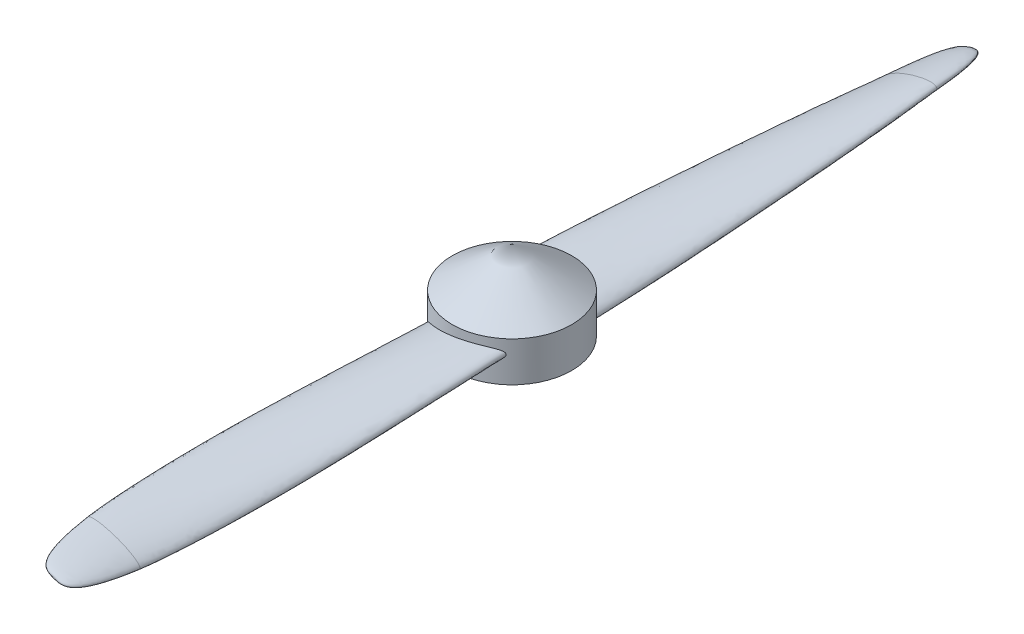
ISO-10303-21;
HEADER;
FILE_DESCRIPTION(('STEP AP214'),'2;1');
FILE_NAME('part.step','',(''),(''),'','','');
FILE_SCHEMA(('AUTOMOTIVE_DESIGN { 1 0 10303 214 1 1 1 1 }'));
ENDSEC;
DATA;
#1=APPLICATION_CONTEXT('core data for automotive mechanical design processes');
#2=APPLICATION_PROTOCOL_DEFINITION('international standard','automotive_design',2000,#1);
#3=PRODUCT_CONTEXT('',#1,'mechanical');
#4=PRODUCT('Part','Part','',(#3));
#5=PRODUCT_RELATED_PRODUCT_CATEGORY('part','',(#4));
#6=PRODUCT_DEFINITION_FORMATION('','',#4);
#7=PRODUCT_DEFINITION_CONTEXT('part definition',#1,'design');
#8=PRODUCT_DEFINITION('design','',#6,#7);
#9=PRODUCT_DEFINITION_SHAPE('','',#8);
#10=(LENGTH_UNIT() NAMED_UNIT(*) SI_UNIT(.MILLI.,.METRE.));
#11=(NAMED_UNIT(*) PLANE_ANGLE_UNIT() SI_UNIT($,.RADIAN.));
#12=(NAMED_UNIT(*) SI_UNIT($,.STERADIAN.) SOLID_ANGLE_UNIT());
#13=UNCERTAINTY_MEASURE_WITH_UNIT(LENGTH_MEASURE(1.E-05),#10,'distance_accuracy_value','');
#14=(GEOMETRIC_REPRESENTATION_CONTEXT(3) GLOBAL_UNCERTAINTY_ASSIGNED_CONTEXT((#13)) GLOBAL_UNIT_ASSIGNED_CONTEXT((#10,
#11,#12)) REPRESENTATION_CONTEXT('',''));
#15=CARTESIAN_POINT('',(0.,0.,0.));
#16=DIRECTION('',(0.,0.,1.));
#17=DIRECTION('',(1.,0.,0.));
#18=AXIS2_PLACEMENT_3D('',#15,#16,#17);
#19=CARTESIAN_POINT('',(0.,5.,0.));
#20=DIRECTION('',(0.,-1.,0.));
#21=DIRECTION('',(0.,0.,-1.));
#22=AXIS2_PLACEMENT_3D('',#19,#20,#21);
#23=CYLINDRICAL_SURFACE('',#22,15.);
#24=CARTESIAN_POINT('',(-9.84159454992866,1.68681693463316,-11.3200272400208));
#25=CARTESIAN_POINT('',(-9.83540785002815,1.72279586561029,-11.3254059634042));
#26=CARTESIAN_POINT('',(-9.82610167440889,1.75785077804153,-11.3334891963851));
#27=CARTESIAN_POINT('',(-9.80234868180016,1.82482682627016,-11.354039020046));
#28=CARTESIAN_POINT('',(-9.78788158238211,1.85673495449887,-11.3665229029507));
#29=CARTESIAN_POINT('',(-9.75070553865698,1.92538805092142,-11.3984424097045));
#30=CARTESIAN_POINT('',(-9.72682363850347,1.96102392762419,-11.41884579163));
#31=CARTESIAN_POINT('',(-9.6752090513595,2.02722689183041,-11.4626123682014));
#32=CARTESIAN_POINT('',(-9.64747113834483,2.05778697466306,-11.485979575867));
#33=CARTESIAN_POINT('',(-9.58902803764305,2.11522060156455,-11.5348175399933));
#34=CARTESIAN_POINT('',(-9.55828405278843,2.14203082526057,-11.5603149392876));
#35=CARTESIAN_POINT('',(-9.49496353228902,2.1922680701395,-11.6123792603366));
#36=CARTESIAN_POINT('',(-9.46238513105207,2.21569155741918,-11.6389472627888));
#37=CARTESIAN_POINT('',(-9.39580142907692,2.25983793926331,-11.6927650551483));
#38=CARTESIAN_POINT('',(-9.36179214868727,2.28055253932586,-11.7200166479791));
#39=CARTESIAN_POINT('',(-9.29275541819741,2.31967004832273,-11.7748307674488));
#40=CARTESIAN_POINT('',(-9.25772844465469,2.33807401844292,-11.8023931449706));
#41=CARTESIAN_POINT('',(-9.18067260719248,2.37603748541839,-11.8624632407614));
#42=CARTESIAN_POINT('',(-9.13848760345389,2.39523911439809,-11.8949954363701));
#43=CARTESIAN_POINT('',(-9.05319657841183,2.43152925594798,-11.9600381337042));
#44=CARTESIAN_POINT('',(-9.01009035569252,2.4486173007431,-11.9925486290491));
#45=CARTESIAN_POINT('',(-8.87947070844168,2.49731857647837,-12.0899461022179));
#46=CARTESIAN_POINT('',(-8.79079525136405,2.52630367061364,-12.1545905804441));
#47=CARTESIAN_POINT('',(-8.61098621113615,2.57920010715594,-12.2826351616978));
#48=CARTESIAN_POINT('',(-8.51985049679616,2.60310688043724,-12.3460340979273));
#49=CARTESIAN_POINT('',(-8.33515911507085,2.64704951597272,-12.471472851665));
#50=CARTESIAN_POINT('',(-8.24159493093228,2.66706879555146,-12.5335058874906));
#51=CARTESIAN_POINT('',(-8.05276462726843,2.70386288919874,-12.6556554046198));
#52=CARTESIAN_POINT('',(-7.95750063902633,2.72064149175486,-12.7157740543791));
#53=CARTESIAN_POINT('',(-7.76534782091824,2.75150874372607,-12.8340211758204));
#54=CARTESIAN_POINT('',(-7.66845930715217,2.76559790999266,-12.8921500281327));
#55=CARTESIAN_POINT('',(-7.41833576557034,2.79874745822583,-13.0383848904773));
#56=CARTESIAN_POINT('',(-7.26400556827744,2.81615790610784,-13.1249986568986));
#57=CARTESIAN_POINT('',(-6.95200861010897,2.84639680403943,-13.292891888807));
#58=CARTESIAN_POINT('',(-6.794341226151,2.85922439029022,-13.3741703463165));
#59=CARTESIAN_POINT('',(-6.47586698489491,2.88096466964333,-13.5312486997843));
#60=CARTESIAN_POINT('',(-6.31505758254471,2.88987403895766,-13.6070438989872));
#61=CARTESIAN_POINT('',(-5.99074232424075,2.90421368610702,-13.7529138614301));
#62=CARTESIAN_POINT('',(-5.82723663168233,2.90964417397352,-13.8229889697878));
#63=CARTESIAN_POINT('',(-5.33361337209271,2.92085187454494,-14.0242142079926));
#64=CARTESIAN_POINT('',(-4.99975155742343,2.92158723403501,-14.1466789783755));
#65=CARTESIAN_POINT('',(-4.49340029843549,2.91328819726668,-14.3122652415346));
#66=CARTESIAN_POINT('',(-4.32370154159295,2.90895543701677,-14.364439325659));
#67=CARTESIAN_POINT('',(-3.98264287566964,2.89725858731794,-14.4627118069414));
#68=CARTESIAN_POINT('',(-3.81128296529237,2.88989449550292,-14.508810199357));
#69=CARTESIAN_POINT('',(-3.46255502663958,2.8720790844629,-14.5960227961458));
#70=CARTESIAN_POINT('',(-3.28514922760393,2.86155017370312,-14.6369699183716));
#71=CARTESIAN_POINT('',(-2.92915001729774,2.83775981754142,-14.7123483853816));
#72=CARTESIAN_POINT('',(-2.7505565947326,2.82449834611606,-14.7467796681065));
#73=CARTESIAN_POINT('',(-2.21334320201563,2.78087096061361,-14.8402557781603));
#74=CARTESIAN_POINT('',(-1.85326989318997,2.74666100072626,-14.8894879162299));
#75=CARTESIAN_POINT('',(-1.13145316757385,2.66873913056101,-14.9616666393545));
#76=CARTESIAN_POINT('',(-0.769709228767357,2.62502402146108,-14.9846043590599));
#77=CARTESIAN_POINT('',(-0.0467415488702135,2.52821691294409,-15.004283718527));
#78=CARTESIAN_POINT('',(0.314482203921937,2.47512512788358,-15.0010259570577));
#79=CARTESIAN_POINT('',(0.936234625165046,2.37504637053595,-14.973050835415));
#80=CARTESIAN_POINT('',(1.19742258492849,2.33032801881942,-14.9544127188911));
#81=CARTESIAN_POINT('',(1.71752371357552,2.23543898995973,-14.9036362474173));
#82=CARTESIAN_POINT('',(1.97643667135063,2.18526781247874,-14.8714966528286));
#83=CARTESIAN_POINT('',(2.49113018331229,2.07931532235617,-14.7939857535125));
#84=CARTESIAN_POINT('',(2.74691050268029,2.02353359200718,-14.7486134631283));
#85=CARTESIAN_POINT('',(3.25474750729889,1.90637973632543,-14.6449249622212));
#86=CARTESIAN_POINT('',(3.50680123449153,1.84500342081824,-14.5865990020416));
#87=CARTESIAN_POINT('',(4.00620579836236,1.7166530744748,-14.4574145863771));
#88=CARTESIAN_POINT('',(4.2535569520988,1.64967942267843,-14.3865569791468));
#89=CARTESIAN_POINT('',(4.74277368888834,1.51003212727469,-14.2327727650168));
#90=CARTESIAN_POINT('',(4.9846405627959,1.43735984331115,-14.1498490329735));
#91=CARTESIAN_POINT('',(5.42391646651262,1.2981857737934,-13.9866682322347));
#92=CARTESIAN_POINT('',(5.62223871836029,1.23256139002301,-13.9081133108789));
#93=CARTESIAN_POINT('',(6.01407327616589,1.09685072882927,-13.743220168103));
#94=CARTESIAN_POINT('',(6.20758546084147,1.02676433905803,-13.6568817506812));
#95=CARTESIAN_POINT('',(6.58939490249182,0.881706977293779,-13.4768112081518));
#96=CARTESIAN_POINT('',(6.77768963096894,0.806733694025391,-13.3830755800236));
#97=CARTESIAN_POINT('',(7.1480417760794,0.651326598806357,-13.1889775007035));
#98=CARTESIAN_POINT('',(7.33010965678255,0.570902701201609,-13.0886270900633));
#99=CARTESIAN_POINT('',(7.68750388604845,0.403192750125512,-12.8819578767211));
#100=CARTESIAN_POINT('',(7.86283297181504,0.315909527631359,-12.7756415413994));
#101=CARTESIAN_POINT('',(8.11987668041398,0.17835677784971,-12.6126090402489));
#102=CARTESIAN_POINT('',(8.2045328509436,0.131421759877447,-12.5576950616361));
#103=CARTESIAN_POINT('',(8.37168767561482,0.0349518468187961,-12.4468827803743));
#104=CARTESIAN_POINT('',(8.45418654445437,-0.0145827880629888,-12.3909845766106));
#105=CARTESIAN_POINT('',(8.60464861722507,-0.109102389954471,-12.2868670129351));
#106=CARTESIAN_POINT('',(8.6729449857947,-0.153664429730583,-12.2387454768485));
#107=CARTESIAN_POINT('',(8.80759763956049,-0.245356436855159,-12.1422026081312));
#108=CARTESIAN_POINT('',(8.8739537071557,-0.292486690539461,-12.0937812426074));
#109=CARTESIAN_POINT('',(9.00422823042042,-0.389653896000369,-11.9971010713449));
#110=CARTESIAN_POINT('',(9.06815321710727,-0.439681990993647,-11.9488422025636));
#111=CARTESIAN_POINT('',(9.19329808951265,-0.543446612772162,-11.8528257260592));
#112=CARTESIAN_POINT('',(9.25451896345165,-0.59718176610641,-11.8050679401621));
#113=CARTESIAN_POINT('',(9.36156564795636,-0.698192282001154,-11.7202720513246));
#114=CARTESIAN_POINT('',(9.40801878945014,-0.744605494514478,-11.6830029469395));
#115=CARTESIAN_POINT('',(9.49817372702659,-0.84149046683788,-11.6098260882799));
#116=CARTESIAN_POINT('',(9.541866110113,-0.891974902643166,-11.5739231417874));
#117=CARTESIAN_POINT('',(9.60445044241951,-0.971872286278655,-11.5219479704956));
#118=CARTESIAN_POINT('',(9.62492733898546,-0.999368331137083,-11.5048443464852));
#119=CARTESIAN_POINT('',(9.66449835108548,-1.05589883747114,-11.4716231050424));
#120=CARTESIAN_POINT('',(9.68359296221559,-1.08493274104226,-11.4555051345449));
#121=CARTESIAN_POINT('',(9.71990799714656,-1.14466446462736,-11.4247079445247));
#122=CARTESIAN_POINT('',(9.73713780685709,-1.17535266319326,-11.4100215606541));
#123=CARTESIAN_POINT('',(9.76920998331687,-1.2387432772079,-11.3825736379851));
#124=CARTESIAN_POINT('',(9.78405195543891,-1.27144602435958,-11.3698124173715));
#125=CARTESIAN_POINT('',(9.8187329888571,-1.36047474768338,-11.3398977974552));
#126=CARTESIAN_POINT('',(9.83593328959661,-1.41883608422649,-11.324953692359));
#127=CARTESIAN_POINT('',(9.85058530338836,-1.51009674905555,-11.3122064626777));
#128=CARTESIAN_POINT('',(9.85359002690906,-1.54139304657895,-11.3095871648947));
#129=CARTESIAN_POINT('',(9.85490758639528,-1.60415037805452,-11.3084393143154));
#130=CARTESIAN_POINT('',(9.85323176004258,-1.63561082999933,-11.3099008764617));
#131=CARTESIAN_POINT('',(9.84545707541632,-1.69355637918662,-11.3166688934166));
#132=CARTESIAN_POINT('',(9.83992619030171,-1.72017828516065,-11.321481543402));
#133=CARTESIAN_POINT('',(9.82550258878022,-1.77179088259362,-11.3340014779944));
#134=CARTESIAN_POINT('',(9.81660447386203,-1.79677887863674,-11.3417134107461));
#135=CARTESIAN_POINT('',(9.79215137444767,-1.85407756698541,-11.3628394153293));
#136=CARTESIAN_POINT('',(9.77535329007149,-1.88545783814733,-11.3773046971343));
#137=CARTESIAN_POINT('',(9.73824854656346,-1.94445881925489,-11.409080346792));
#138=CARTESIAN_POINT('',(9.71793316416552,-1.97206986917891,-11.4263977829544));
#139=CARTESIAN_POINT('',(9.67594209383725,-2.02284180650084,-11.461974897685));
#140=CARTESIAN_POINT('',(9.65437204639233,-2.04614902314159,-11.480154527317));
#141=CARTESIAN_POINT('',(9.6096890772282,-2.09032025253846,-11.517583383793));
#142=CARTESIAN_POINT('',(9.58657466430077,-2.11118184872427,-11.5368336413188));
#143=CARTESIAN_POINT('',(9.53915654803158,-2.15091253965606,-11.5760719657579));
#144=CARTESIAN_POINT('',(9.51484988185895,-2.16977625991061,-11.5960618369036));
#145=CARTESIAN_POINT('',(9.46537355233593,-2.20577337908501,-11.6364825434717));
#146=CARTESIAN_POINT('',(9.44020426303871,-2.22290751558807,-11.6569131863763));
#147=CARTESIAN_POINT('',(9.35857194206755,-2.27541887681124,-11.7227262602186));
#148=CARTESIAN_POINT('',(9.30077302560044,-2.30803600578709,-11.7686531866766));
#149=CARTESIAN_POINT('',(9.1828250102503,-2.36827888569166,-11.8609173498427));
#150=CARTESIAN_POINT('',(9.12267166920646,-2.39589507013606,-11.9072551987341));
#151=CARTESIAN_POINT('',(9.00057054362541,-2.4472627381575,-11.9998168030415));
#152=CARTESIAN_POINT('',(8.93862120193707,-2.47101074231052,-12.0460404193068));
#153=CARTESIAN_POINT('',(8.81303019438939,-2.51548320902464,-12.1382287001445));
#154=CARTESIAN_POINT('',(8.74938242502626,-2.53619430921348,-12.184191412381));
#155=CARTESIAN_POINT('',(8.62092177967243,-2.57498834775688,-12.2754188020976));
#156=CARTESIAN_POINT('',(8.5561103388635,-2.593074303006,-12.3206842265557));
#157=CARTESIAN_POINT('',(8.4254061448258,-2.62702438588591,-12.410431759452));
#158=CARTESIAN_POINT('',(8.35951369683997,-2.64288912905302,-12.4549140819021));
#159=CARTESIAN_POINT('',(8.17989945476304,-2.68319807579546,-12.5740883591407));
#160=CARTESIAN_POINT('',(8.06521831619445,-2.70580252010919,-12.647961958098));
#161=CARTESIAN_POINT('',(7.83328275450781,-2.74642059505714,-12.7929040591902));
#162=CARTESIAN_POINT('',(7.71602776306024,-2.76443320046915,-12.863971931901));
#163=CARTESIAN_POINT('',(7.47911637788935,-2.7966865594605,-13.0031422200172));
#164=CARTESIAN_POINT('',(7.35945786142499,-2.81092380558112,-13.0712418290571));
#165=CARTESIAN_POINT('',(7.11804600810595,-2.83618733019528,-13.2042578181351));
#166=CARTESIAN_POINT('',(6.99629246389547,-2.8472132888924,-13.2691738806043));
#167=CARTESIAN_POINT('',(6.62854362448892,-2.8761422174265,-13.4587653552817));
#168=CARTESIAN_POINT('',(6.37966012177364,-2.88994718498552,-13.578519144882));
#169=CARTESIAN_POINT('',(5.87552565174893,-2.90909794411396,-13.8041473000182));
#170=CARTESIAN_POINT('',(5.62027700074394,-2.91444676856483,-13.9100266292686));
#171=CARTESIAN_POINT('',(5.05790894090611,-2.91810663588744,-14.1252867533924));
#172=CARTESIAN_POINT('',(4.7497078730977,-2.91498093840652,-14.2318802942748));
#173=CARTESIAN_POINT('',(4.12719101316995,-2.89953046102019,-14.4247187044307));
#174=CARTESIAN_POINT('',(3.81287416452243,-2.88720407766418,-14.5109600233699));
#175=CARTESIAN_POINT('',(3.17967462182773,-2.8538376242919,-14.6627312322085));
#176=CARTESIAN_POINT('',(2.86079102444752,-2.83279580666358,-14.7282569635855));
#177=CARTESIAN_POINT('',(2.22007023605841,-2.78221048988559,-14.8383601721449));
#178=CARTESIAN_POINT('',(1.89823299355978,-2.75266684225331,-14.8829372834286));
#179=CARTESIAN_POINT('',(1.38338820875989,-2.69874160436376,-14.9373250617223));
#180=CARTESIAN_POINT('',(1.19078249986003,-2.67708513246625,-14.9539064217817));
#181=CARTESIAN_POINT('',(0.805433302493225,-2.63076388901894,-14.9796052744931));
#182=CARTESIAN_POINT('',(0.612689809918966,-2.6060990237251,-14.9887225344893));
#183=CARTESIAN_POINT('',(0.0346839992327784,-2.52783701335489,-15.0049096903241));
#184=CARTESIAN_POINT('',(-0.350379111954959,-2.46996976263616,-15.0008176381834));
#185=CARTESIAN_POINT('',(-1.11766187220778,-2.3434529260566,-14.963241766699));
#186=CARTESIAN_POINT('',(-1.49987781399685,-2.27479122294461,-14.9297247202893));
#187=CARTESIAN_POINT('',(-2.25862879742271,-2.12678373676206,-14.8339045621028));
#188=CARTESIAN_POINT('',(-2.6351640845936,-2.04743841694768,-14.7716026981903));
#189=CARTESIAN_POINT('',(-3.20115773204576,-1.91830573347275,-14.6557741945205));
#190=CARTESIAN_POINT('',(-3.39368954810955,-1.87260362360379,-14.6123809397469));
#191=CARTESIAN_POINT('',(-3.7761644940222,-1.77798612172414,-14.5182420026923));
#192=CARTESIAN_POINT('',(-3.96610760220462,-1.72907070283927,-14.4674962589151));
#193=CARTESIAN_POINT('',(-4.3430295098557,-1.6277535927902,-14.3588500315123));
#194=CARTESIAN_POINT('',(-4.53000779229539,-1.57535130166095,-14.3009483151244));
#195=CARTESIAN_POINT('',(-4.90057023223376,-1.46677428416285,-14.1782405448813));
#196=CARTESIAN_POINT('',(-5.08415445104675,-1.4105996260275,-14.1134346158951));
#197=CARTESIAN_POINT('',(-5.4471739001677,-1.29450249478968,-13.9773311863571));
#198=CARTESIAN_POINT('',(-5.62661764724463,-1.23458887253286,-13.906048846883));
#199=CARTESIAN_POINT('',(-5.98146194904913,-1.11075680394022,-13.757148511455));
#200=CARTESIAN_POINT('',(-6.15686229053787,-1.0468381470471,-13.6795301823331));
#201=CARTESIAN_POINT('',(-6.50319769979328,-0.914914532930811,-13.5183168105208));
#202=CARTESIAN_POINT('',(-6.6741350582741,-0.846911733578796,-13.4347249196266));
#203=CARTESIAN_POINT('',(-7.01130246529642,-0.706628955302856,-13.2618816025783));
#204=CARTESIAN_POINT('',(-7.17753326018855,-0.634349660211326,-13.172631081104));
#205=CARTESIAN_POINT('',(-7.42386283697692,-0.521801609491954,-13.0343876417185));
#206=CARTESIAN_POINT('',(-7.5058963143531,-0.48338271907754,-12.9873173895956));
#207=CARTESIAN_POINT('',(-7.66855601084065,-0.405155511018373,-12.8919406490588));
#208=CARTESIAN_POINT('',(-7.74918241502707,-0.365347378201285,-12.8436343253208));
#209=CARTESIAN_POINT('',(-7.90892954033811,-0.284195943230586,-12.7458855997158));
#210=CARTESIAN_POINT('',(-7.98805062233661,-0.24285301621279,-12.6964434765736));
#211=CARTESIAN_POINT('',(-8.14469760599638,-0.158424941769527,-12.5965285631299));
#212=CARTESIAN_POINT('',(-8.22222350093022,-0.115339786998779,-12.5460557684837));
#213=CARTESIAN_POINT('',(-8.40539079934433,-0.0100082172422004,-12.4244012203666));
#214=CARTESIAN_POINT('',(-8.5102276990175,0.0531677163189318,-12.3528071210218));
#215=CARTESIAN_POINT('',(-8.71596883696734,0.184309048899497,-12.208507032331));
#216=CARTESIAN_POINT('',(-8.81687577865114,0.252271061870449,-12.135801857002));
#217=CARTESIAN_POINT('',(-8.98414243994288,0.373146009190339,-12.0121816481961));
#218=CARTESIAN_POINT('',(-9.05173232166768,0.424405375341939,-11.9613169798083));
#219=CARTESIAN_POINT('',(-9.18418005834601,0.531062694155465,-11.8599235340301));
#220=CARTESIAN_POINT('',(-9.24903233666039,0.586468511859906,-11.809395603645));
#221=CARTESIAN_POINT('',(-9.34584043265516,0.675904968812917,-11.7327381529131));
#222=CARTESIAN_POINT('',(-9.37917413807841,0.708009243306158,-11.7061032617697));
#223=CARTESIAN_POINT('',(-9.44447014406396,0.774139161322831,-11.6534861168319));
#224=CARTESIAN_POINT('',(-9.47643193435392,0.808165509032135,-11.6275041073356));
#225=CARTESIAN_POINT('',(-9.53847223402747,0.878438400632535,-11.5766640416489));
#226=CARTESIAN_POINT('',(-9.56855676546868,0.914677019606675,-11.5518024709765));
#227=CARTESIAN_POINT('',(-9.62635429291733,0.989973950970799,-11.5036825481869));
#228=CARTESIAN_POINT('',(-9.65406958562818,1.02902946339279,-11.4804226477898));
#229=CARTESIAN_POINT('',(-9.70098102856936,1.1023742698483,-11.4407915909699));
#230=CARTESIAN_POINT('',(-9.72076866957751,1.13603898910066,-11.423976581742));
#231=CARTESIAN_POINT('',(-9.75754270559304,1.20599054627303,-11.3925828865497));
#232=CARTESIAN_POINT('',(-9.77452408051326,1.24228191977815,-11.3780082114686));
#233=CARTESIAN_POINT('',(-9.80471772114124,1.31824870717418,-11.3520003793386));
#234=CARTESIAN_POINT('',(-9.81786916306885,1.35796696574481,-11.3406180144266));
#235=CARTESIAN_POINT('',(-9.83821383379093,1.43997106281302,-11.3229739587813));
#236=CARTESIAN_POINT('',(-9.84543467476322,1.48224400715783,-11.3166885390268));
#237=CARTESIAN_POINT('',(-9.85082065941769,1.55204905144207,-11.3119997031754));
#238=CARTESIAN_POINT('',(-9.85134495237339,1.57926108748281,-11.3115429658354));
#239=CARTESIAN_POINT('',(-9.84900463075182,1.63342071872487,-11.3135808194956));
#240=CARTESIAN_POINT('',(-9.84614245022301,1.66036848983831,-11.3160732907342));
#241=CARTESIAN_POINT('',(-9.84159454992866,1.68681693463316,-11.3200272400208));
#242=B_SPLINE_CURVE_WITH_KNOTS('',3,(#24,#25,#26,#27,#28,#29,#30,#31,#32,#33,#34,#35,#36,#37,
#38,#39,#40,#41,#42,#43,#44,#45,#46,#47,#48,#49,#50,#51,#52,#53,#54,#55,#56,#57,#58,#59,#60,#61,
#62,#63,#64,#65,#66,#67,#68,#69,#70,#71,#72,#73,#74,#75,#76,#77,#78,#79,#80,#81,#82,#83,#84,#85,
#86,#87,#88,#89,#90,#91,#92,#93,#94,#95,#96,#97,#98,#99,#100,#101,#102,#103,#104,#105,#106,#107,
#108,#109,#110,#111,#112,#113,#114,#115,#116,#117,#118,#119,#120,#121,#122,#123,#124,#125,#126,
#127,#128,#129,#130,#131,#132,#133,#134,#135,#136,#137,#138,#139,#140,#141,#142,#143,#144,#145,
#146,#147,#148,#149,#150,#151,#152,#153,#154,#155,#156,#157,#158,#159,#160,#161,#162,#163,#164,
#165,#166,#167,#168,#169,#170,#171,#172,#173,#174,#175,#176,#177,#178,#179,#180,#181,#182,#183,
#184,#185,#186,#187,#188,#189,#190,#191,#192,#193,#194,#195,#196,#197,#198,#199,#200,#201,#202,
#203,#204,#205,#206,#207,#208,#209,#210,#211,#212,#213,#214,#215,#216,#217,#218,#219,#220,#221,
#222,#223,#224,#225,#226,#227,#228,#229,#230,#231,#232,#233,#234,#235,#236,#237,#238,#239,#240,
#241),.UNSPECIFIED.,.T.,.F.,(4,2,2,2,2,2,2,2,2,2,2,2,2,2,2,2,2,2,2,2,2,2,2,2,2,2,2,2,2,2,2,2,2,
2,2,2,2,2,2,2,2,2,2,2,2,2,2,2,2,2,2,2,2,2,2,2,2,2,2,2,2,2,2,2,2,2,2,2,2,2,2,2,2,2,2,2,2,2,2,2,2,
2,2,2,2,2,2,2,2,2,2,2,2,2,2,2,2,2,2,2,2,2,2,2,2,2,2,2,4),(0.,0.110549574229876,
0.221538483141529,0.363276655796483,0.505208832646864,0.64930527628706,0.793551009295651,
0.938228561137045,1.08283942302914,1.25266020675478,1.42251850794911,1.76279774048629,
2.10338184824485,2.44538830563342,2.78699249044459,3.12853096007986,3.66181833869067,
4.19520618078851,4.72904562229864,5.26285283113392,6.32833509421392,6.86100569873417,
7.39367671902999,7.94065162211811,8.48763173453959,9.58152954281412,10.6757960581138,
11.7700375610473,12.5665883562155,13.3632123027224,14.1598956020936,14.9571805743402,
15.7544115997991,16.5514529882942,17.2207687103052,17.8901012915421,18.5597527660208,
19.2282172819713,19.8964073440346,20.2302293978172,20.5640181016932,20.8480360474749,
21.1320857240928,21.4153088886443,21.6984276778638,21.9248342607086,22.1519752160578,
22.2668596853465,22.3817027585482,22.4959379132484,22.6101919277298,22.7955528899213,
22.8896979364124,22.9836151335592,23.0660079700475,23.1485334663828,23.2631459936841,
23.3780469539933,23.4876596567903,23.5973797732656,23.7073879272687,23.8173489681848,
24.0591605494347,24.3014299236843,24.5439160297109,24.7874389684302,25.030679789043,
25.2738530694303,25.6885182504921,26.1032759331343,26.5184176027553,26.9336006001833,
27.7625693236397,28.5912406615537,29.5687619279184,30.5464535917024,31.5243413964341,
32.5022462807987,33.0856743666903,33.6691206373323,34.8359361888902,36.0040710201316,
37.1721552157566,37.7797617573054,38.3873733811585,38.9950898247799,39.6027952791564,
40.209113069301,40.8154627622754,41.4214948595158,42.0274303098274,42.3336600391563,
42.6398491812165,42.9459639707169,43.25208005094,43.6773716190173,44.1023652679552,
44.3990111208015,44.6962346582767,44.8563839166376,45.0165922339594,45.1762569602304,
45.3357651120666,45.463143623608,45.5907475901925,45.7202795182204,45.849204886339,
45.9305293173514,46.0117953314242),.UNSPECIFIED.);
#243=CARTESIAN_POINT('',(-9.84159454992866,1.68681693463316,-11.3200272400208));
#244=VERTEX_POINT('',#243);
#245=EDGE_CURVE('E197',#244,#244,#242,.T.);
#246=ORIENTED_EDGE('',*,*,#245,.F.);
#247=EDGE_LOOP('',(#246));
#248=FACE_BOUND('',#247,.T.);
#249=CARTESIAN_POINT('',(9.84159454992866,1.68681693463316,11.3200272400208));
#250=CARTESIAN_POINT('',(9.83540785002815,1.72279586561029,11.3254059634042));
#251=CARTESIAN_POINT('',(9.82610167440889,1.75785077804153,11.3334891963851));
#252=CARTESIAN_POINT('',(9.80234868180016,1.82482682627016,11.354039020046));
#253=CARTESIAN_POINT('',(9.78788158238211,1.85673495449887,11.3665229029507));
#254=CARTESIAN_POINT('',(9.75070553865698,1.92538805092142,11.3984424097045));
#255=CARTESIAN_POINT('',(9.72682363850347,1.96102392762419,11.41884579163));
#256=CARTESIAN_POINT('',(9.6752090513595,2.02722689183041,11.4626123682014));
#257=CARTESIAN_POINT('',(9.64747113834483,2.05778697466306,11.485979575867));
#258=CARTESIAN_POINT('',(9.58902803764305,2.11522060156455,11.5348175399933));
#259=CARTESIAN_POINT('',(9.55828405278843,2.14203082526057,11.5603149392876));
#260=CARTESIAN_POINT('',(9.49496353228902,2.1922680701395,11.6123792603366));
#261=CARTESIAN_POINT('',(9.46238513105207,2.21569155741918,11.6389472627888));
#262=CARTESIAN_POINT('',(9.39580142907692,2.25983793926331,11.6927650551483));
#263=CARTESIAN_POINT('',(9.36179214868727,2.28055253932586,11.7200166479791));
#264=CARTESIAN_POINT('',(9.29275541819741,2.31967004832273,11.7748307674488));
#265=CARTESIAN_POINT('',(9.25772844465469,2.33807401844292,11.8023931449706));
#266=CARTESIAN_POINT('',(9.18067260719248,2.37603748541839,11.8624632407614));
#267=CARTESIAN_POINT('',(9.13848760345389,2.39523911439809,11.8949954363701));
#268=CARTESIAN_POINT('',(9.05319657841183,2.43152925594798,11.9600381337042));
#269=CARTESIAN_POINT('',(9.01009035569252,2.4486173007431,11.9925486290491));
#270=CARTESIAN_POINT('',(8.87947070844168,2.49731857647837,12.0899461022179));
#271=CARTESIAN_POINT('',(8.79079525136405,2.52630367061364,12.1545905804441));
#272=CARTESIAN_POINT('',(8.61098621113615,2.57920010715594,12.2826351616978));
#273=CARTESIAN_POINT('',(8.51985049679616,2.60310688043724,12.3460340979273));
#274=CARTESIAN_POINT('',(8.33515911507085,2.64704951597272,12.471472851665));
#275=CARTESIAN_POINT('',(8.24159493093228,2.66706879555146,12.5335058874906));
#276=CARTESIAN_POINT('',(8.05276462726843,2.70386288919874,12.6556554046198));
#277=CARTESIAN_POINT('',(7.95750063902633,2.72064149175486,12.7157740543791));
#278=CARTESIAN_POINT('',(7.76534782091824,2.75150874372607,12.8340211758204));
#279=CARTESIAN_POINT('',(7.66845930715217,2.76559790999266,12.8921500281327));
#280=CARTESIAN_POINT('',(7.41833576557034,2.79874745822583,13.0383848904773));
#281=CARTESIAN_POINT('',(7.26400556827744,2.81615790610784,13.1249986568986));
#282=CARTESIAN_POINT('',(6.95200861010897,2.84639680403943,13.292891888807));
#283=CARTESIAN_POINT('',(6.794341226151,2.85922439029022,13.3741703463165));
#284=CARTESIAN_POINT('',(6.47586698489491,2.88096466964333,13.5312486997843));
#285=CARTESIAN_POINT('',(6.31505758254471,2.88987403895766,13.6070438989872));
#286=CARTESIAN_POINT('',(5.99074232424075,2.90421368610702,13.7529138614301));
#287=CARTESIAN_POINT('',(5.82723663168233,2.90964417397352,13.8229889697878));
#288=CARTESIAN_POINT('',(5.33361337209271,2.92085187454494,14.0242142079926));
#289=CARTESIAN_POINT('',(4.99975155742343,2.92158723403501,14.1466789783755));
#290=CARTESIAN_POINT('',(4.49340029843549,2.91328819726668,14.3122652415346));
#291=CARTESIAN_POINT('',(4.32370154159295,2.90895543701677,14.364439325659));
#292=CARTESIAN_POINT('',(3.98264287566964,2.89725858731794,14.4627118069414));
#293=CARTESIAN_POINT('',(3.81128296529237,2.88989449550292,14.508810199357));
#294=CARTESIAN_POINT('',(3.46255502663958,2.8720790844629,14.5960227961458));
#295=CARTESIAN_POINT('',(3.28514922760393,2.86155017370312,14.6369699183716));
#296=CARTESIAN_POINT('',(2.92915001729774,2.83775981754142,14.7123483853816));
#297=CARTESIAN_POINT('',(2.7505565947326,2.82449834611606,14.7467796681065));
#298=CARTESIAN_POINT('',(2.21334320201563,2.78087096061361,14.8402557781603));
#299=CARTESIAN_POINT('',(1.85326989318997,2.74666100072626,14.8894879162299));
#300=CARTESIAN_POINT('',(1.13145316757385,2.66873913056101,14.9616666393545));
#301=CARTESIAN_POINT('',(0.769709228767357,2.62502402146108,14.9846043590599));
#302=CARTESIAN_POINT('',(0.0467415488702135,2.52821691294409,15.004283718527));
#303=CARTESIAN_POINT('',(-0.314482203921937,2.47512512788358,15.0010259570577));
#304=CARTESIAN_POINT('',(-0.936234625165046,2.37504637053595,14.973050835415));
#305=CARTESIAN_POINT('',(-1.19742258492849,2.33032801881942,14.9544127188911));
#306=CARTESIAN_POINT('',(-1.71752371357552,2.23543898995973,14.9036362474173));
#307=CARTESIAN_POINT('',(-1.97643667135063,2.18526781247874,14.8714966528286));
#308=CARTESIAN_POINT('',(-2.49113018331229,2.07931532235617,14.7939857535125));
#309=CARTESIAN_POINT('',(-2.74691050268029,2.02353359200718,14.7486134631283));
#310=CARTESIAN_POINT('',(-3.25474750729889,1.90637973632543,14.6449249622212));
#311=CARTESIAN_POINT('',(-3.50680123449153,1.84500342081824,14.5865990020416));
#312=CARTESIAN_POINT('',(-4.00620579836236,1.7166530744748,14.4574145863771));
#313=CARTESIAN_POINT('',(-4.2535569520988,1.64967942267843,14.3865569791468));
#314=CARTESIAN_POINT('',(-4.74277368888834,1.51003212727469,14.2327727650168));
#315=CARTESIAN_POINT('',(-4.9846405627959,1.43735984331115,14.1498490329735));
#316=CARTESIAN_POINT('',(-5.42391646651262,1.2981857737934,13.9866682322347));
#317=CARTESIAN_POINT('',(-5.62223871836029,1.23256139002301,13.9081133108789));
#318=CARTESIAN_POINT('',(-6.01407327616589,1.09685072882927,13.743220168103));
#319=CARTESIAN_POINT('',(-6.20758546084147,1.02676433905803,13.6568817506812));
#320=CARTESIAN_POINT('',(-6.58939490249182,0.881706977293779,13.4768112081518));
#321=CARTESIAN_POINT('',(-6.77768963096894,0.806733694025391,13.3830755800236));
#322=CARTESIAN_POINT('',(-7.1480417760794,0.651326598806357,13.1889775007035));
#323=CARTESIAN_POINT('',(-7.33010965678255,0.570902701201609,13.0886270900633));
#324=CARTESIAN_POINT('',(-7.68750388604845,0.403192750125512,12.8819578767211));
#325=CARTESIAN_POINT('',(-7.86283297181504,0.315909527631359,12.7756415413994));
#326=CARTESIAN_POINT('',(-8.11987668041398,0.17835677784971,12.6126090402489));
#327=CARTESIAN_POINT('',(-8.2045328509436,0.131421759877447,12.5576950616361));
#328=CARTESIAN_POINT('',(-8.37168767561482,0.0349518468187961,12.4468827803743));
#329=CARTESIAN_POINT('',(-8.45418654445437,-0.0145827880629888,12.3909845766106));
#330=CARTESIAN_POINT('',(-8.60464861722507,-0.109102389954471,12.2868670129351));
#331=CARTESIAN_POINT('',(-8.6729449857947,-0.153664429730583,12.2387454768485));
#332=CARTESIAN_POINT('',(-8.80759763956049,-0.245356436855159,12.1422026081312));
#333=CARTESIAN_POINT('',(-8.8739537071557,-0.292486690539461,12.0937812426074));
#334=CARTESIAN_POINT('',(-9.00422823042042,-0.389653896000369,11.9971010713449));
#335=CARTESIAN_POINT('',(-9.06815321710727,-0.439681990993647,11.9488422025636));
#336=CARTESIAN_POINT('',(-9.19329808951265,-0.543446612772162,11.8528257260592));
#337=CARTESIAN_POINT('',(-9.25451896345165,-0.59718176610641,11.8050679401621));
#338=CARTESIAN_POINT('',(-9.36156564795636,-0.698192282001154,11.7202720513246));
#339=CARTESIAN_POINT('',(-9.40801878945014,-0.744605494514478,11.6830029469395));
#340=CARTESIAN_POINT('',(-9.49817372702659,-0.84149046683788,11.6098260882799));
#341=CARTESIAN_POINT('',(-9.541866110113,-0.891974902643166,11.5739231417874));
#342=CARTESIAN_POINT('',(-9.60445044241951,-0.971872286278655,11.5219479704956));
#343=CARTESIAN_POINT('',(-9.62492733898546,-0.999368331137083,11.5048443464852));
#344=CARTESIAN_POINT('',(-9.66449835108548,-1.05589883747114,11.4716231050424));
#345=CARTESIAN_POINT('',(-9.68359296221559,-1.08493274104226,11.4555051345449));
#346=CARTESIAN_POINT('',(-9.71990799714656,-1.14466446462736,11.4247079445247));
#347=CARTESIAN_POINT('',(-9.73713780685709,-1.17535266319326,11.4100215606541));
#348=CARTESIAN_POINT('',(-9.76920998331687,-1.2387432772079,11.3825736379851));
#349=CARTESIAN_POINT('',(-9.78405195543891,-1.27144602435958,11.3698124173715));
#350=CARTESIAN_POINT('',(-9.8187329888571,-1.36047474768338,11.3398977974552));
#351=CARTESIAN_POINT('',(-9.83593328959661,-1.41883608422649,11.324953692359));
#352=CARTESIAN_POINT('',(-9.85058530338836,-1.51009674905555,11.3122064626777));
#353=CARTESIAN_POINT('',(-9.85359002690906,-1.54139304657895,11.3095871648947));
#354=CARTESIAN_POINT('',(-9.85490758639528,-1.60415037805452,11.3084393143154));
#355=CARTESIAN_POINT('',(-9.85323176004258,-1.63561082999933,11.3099008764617));
#356=CARTESIAN_POINT('',(-9.84545707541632,-1.69355637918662,11.3166688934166));
#357=CARTESIAN_POINT('',(-9.83992619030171,-1.72017828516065,11.321481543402));
#358=CARTESIAN_POINT('',(-9.82550258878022,-1.77179088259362,11.3340014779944));
#359=CARTESIAN_POINT('',(-9.81660447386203,-1.79677887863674,11.3417134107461));
#360=CARTESIAN_POINT('',(-9.79215137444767,-1.85407756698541,11.3628394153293));
#361=CARTESIAN_POINT('',(-9.77535329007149,-1.88545783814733,11.3773046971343));
#362=CARTESIAN_POINT('',(-9.73824854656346,-1.94445881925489,11.409080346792));
#363=CARTESIAN_POINT('',(-9.71793316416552,-1.97206986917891,11.4263977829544));
#364=CARTESIAN_POINT('',(-9.67594209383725,-2.02284180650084,11.461974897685));
#365=CARTESIAN_POINT('',(-9.65437204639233,-2.04614902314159,11.480154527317));
#366=CARTESIAN_POINT('',(-9.6096890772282,-2.09032025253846,11.517583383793));
#367=CARTESIAN_POINT('',(-9.58657466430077,-2.11118184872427,11.5368336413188));
#368=CARTESIAN_POINT('',(-9.53915654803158,-2.15091253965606,11.5760719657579));
#369=CARTESIAN_POINT('',(-9.51484988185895,-2.16977625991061,11.5960618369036));
#370=CARTESIAN_POINT('',(-9.46537355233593,-2.20577337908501,11.6364825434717));
#371=CARTESIAN_POINT('',(-9.44020426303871,-2.22290751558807,11.6569131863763));
#372=CARTESIAN_POINT('',(-9.35857194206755,-2.27541887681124,11.7227262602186));
#373=CARTESIAN_POINT('',(-9.30077302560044,-2.30803600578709,11.7686531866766));
#374=CARTESIAN_POINT('',(-9.1828250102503,-2.36827888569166,11.8609173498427));
#375=CARTESIAN_POINT('',(-9.12267166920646,-2.39589507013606,11.9072551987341));
#376=CARTESIAN_POINT('',(-9.00057054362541,-2.4472627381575,11.9998168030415));
#377=CARTESIAN_POINT('',(-8.93862120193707,-2.47101074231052,12.0460404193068));
#378=CARTESIAN_POINT('',(-8.81303019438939,-2.51548320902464,12.1382287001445));
#379=CARTESIAN_POINT('',(-8.74938242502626,-2.53619430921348,12.184191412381));
#380=CARTESIAN_POINT('',(-8.62092177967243,-2.57498834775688,12.2754188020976));
#381=CARTESIAN_POINT('',(-8.5561103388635,-2.593074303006,12.3206842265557));
#382=CARTESIAN_POINT('',(-8.4254061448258,-2.62702438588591,12.410431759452));
#383=CARTESIAN_POINT('',(-8.35951369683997,-2.64288912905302,12.4549140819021));
#384=CARTESIAN_POINT('',(-8.17989945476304,-2.68319807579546,12.5740883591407));
#385=CARTESIAN_POINT('',(-8.06521831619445,-2.70580252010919,12.647961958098));
#386=CARTESIAN_POINT('',(-7.83328275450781,-2.74642059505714,12.7929040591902));
#387=CARTESIAN_POINT('',(-7.71602776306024,-2.76443320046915,12.863971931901));
#388=CARTESIAN_POINT('',(-7.47911637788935,-2.7966865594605,13.0031422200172));
#389=CARTESIAN_POINT('',(-7.35945786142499,-2.81092380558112,13.0712418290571));
#390=CARTESIAN_POINT('',(-7.11804600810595,-2.83618733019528,13.2042578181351));
#391=CARTESIAN_POINT('',(-6.99629246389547,-2.8472132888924,13.2691738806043));
#392=CARTESIAN_POINT('',(-6.62854362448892,-2.8761422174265,13.4587653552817));
#393=CARTESIAN_POINT('',(-6.37966012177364,-2.88994718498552,13.578519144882));
#394=CARTESIAN_POINT('',(-5.87552565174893,-2.90909794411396,13.8041473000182));
#395=CARTESIAN_POINT('',(-5.62027700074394,-2.91444676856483,13.9100266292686));
#396=CARTESIAN_POINT('',(-5.05790894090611,-2.91810663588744,14.1252867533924));
#397=CARTESIAN_POINT('',(-4.7497078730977,-2.91498093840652,14.2318802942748));
#398=CARTESIAN_POINT('',(-4.12719101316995,-2.89953046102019,14.4247187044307));
#399=CARTESIAN_POINT('',(-3.81287416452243,-2.88720407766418,14.5109600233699));
#400=CARTESIAN_POINT('',(-3.17967462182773,-2.8538376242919,14.6627312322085));
#401=CARTESIAN_POINT('',(-2.86079102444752,-2.83279580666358,14.7282569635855));
#402=CARTESIAN_POINT('',(-2.22007023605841,-2.78221048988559,14.8383601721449));
#403=CARTESIAN_POINT('',(-1.89823299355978,-2.75266684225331,14.8829372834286));
#404=CARTESIAN_POINT('',(-1.38338820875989,-2.69874160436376,14.9373250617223));
#405=CARTESIAN_POINT('',(-1.19078249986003,-2.67708513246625,14.9539064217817));
#406=CARTESIAN_POINT('',(-0.805433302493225,-2.63076388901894,14.9796052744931));
#407=CARTESIAN_POINT('',(-0.612689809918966,-2.6060990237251,14.9887225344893));
#408=CARTESIAN_POINT('',(-0.0346839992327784,-2.52783701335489,15.0049096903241));
#409=CARTESIAN_POINT('',(0.350379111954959,-2.46996976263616,15.0008176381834));
#410=CARTESIAN_POINT('',(1.11766187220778,-2.3434529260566,14.963241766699));
#411=CARTESIAN_POINT('',(1.49987781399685,-2.27479122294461,14.9297247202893));
#412=CARTESIAN_POINT('',(2.25862879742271,-2.12678373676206,14.8339045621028));
#413=CARTESIAN_POINT('',(2.6351640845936,-2.04743841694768,14.7716026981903));
#414=CARTESIAN_POINT('',(3.20115773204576,-1.91830573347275,14.6557741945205));
#415=CARTESIAN_POINT('',(3.39368954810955,-1.87260362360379,14.6123809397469));
#416=CARTESIAN_POINT('',(3.7761644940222,-1.77798612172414,14.5182420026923));
#417=CARTESIAN_POINT('',(3.96610760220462,-1.72907070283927,14.4674962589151));
#418=CARTESIAN_POINT('',(4.3430295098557,-1.6277535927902,14.3588500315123));
#419=CARTESIAN_POINT('',(4.53000779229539,-1.57535130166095,14.3009483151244));
#420=CARTESIAN_POINT('',(4.90057023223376,-1.46677428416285,14.1782405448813));
#421=CARTESIAN_POINT('',(5.08415445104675,-1.4105996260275,14.1134346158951));
#422=CARTESIAN_POINT('',(5.4471739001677,-1.29450249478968,13.9773311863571));
#423=CARTESIAN_POINT('',(5.62661764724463,-1.23458887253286,13.906048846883));
#424=CARTESIAN_POINT('',(5.98146194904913,-1.11075680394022,13.757148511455));
#425=CARTESIAN_POINT('',(6.15686229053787,-1.0468381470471,13.6795301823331));
#426=CARTESIAN_POINT('',(6.50319769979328,-0.914914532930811,13.5183168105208));
#427=CARTESIAN_POINT('',(6.6741350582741,-0.846911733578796,13.4347249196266));
#428=CARTESIAN_POINT('',(7.01130246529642,-0.706628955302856,13.2618816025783));
#429=CARTESIAN_POINT('',(7.17753326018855,-0.634349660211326,13.172631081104));
#430=CARTESIAN_POINT('',(7.42386283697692,-0.521801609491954,13.0343876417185));
#431=CARTESIAN_POINT('',(7.5058963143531,-0.48338271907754,12.9873173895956));
#432=CARTESIAN_POINT('',(7.66855601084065,-0.405155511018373,12.8919406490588));
#433=CARTESIAN_POINT('',(7.74918241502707,-0.365347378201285,12.8436343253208));
#434=CARTESIAN_POINT('',(7.90892954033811,-0.284195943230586,12.7458855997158));
#435=CARTESIAN_POINT('',(7.98805062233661,-0.24285301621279,12.6964434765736));
#436=CARTESIAN_POINT('',(8.14469760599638,-0.158424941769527,12.5965285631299));
#437=CARTESIAN_POINT('',(8.22222350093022,-0.115339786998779,12.5460557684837));
#438=CARTESIAN_POINT('',(8.40539079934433,-0.0100082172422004,12.4244012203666));
#439=CARTESIAN_POINT('',(8.5102276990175,0.0531677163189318,12.3528071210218));
#440=CARTESIAN_POINT('',(8.71596883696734,0.184309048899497,12.208507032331));
#441=CARTESIAN_POINT('',(8.81687577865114,0.252271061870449,12.135801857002));
#442=CARTESIAN_POINT('',(8.98414243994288,0.373146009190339,12.0121816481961));
#443=CARTESIAN_POINT('',(9.05173232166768,0.424405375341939,11.9613169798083));
#444=CARTESIAN_POINT('',(9.18418005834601,0.531062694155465,11.8599235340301));
#445=CARTESIAN_POINT('',(9.24903233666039,0.586468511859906,11.809395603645));
#446=CARTESIAN_POINT('',(9.34584043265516,0.675904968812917,11.7327381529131));
#447=CARTESIAN_POINT('',(9.37917413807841,0.708009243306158,11.7061032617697));
#448=CARTESIAN_POINT('',(9.44447014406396,0.774139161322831,11.6534861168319));
#449=CARTESIAN_POINT('',(9.47643193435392,0.808165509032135,11.6275041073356));
#450=CARTESIAN_POINT('',(9.53847223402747,0.878438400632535,11.5766640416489));
#451=CARTESIAN_POINT('',(9.56855676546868,0.914677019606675,11.5518024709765));
#452=CARTESIAN_POINT('',(9.62635429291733,0.989973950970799,11.5036825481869));
#453=CARTESIAN_POINT('',(9.65406958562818,1.02902946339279,11.4804226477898));
#454=CARTESIAN_POINT('',(9.70098102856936,1.1023742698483,11.4407915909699));
#455=CARTESIAN_POINT('',(9.72076866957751,1.13603898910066,11.423976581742));
#456=CARTESIAN_POINT('',(9.75754270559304,1.20599054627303,11.3925828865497));
#457=CARTESIAN_POINT('',(9.77452408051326,1.24228191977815,11.3780082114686));
#458=CARTESIAN_POINT('',(9.80471772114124,1.31824870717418,11.3520003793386));
#459=CARTESIAN_POINT('',(9.81786916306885,1.35796696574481,11.3406180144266));
#460=CARTESIAN_POINT('',(9.83821383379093,1.43997106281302,11.3229739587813));
#461=CARTESIAN_POINT('',(9.84543467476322,1.48224400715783,11.3166885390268));
#462=CARTESIAN_POINT('',(9.85082065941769,1.55204905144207,11.3119997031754));
#463=CARTESIAN_POINT('',(9.85134495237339,1.57926108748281,11.3115429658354));
#464=CARTESIAN_POINT('',(9.84900463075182,1.63342071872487,11.3135808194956));
#465=CARTESIAN_POINT('',(9.84614245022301,1.66036848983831,11.3160732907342));
#466=CARTESIAN_POINT('',(9.84159454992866,1.68681693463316,11.3200272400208));
#467=B_SPLINE_CURVE_WITH_KNOTS('',3,(#249,#250,#251,#252,#253,#254,#255,#256,#257,#258,#259,
#260,#261,#262,#263,#264,#265,#266,#267,#268,#269,#270,#271,#272,#273,#274,#275,#276,#277,#278,
#279,#280,#281,#282,#283,#284,#285,#286,#287,#288,#289,#290,#291,#292,#293,#294,#295,#296,#297,
#298,#299,#300,#301,#302,#303,#304,#305,#306,#307,#308,#309,#310,#311,#312,#313,#314,#315,#316,
#317,#318,#319,#320,#321,#322,#323,#324,#325,#326,#327,#328,#329,#330,#331,#332,#333,#334,#335,
#336,#337,#338,#339,#340,#341,#342,#343,#344,#345,#346,#347,#348,#349,#350,#351,#352,#353,#354,
#355,#356,#357,#358,#359,#360,#361,#362,#363,#364,#365,#366,#367,#368,#369,#370,#371,#372,#373,
#374,#375,#376,#377,#378,#379,#380,#381,#382,#383,#384,#385,#386,#387,#388,#389,#390,#391,#392,
#393,#394,#395,#396,#397,#398,#399,#400,#401,#402,#403,#404,#405,#406,#407,#408,#409,#410,#411,
#412,#413,#414,#415,#416,#417,#418,#419,#420,#421,#422,#423,#424,#425,#426,#427,#428,#429,#430,
#431,#432,#433,#434,#435,#436,#437,#438,#439,#440,#441,#442,#443,#444,#445,#446,#447,#448,#449,
#450,#451,#452,#453,#454,#455,#456,#457,#458,#459,#460,#461,#462,#463,#464,#465,#466),
.UNSPECIFIED.,.T.,.F.,(4,2,2,2,2,2,2,2,2,2,2,2,2,2,2,2,2,2,2,2,2,2,2,2,2,2,2,2,2,2,2,2,2,2,2,2,
2,2,2,2,2,2,2,2,2,2,2,2,2,2,2,2,2,2,2,2,2,2,2,2,2,2,2,2,2,2,2,2,2,2,2,2,2,2,2,2,2,2,2,2,2,2,2,2,
2,2,2,2,2,2,2,2,2,2,2,2,2,2,2,2,2,2,2,2,2,2,2,2,4),(0.,0.110549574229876,0.221538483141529,
0.363276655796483,0.505208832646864,0.64930527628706,0.793551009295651,0.938228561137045,
1.08283942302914,1.25266020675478,1.42251850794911,1.76279774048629,2.10338184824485,
2.44538830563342,2.78699249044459,3.12853096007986,3.66181833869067,4.19520618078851,
4.72904562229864,5.26285283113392,6.32833509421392,6.86100569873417,7.39367671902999,
7.94065162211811,8.48763173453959,9.58152954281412,10.6757960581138,11.7700375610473,
12.5665883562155,13.3632123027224,14.1598956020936,14.9571805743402,15.7544115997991,
16.5514529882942,17.2207687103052,17.8901012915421,18.5597527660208,19.2282172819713,
19.8964073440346,20.2302293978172,20.5640181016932,20.8480360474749,21.1320857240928,
21.4153088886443,21.6984276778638,21.9248342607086,22.1519752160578,22.2668596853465,
22.3817027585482,22.4959379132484,22.6101919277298,22.7955528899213,22.8896979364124,
22.9836151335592,23.0660079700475,23.1485334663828,23.2631459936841,23.3780469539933,
23.4876596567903,23.5973797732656,23.7073879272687,23.8173489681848,24.0591605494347,
24.3014299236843,24.5439160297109,24.7874389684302,25.030679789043,25.2738530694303,
25.6885182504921,26.1032759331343,26.5184176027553,26.9336006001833,27.7625693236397,
28.5912406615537,29.5687619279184,30.5464535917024,31.5243413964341,32.5022462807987,
33.0856743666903,33.6691206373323,34.8359361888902,36.0040710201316,37.1721552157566,
37.7797617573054,38.3873733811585,38.9950898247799,39.6027952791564,40.209113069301,
40.8154627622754,41.4214948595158,42.0274303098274,42.3336600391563,42.6398491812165,
42.9459639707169,43.25208005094,43.6773716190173,44.1023652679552,44.3990111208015,
44.6962346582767,44.8563839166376,45.0165922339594,45.1762569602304,45.3357651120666,
45.463143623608,45.5907475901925,45.7202795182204,45.849204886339,45.9305293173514,
46.0117953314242),.UNSPECIFIED.);
#468=CARTESIAN_POINT('',(9.84159454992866,1.68681693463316,11.3200272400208));
#469=VERTEX_POINT('',#468);
#470=EDGE_CURVE('E108',#469,#469,#467,.T.);
#471=ORIENTED_EDGE('',*,*,#470,.F.);
#472=EDGE_LOOP('',(#471));
#473=FACE_BOUND('',#472,.T.);
#474=CARTESIAN_POINT('',(0.,5.,0.));
#475=DIRECTION('',(0.,1.,0.));
#476=DIRECTION('',(0.,0.,1.));
#477=AXIS2_PLACEMENT_3D('',#474,#475,#476);
#478=CIRCLE('',#477,15.);
#479=CARTESIAN_POINT('',(0.,5.,15.));
#480=VERTEX_POINT('',#479);
#481=EDGE_CURVE('E188',#480,#480,#478,.T.);
#482=ORIENTED_EDGE('',*,*,#481,.F.);
#483=EDGE_LOOP('',(#482));
#484=FACE_BOUND('',#483,.T.);
#485=CARTESIAN_POINT('',(0.,-5.,0.));
#486=DIRECTION('',(0.,1.,0.));
#487=DIRECTION('',(0.,0.,1.));
#488=AXIS2_PLACEMENT_3D('',#485,#486,#487);
#489=CIRCLE('',#488,15.);
#490=CARTESIAN_POINT('',(0.,-5.,15.));
#491=VERTEX_POINT('',#490);
#492=EDGE_CURVE('E190',#491,#491,#489,.T.);
#493=ORIENTED_EDGE('',*,*,#492,.T.);
#494=EDGE_LOOP('',(#493));
#495=FACE_BOUND('',#494,.T.);
#496=ADVANCED_FACE('F101',(#248,#473,#484,#495),#23,.T.);
#497=CARTESIAN_POINT('',(0.,-5.,0.));
#498=DIRECTION('',(0.,1.,0.));
#499=DIRECTION('',(0.,0.,1.));
#500=AXIS2_PLACEMENT_3D('',#497,#498,#499);
#501=PLANE('',#500);
#502=CARTESIAN_POINT('',(0.,-5.,0.));
#503=DIRECTION('',(0.,-1.,0.));
#504=DIRECTION('',(0.,0.,-1.));
#505=AXIS2_PLACEMENT_3D('',#502,#503,#504);
#506=CIRCLE('',#505,2.5);
#507=CARTESIAN_POINT('',(0.,-5.,-2.5));
#508=VERTEX_POINT('',#507);
#509=EDGE_CURVE('E243',#508,#508,#506,.T.);
#510=ORIENTED_EDGE('',*,*,#509,.F.);
#511=EDGE_LOOP('',(#510));
#512=FACE_BOUND('',#511,.T.);
#513=ORIENTED_EDGE('',*,*,#492,.F.);
#514=EDGE_LOOP('',(#513));
#515=FACE_BOUND('',#514,.T.);
#516=ADVANCED_FACE('F142',(#512,#515),#501,.F.);
#517=CARTESIAN_POINT('',(9.79348142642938,1.98641876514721,3.69620175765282));
#518=CARTESIAN_POINT('',(9.94731039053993,1.30269674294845,22.8098127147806));
#519=CARTESIAN_POINT('',(9.70298746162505,-1.02121792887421,56.7476753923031));
#520=CARTESIAN_POINT('',(8.04092040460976,-2.19101074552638,88.2348177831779));
#521=CARTESIAN_POINT('',(6.64106312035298,-2.422129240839,100.174830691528));
#522=CARTESIAN_POINT('',(6.02172329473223,-2.09461573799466,104.232137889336));
#523=CARTESIAN_POINT('',(9.74468415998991,2.2270084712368,3.69620301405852));
#524=CARTESIAN_POINT('',(9.91530638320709,1.54706357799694,22.8098135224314));
#525=CARTESIAN_POINT('',(9.72807493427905,-0.782853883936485,56.7476747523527));
#526=CARTESIAN_POINT('',(8.09475588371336,-1.99347714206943,88.2348164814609));
#527=CARTESIAN_POINT('',(6.70058322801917,-2.25898554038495,100.174829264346));
#528=CARTESIAN_POINT('',(6.07319826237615,-1.94668658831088,104.232136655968));
#529=CARTESIAN_POINT('',(9.18062400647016,2.86399839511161,3.69497866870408));
#530=CARTESIAN_POINT('',(9.39500074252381,2.22524349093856,22.8022705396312));
#531=CARTESIAN_POINT('',(9.38951896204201,-0.0233132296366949,56.7301019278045));
#532=CARTESIAN_POINT('',(7.91380453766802,-1.30584498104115,88.2116874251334));
#533=CARTESIAN_POINT('',(6.5961236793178,-1.66569597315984,100.152680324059));
#534=CARTESIAN_POINT('',(5.97074069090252,-1.41375831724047,104.211203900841));
#535=CARTESIAN_POINT('',(6.90068133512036,3.21362008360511,3.69009746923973));
#536=CARTESIAN_POINT('',(7.13554905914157,2.73707671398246,22.7722566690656));
#537=CARTESIAN_POINT('',(7.36810870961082,0.973274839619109,56.6601996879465));
#538=CARTESIAN_POINT('',(6.34654038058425,-0.185980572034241,88.1196865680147));
#539=CARTESIAN_POINT('',(5.35055528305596,-0.610206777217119,100.064579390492));
#540=CARTESIAN_POINT('',(4.83301558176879,-0.480769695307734,104.127939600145));
#541=CARTESIAN_POINT('',(2.98854394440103,3.08292177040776,3.68421771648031));
#542=CARTESIAN_POINT('',(3.2074483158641,2.88029597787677,22.7361064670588));
#543=CARTESIAN_POINT('',(3.68509384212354,1.99839573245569,56.5760062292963));
#544=CARTESIAN_POINT('',(3.38062619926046,1.18378460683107,88.0088752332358));
#545=CARTESIAN_POINT('',(2.94194786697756,0.757638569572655,99.9584648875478));
#546=CARTESIAN_POINT('',(2.64345089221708,0.719968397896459,104.027650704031));
#547=CARTESIAN_POINT('',(-2.09910383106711,2.24667152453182,3.68193869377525));
#548=CARTESIAN_POINT('',(-1.94642726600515,2.39544207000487,22.7220813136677));
#549=CARTESIAN_POINT('',(-1.29873550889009,2.70571785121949,56.5433340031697));
#550=CARTESIAN_POINT('',(-0.726912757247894,2.4591279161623,87.965868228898));
#551=CARTESIAN_POINT('',(-0.437257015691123,2.13119774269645,99.9172788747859));
#552=CARTESIAN_POINT('',(-0.420695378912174,1.91688069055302,103.988726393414));
#553=CARTESIAN_POINT('',(-6.33741509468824,0.836064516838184,3.68767149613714));
#554=CARTESIAN_POINT('',(-6.28870929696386,1.2782489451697,22.7572920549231));
#555=CARTESIAN_POINT('',(-5.65796284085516,2.63225006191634,56.625319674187));
#556=CARTESIAN_POINT('',(-4.41204788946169,2.99243062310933,88.0737610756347));
#557=CARTESIAN_POINT('',(-3.51465255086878,2.84572927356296,100.020594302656));
#558=CARTESIAN_POINT('',(-3.20603408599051,2.52177721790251,104.086371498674));
#559=CARTESIAN_POINT('',(-9.15489553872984,-0.617339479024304,3.69359386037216));
#560=CARTESIAN_POINT('',(-9.21160540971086,0.0219933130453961,22.7936819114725));
#561=CARTESIAN_POINT('',(-8.70684061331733,2.10704264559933,56.7100574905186));
#562=CARTESIAN_POINT('',(-7.05289113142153,2.96926511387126,88.1852785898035));
#563=CARTESIAN_POINT('',(-5.75005836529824,3.01199216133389,100.127381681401));
#564=CARTESIAN_POINT('',(-5.22561266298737,2.64010191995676,104.187297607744));
#565=CARTESIAN_POINT('',(-10.3873230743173,-2.10680810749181,3.69797857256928));
#566=CARTESIAN_POINT('',(-10.5504128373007,-1.38106943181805,22.8206429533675));
#567=CARTESIAN_POINT('',(-10.2911535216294,1.08423766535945,56.7728468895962));
#568=CARTESIAN_POINT('',(-8.52774762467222,2.32667693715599,88.2679135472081));
#569=CARTESIAN_POINT('',(-7.04327979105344,2.57111162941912,100.206512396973));
#570=CARTESIAN_POINT('',(-6.38675155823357,2.22286143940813,104.262084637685));
#571=CARTESIAN_POINT('',(-8.67205210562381,-2.99799512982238,3.69358142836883));
#572=CARTESIAN_POINT('',(-8.89481707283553,-2.39602875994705,22.7936739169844));
#573=CARTESIAN_POINT('',(-8.95494601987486,-0.251589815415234,56.7100638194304));
#574=CARTESIAN_POINT('',(-7.58535681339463,1.01458052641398,88.1852914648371));
#575=CARTESIAN_POINT('',(-6.3389347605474,1.39764019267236,100.127395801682));
#576=CARTESIAN_POINT('',(-5.73499530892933,1.1763418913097,104.187309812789));
#577=CARTESIAN_POINT('',(-5.51115375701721,-3.23851496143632,3.68765022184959));
#578=CARTESIAN_POINT('',(-5.74514172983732,-2.86013779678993,22.7572783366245));
#579=CARTESIAN_POINT('',(-6.08067347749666,-1.40460478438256,56.6253304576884));
#580=CARTESIAN_POINT('',(-5.31999432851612,-0.354082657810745,88.0737830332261));
#581=CARTESIAN_POINT('',(-4.52139179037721,0.0822747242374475,100.020618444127));
#582=CARTESIAN_POINT('',(-4.07833665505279,0.0166589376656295,104.086392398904));
#583=CARTESIAN_POINT('',(-1.05829807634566,-2.88666363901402,3.6819118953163));
#584=CARTESIAN_POINT('',(-1.26013294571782,-2.81812071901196,22.7220639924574));
#585=CARTESIAN_POINT('',(-1.82919573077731,-2.3800546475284,56.5433475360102));
#586=CARTESIAN_POINT('',(-1.8671162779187,-1.75803425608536,87.9658958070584));
#587=CARTESIAN_POINT('',(-1.70435257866,-1.35079048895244,99.9173092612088));
#588=CARTESIAN_POINT('',(-1.52017543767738,-1.23900448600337,103.988752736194));
#589=CARTESIAN_POINT('',(3.9533439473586,-1.67528593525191,3.68419287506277));
#590=CARTESIAN_POINT('',(3.84307335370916,-1.95233023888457,22.7360904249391));
#591=CARTESIAN_POINT('',(3.19267840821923,-2.71573583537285,56.5760187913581));
#592=CARTESIAN_POINT('',(2.32248183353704,-2.72482921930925,88.0089008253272));
#593=CARTESIAN_POINT('',(1.76702167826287,-2.46973651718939,99.9584930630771));
#594=CARTESIAN_POINT('',(1.62449430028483,-2.20535471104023,104.027675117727));
#595=CARTESIAN_POINT('',(7.60743440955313,-0.271383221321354,3.69007927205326));
#596=CARTESIAN_POINT('',(7.59998291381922,-0.802549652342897,22.7722449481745));
#597=CARTESIAN_POINT('',(7.00589861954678,-2.47947097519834,56.6602089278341));
#598=CARTESIAN_POINT('',(5.56880475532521,-3.0479211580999,88.1197053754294));
#599=CARTESIAN_POINT('',(4.48909510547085,-2.97365108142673,100.064600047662));
#600=CARTESIAN_POINT('',(4.08709504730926,-2.62346218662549,104.12795747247));
#601=CARTESIAN_POINT('',(9.57100213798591,0.93928074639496,3.69496861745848));
#602=CARTESIAN_POINT('',(9.65103280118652,0.27030881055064,22.8022640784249));
#603=CARTESIAN_POINT('',(9.18881918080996,-1.93022558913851,56.7301070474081));
#604=CARTESIAN_POINT('',(7.4831207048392,-2.88611380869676,88.211697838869));
#605=CARTESIAN_POINT('',(6.11996281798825,-2.97084557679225,100.152691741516));
#606=CARTESIAN_POINT('',(5.55894094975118,-2.59719151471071,104.211213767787));
#607=CARTESIAN_POINT('',(9.84227869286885,1.74582905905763,3.69620050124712));
#608=CARTESIAN_POINT('',(9.97931439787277,1.05832990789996,22.8098119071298));
#609=CARTESIAN_POINT('',(9.67789998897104,-1.25958197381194,56.7476760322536));
#610=CARTESIAN_POINT('',(7.98708492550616,-2.38854434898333,88.2348190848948));
#611=CARTESIAN_POINT('',(6.58154301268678,-2.58527294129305,100.17483211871));
#612=CARTESIAN_POINT('',(5.97024832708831,-2.24254488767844,104.232139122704));
#613=CARTESIAN_POINT('',(9.79348142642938,1.98641876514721,3.69620175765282));
#614=CARTESIAN_POINT('',(9.94731039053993,1.30269674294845,22.8098127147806));
#615=CARTESIAN_POINT('',(9.70298746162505,-1.02121792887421,56.7476753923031));
#616=CARTESIAN_POINT('',(8.04092040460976,-2.19101074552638,88.2348177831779));
#617=CARTESIAN_POINT('',(6.64106312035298,-2.422129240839,100.174830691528));
#618=CARTESIAN_POINT('',(6.02172329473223,-2.09461573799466,104.232137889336));
#619=B_SPLINE_SURFACE_WITH_KNOTS('',3,3,((#517,#518,#519,#520,#521,#522),(#523,#524,#525,#526,
#527,#528),(#529,#530,#531,#532,#533,#534),(#535,#536,#537,#538,#539,#540),(#541,#542,#543,#544,
#545,#546),(#547,#548,#549,#550,#551,#552),(#553,#554,#555,#556,#557,#558),(#559,#560,#561,#562,
#563,#564),(#565,#566,#567,#568,#569,#570),(#571,#572,#573,#574,#575,#576),(#577,#578,#579,#580,
#581,#582),(#583,#584,#585,#586,#587,#588),(#589,#590,#591,#592,#593,#594),(#595,#596,#597,#598,
#599,#600),(#601,#602,#603,#604,#605,#606),(#607,#608,#609,#610,#611,#612),(#613,#614,#615,#616,
#617,#618)),.UNSPECIFIED.,.T.,.F.,.F.,(4,1,1,1,1,1,1,1,1,1,1,1,1,1,4),(4,1,1,4),(0.,
0.0454545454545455,0.136363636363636,0.181818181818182,0.272727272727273,0.363636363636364,
0.409090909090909,0.5,0.590909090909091,0.636363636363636,0.727272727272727,0.818181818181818,
0.863636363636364,0.954545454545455,1.),(0.0107895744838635,0.180008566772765,0.373401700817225,
0.542620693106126),.UNSPECIFIED.);
#620=CARTESIAN_POINT('',(6.59588881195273,-2.2999873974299,100.025056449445));
#621=CARTESIAN_POINT('',(6.59283259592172,-2.30777154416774,100.025015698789));
#622=CARTESIAN_POINT('',(6.58955406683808,-2.31546779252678,100.024978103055));
#623=CARTESIAN_POINT('',(6.58251476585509,-2.33078985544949,100.024907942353));
#624=CARTESIAN_POINT('',(6.57874696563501,-2.3384124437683,100.024875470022));
#625=CARTESIAN_POINT('',(6.57071663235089,-2.35358001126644,100.024814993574));
#626=CARTESIAN_POINT('',(6.56644599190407,-2.36112069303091,100.024787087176));
#627=CARTESIAN_POINT('',(6.55739846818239,-2.37611812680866,100.024735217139));
#628=CARTESIAN_POINT('',(6.55261254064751,-2.38356941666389,100.024711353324));
#629=CARTESIAN_POINT('',(6.54252249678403,-2.39838139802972,100.024667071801));
#630=CARTESIAN_POINT('',(6.53720854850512,-2.40573538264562,100.024646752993));
#631=CARTESIAN_POINT('',(6.5260504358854,-2.42034601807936,100.024609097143));
#632=CARTESIAN_POINT('',(6.52019583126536,-2.42759468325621,100.024591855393));
#633=CARTESIAN_POINT('',(6.50794417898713,-2.44198774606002,100.024559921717));
#634=CARTESIAN_POINT('',(6.50153627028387,-2.44912288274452,100.02454531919));
#635=CARTESIAN_POINT('',(6.48816560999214,-2.46328173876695,100.024518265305));
#636=CARTESIAN_POINT('',(6.48119176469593,-2.47029496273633,100.024505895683));
#637=CARTESIAN_POINT('',(6.46667665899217,-2.48420258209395,100.024482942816));
#638=CARTESIAN_POINT('',(6.45912425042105,-2.49108531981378,100.024472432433));
#639=CARTESIAN_POINT('',(6.44343929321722,-2.50472426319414,100.024452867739));
#640=CARTESIAN_POINT('',(6.43529570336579,-2.51146774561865,100.024443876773));
#641=CARTESIAN_POINT('',(6.41841552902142,-2.52482015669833,100.024427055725));
#642=CARTESIAN_POINT('',(6.40966815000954,-2.53141541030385,100.024419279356));
#643=CARTESIAN_POINT('',(6.39156744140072,-2.5444630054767,100.024404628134));
#644=CARTESIAN_POINT('',(6.38220367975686,-2.55090084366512,100.024397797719));
#645=CARTESIAN_POINT('',(6.36285717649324,-2.56362490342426,100.024384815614));
#646=CARTESIAN_POINT('',(6.35286445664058,-2.56989592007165,100.024378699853));
#647=CARTESIAN_POINT('',(6.33224696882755,-2.58227727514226,100.024366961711));
#648=CARTESIAN_POINT('',(6.32161274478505,-2.58837183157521,100.02436136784));
#649=CARTESIAN_POINT('',(6.29969914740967,-2.60039086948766,100.024350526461));
#650=CARTESIAN_POINT('',(6.28841088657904,-2.60629911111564,100.024345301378));
#651=CARTESIAN_POINT('',(6.26517619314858,-2.61793570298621,100.024335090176));
#652=CARTESIAN_POINT('',(6.25322147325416,-2.62364746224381,100.024330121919));
#653=CARTESIAN_POINT('',(6.22703916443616,-2.63561307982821,100.024319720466));
#654=CARTESIAN_POINT('',(6.2127762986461,-2.64178966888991,100.024314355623));
#655=CARTESIAN_POINT('',(6.18338375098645,-2.6538899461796,100.024303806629));
#656=CARTESIAN_POINT('',(6.16824412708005,-2.65978939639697,100.02429864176));
#657=CARTESIAN_POINT('',(6.13708055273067,-2.67132074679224,100.024288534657));
#658=CARTESIAN_POINT('',(6.12104764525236,-2.67692836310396,100.024283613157));
#659=CARTESIAN_POINT('',(6.0880848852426,-2.68786743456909,100.024274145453));
#660=CARTESIAN_POINT('',(6.07114716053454,-2.69317507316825,100.024269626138));
#661=CARTESIAN_POINT('',(6.03636241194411,-2.70350480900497,100.024261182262));
#662=CARTESIAN_POINT('',(6.01850849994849,-2.70850364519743,100.024257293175));
#663=CARTESIAN_POINT('',(5.98188030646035,-2.71820582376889,100.024250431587));
#664=CARTESIAN_POINT('',(5.96310006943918,-2.72288651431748,100.024247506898));
#665=CARTESIAN_POINT('',(5.9041191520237,-2.73676655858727,100.02424042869));
#666=CARTESIAN_POINT('',(5.86370995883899,-2.74509058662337,100.024238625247));
#667=CARTESIAN_POINT('',(5.80709693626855,-2.75542085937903,100.024242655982));
#668=CARTESIAN_POINT('',(5.79102756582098,-2.75820439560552,100.024244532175));
#669=CARTESIAN_POINT('',(5.75812330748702,-2.76362137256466,100.024249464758));
#670=CARTESIAN_POINT('',(5.74128637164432,-2.76624250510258,100.024252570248));
#671=CARTESIAN_POINT('',(5.68845710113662,-2.77403107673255,100.024263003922));
#672=CARTESIAN_POINT('',(5.65239323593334,-2.77871552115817,100.024271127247));
#673=CARTESIAN_POINT('',(5.57108441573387,-2.78805795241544,100.024288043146));
#674=CARTESIAN_POINT('',(5.52580530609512,-2.79241464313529,100.024296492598));
#675=CARTESIAN_POINT('',(5.43070570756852,-2.8000715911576,100.024310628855));
#676=CARTESIAN_POINT('',(5.3808737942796,-2.80322701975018,100.024315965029));
#677=CARTESIAN_POINT('',(5.27644291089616,-2.80832175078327,100.0243233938));
#678=CARTESIAN_POINT('',(5.22183719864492,-2.81011844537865,100.024325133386));
#679=CARTESIAN_POINT('',(5.10764620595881,-2.81233391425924,100.024331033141));
#680=CARTESIAN_POINT('',(5.04805833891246,-2.81261298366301,100.02433539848));
#681=CARTESIAN_POINT('',(4.95675667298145,-2.81188985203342,100.024339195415));
#682=CARTESIAN_POINT('',(4.92503708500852,-2.81142572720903,100.024339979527));
#683=CARTESIAN_POINT('',(4.85240853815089,-2.80990932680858,100.024360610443));
#684=CARTESIAN_POINT('',(4.81150226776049,-2.80872552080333,100.024385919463));
#685=CARTESIAN_POINT('',(4.68485591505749,-2.80413196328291,100.024458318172));
#686=CARTESIAN_POINT('',(4.5991524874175,-2.79970488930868,100.024498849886));
#687=CARTESIAN_POINT('',(4.38783695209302,-2.78605452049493,100.024548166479));
#688=CARTESIAN_POINT('',(4.26230767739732,-2.77555640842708,100.024533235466));
#689=CARTESIAN_POINT('',(4.07852162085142,-2.757331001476,100.024517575));
#690=CARTESIAN_POINT('',(4.02010765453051,-2.75111401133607,100.024513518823));
#691=CARTESIAN_POINT('',(3.88384337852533,-2.73569903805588,100.024502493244));
#692=CARTESIAN_POINT('',(3.80602685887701,-2.72619949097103,100.02449500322));
#693=CARTESIAN_POINT('',(3.61937969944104,-2.70185128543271,100.024483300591));
#694=CARTESIAN_POINT('',(3.51062947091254,-2.6863854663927,100.024481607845));
#695=CARTESIAN_POINT('',(3.31490512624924,-2.65640015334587,100.024526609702));
#696=CARTESIAN_POINT('',(3.22786699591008,-2.64229576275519,100.024563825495));
#697=CARTESIAN_POINT('',(3.10624627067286,-2.62157106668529,100.024606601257));
#698=CARTESIAN_POINT('',(3.0715616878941,-2.61554471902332,100.024617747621));
#699=CARTESIAN_POINT('',(2.98761569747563,-2.60068480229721,100.024633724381));
#700=CARTESIAN_POINT('',(2.93837414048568,-2.5917389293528,100.024633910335));
#701=CARTESIAN_POINT('',(2.79048243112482,-2.56420273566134,100.024627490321));
#702=CARTESIAN_POINT('',(2.69195276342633,-2.54496218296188,100.024613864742));
#703=CARTESIAN_POINT('',(2.49501405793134,-2.50481904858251,100.024586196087));
#704=CARTESIAN_POINT('',(2.39660572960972,-2.48391299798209,100.02457215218));
#705=CARTESIAN_POINT('',(2.20017717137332,-2.44058436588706,100.02456561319));
#706=CARTESIAN_POINT('',(2.10215676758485,-2.41816257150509,100.024573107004));
#707=CARTESIAN_POINT('',(1.90701042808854,-2.37207717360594,100.024601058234));
#708=CARTESIAN_POINT('',(1.80988260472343,-2.34842154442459,100.024621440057));
#709=CARTESIAN_POINT('',(1.61705462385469,-2.300144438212,100.024664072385));
#710=CARTESIAN_POINT('',(1.52135089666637,-2.2755372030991,100.024686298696));
#711=CARTESIAN_POINT('',(1.35515207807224,-2.23175198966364,100.024714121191));
#712=CARTESIAN_POINT('',(1.28458917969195,-2.21283091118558,100.024722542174));
#713=CARTESIAN_POINT('',(1.18982994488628,-2.1869937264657,100.024727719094));
#714=CARTESIAN_POINT('',(1.16556211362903,-2.18033901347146,100.02472850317));
#715=CARTESIAN_POINT('',(1.04414060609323,-2.14685595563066,100.024732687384));
#716=CARTESIAN_POINT('',(0.947130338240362,-2.1195052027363,100.024736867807));
#717=CARTESIAN_POINT('',(0.753445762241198,-2.06374879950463,100.024746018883));
#718=CARTESIAN_POINT('',(0.656771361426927,-2.03534347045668,100.024750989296));
#719=CARTESIAN_POINT('',(0.464059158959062,-1.97760370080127,100.024763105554));
#720=CARTESIAN_POINT('',(0.368020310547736,-1.94827275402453,100.024770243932));
#721=CARTESIAN_POINT('',(0.176860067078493,-1.88880182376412,100.024787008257));
#722=CARTESIAN_POINT('',(0.0817367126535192,-1.85866813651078,100.024796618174));
#723=CARTESIAN_POINT('',(-0.107331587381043,-1.79770577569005,100.02481704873));
#724=CARTESIAN_POINT('',(-0.201279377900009,-1.7668859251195,100.024827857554));
#725=CARTESIAN_POINT('',(-0.38775451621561,-1.70465926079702,100.024853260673));
#726=CARTESIAN_POINT('',(-0.480285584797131,-1.67326359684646,100.024867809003));
#727=CARTESIAN_POINT('',(-0.667709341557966,-1.60860644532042,100.024886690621));
#728=CARTESIAN_POINT('',(-0.762592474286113,-1.57531724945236,100.024890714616));
#729=CARTESIAN_POINT('',(-0.952050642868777,-1.50770638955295,100.024888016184));
#730=CARTESIAN_POINT('',(-1.04662547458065,-1.47338415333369,100.02488128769));
#731=CARTESIAN_POINT('',(-1.23519176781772,-1.40377033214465,100.024873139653));
#732=CARTESIAN_POINT('',(-1.32918403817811,-1.36848093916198,100.024871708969));
#733=CARTESIAN_POINT('',(-1.51630491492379,-1.2969883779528,100.024890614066));
#734=CARTESIAN_POINT('',(-1.60943550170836,-1.26079039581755,100.024910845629));
#735=CARTESIAN_POINT('',(-1.79463823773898,-1.18754663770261,100.024966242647));
#736=CARTESIAN_POINT('',(-1.88671329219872,-1.15050820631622,100.025001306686));
#737=CARTESIAN_POINT('',(-2.06967263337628,-1.0756537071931,100.02506427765));
#738=CARTESIAN_POINT('',(-2.16056051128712,-1.0378464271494,100.025092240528));
#739=CARTESIAN_POINT('',(-2.27375298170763,-0.989968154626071,100.02511033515));
#740=CARTESIAN_POINT('',(-2.29627249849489,-0.980403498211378,100.025113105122));
#741=CARTESIAN_POINT('',(-2.3813984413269,-0.944098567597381,100.025120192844));
#742=CARTESIAN_POINT('',(-2.44390874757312,-0.917132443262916,100.025118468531));
#743=CARTESIAN_POINT('',(-2.59265262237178,-0.852221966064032,100.02510956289));
#744=CARTESIAN_POINT('',(-2.67878133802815,-0.814037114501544,100.025100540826));
#745=CARTESIAN_POINT('',(-2.85384296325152,-0.735164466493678,100.025088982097));
#746=CARTESIAN_POINT('',(-2.94275787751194,-0.694436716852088,100.025086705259));
#747=CARTESIAN_POINT('',(-3.12291000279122,-0.610505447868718,100.025096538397));
#748=CARTESIAN_POINT('',(-3.21412975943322,-0.567264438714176,100.025109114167));
#749=CARTESIAN_POINT('',(-3.39834485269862,-0.478359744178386,100.025150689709));
#750=CARTESIAN_POINT('',(-3.49132388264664,-0.432662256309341,100.025180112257));
#751=CARTESIAN_POINT('',(-3.67844116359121,-0.338927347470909,100.025244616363));
#752=CARTESIAN_POINT('',(-3.77256512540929,-0.290861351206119,100.025279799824));
#753=CARTESIAN_POINT('',(-3.91365777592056,-0.217323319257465,100.025334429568));
#754=CARTESIAN_POINT('',(-3.9609295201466,-0.192431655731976,100.025353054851));
#755=CARTESIAN_POINT('',(-4.03574611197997,-0.152616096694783,100.025365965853));
#756=CARTESIAN_POINT('',(-4.06336316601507,-0.137827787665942,100.02536713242));
#757=CARTESIAN_POINT('',(-4.1660127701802,-0.0825120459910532,100.025367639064));
#758=CARTESIAN_POINT('',(-4.24079434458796,-0.0415176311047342,100.025360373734));
#759=CARTESIAN_POINT('',(-4.41375275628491,0.0550554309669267,100.025388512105));
#760=CARTESIAN_POINT('',(-4.51168735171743,0.111069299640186,100.025438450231));
#761=CARTESIAN_POINT('',(-4.68014310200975,0.210038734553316,100.025547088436));
#762=CARTESIAN_POINT('',(-4.75097312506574,0.252468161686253,100.025599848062));
#763=CARTESIAN_POINT('',(-4.8718364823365,0.326451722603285,100.025692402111));
#764=CARTESIAN_POINT('',(-4.92207120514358,0.357677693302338,100.025731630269));
#765=CARTESIAN_POINT('',(-5.07873389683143,0.456711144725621,100.025857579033));
#766=CARTESIAN_POINT('',(-5.18431966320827,0.525867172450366,100.025947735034));
#767=CARTESIAN_POINT('',(-5.35925233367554,0.645625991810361,100.026039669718));
#768=CARTESIAN_POINT('',(-5.42938231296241,0.695083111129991,100.026060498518));
#769=CARTESIAN_POINT('',(-5.53186831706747,0.76996566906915,100.026072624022));
#770=CARTESIAN_POINT('',(-5.56487916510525,0.794495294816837,100.026073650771));
#771=CARTESIAN_POINT('',(-5.62388168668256,0.839159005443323,100.026089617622));
#772=CARTESIAN_POINT('',(-5.64995312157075,0.859187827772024,100.02610172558));
#773=CARTESIAN_POINT('',(-5.7241152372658,0.917071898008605,100.026135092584));
#774=CARTESIAN_POINT('',(-5.77182475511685,0.955418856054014,100.026155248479));
#775=CARTESIAN_POINT('',(-5.861538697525,1.03004095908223,100.026194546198));
#776=CARTESIAN_POINT('',(-5.90365996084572,1.06617537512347,100.02621360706));
#777=CARTESIAN_POINT('',(-5.98261586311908,1.13635641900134,100.026242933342));
#778=CARTESIAN_POINT('',(-6.01956911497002,1.17026922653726,100.026253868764));
#779=CARTESIAN_POINT('',(-6.08859337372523,1.23599168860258,100.02626555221));
#780=CARTESIAN_POINT('',(-6.12078436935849,1.2676749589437,100.026267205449));
#781=CARTESIAN_POINT('',(-6.1773116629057,1.32549345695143,100.026263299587));
#782=CARTESIAN_POINT('',(-6.2018807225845,1.35140051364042,100.026259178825));
#783=CARTESIAN_POINT('',(-6.23719687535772,1.38996215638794,100.026252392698));
#784=CARTESIAN_POINT('',(-6.24830348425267,1.40228813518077,100.026250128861));
#785=CARTESIAN_POINT('',(-6.26977039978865,1.42653116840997,100.026245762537));
#786=CARTESIAN_POINT('',(-6.28014085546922,1.43843925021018,100.026243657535));
#787=CARTESIAN_POINT('',(-6.31688709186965,1.48139077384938,100.026241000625));
#788=CARTESIAN_POINT('',(-6.34266911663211,1.51294806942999,100.026248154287));
#789=CARTESIAN_POINT('',(-6.39064066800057,1.57505688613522,100.026279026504));
#790=CARTESIAN_POINT('',(-6.41295493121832,1.6055112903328,100.026301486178));
#791=CARTESIAN_POINT('',(-6.44436682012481,1.65128814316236,100.026340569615));
#792=CARTESIAN_POINT('',(-6.45421435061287,1.66609752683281,100.026354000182));
#793=CARTESIAN_POINT('',(-6.47304623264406,1.69543887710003,100.026381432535));
#794=CARTESIAN_POINT('',(-6.48204930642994,1.70995878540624,100.026395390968));
#795=CARTESIAN_POINT('',(-6.49919992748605,1.73871648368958,100.02642296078));
#796=CARTESIAN_POINT('',(-6.50736727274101,1.75294244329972,100.026436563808));
#797=CARTESIAN_POINT('',(-6.52285427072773,1.78110865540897,100.026462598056));
#798=CARTESIAN_POINT('',(-6.53019480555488,1.79503738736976,100.026475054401));
#799=CARTESIAN_POINT('',(-6.54329658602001,1.8211325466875,100.026496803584));
#800=CARTESIAN_POINT('',(-6.54913244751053,1.83326146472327,100.026506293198));
#801=CARTESIAN_POINT('',(-6.56014834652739,1.85728704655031,100.026523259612));
#802=CARTESIAN_POINT('',(-6.56534444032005,1.86917632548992,100.026530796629));
#803=CARTESIAN_POINT('',(-6.57508681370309,1.89272017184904,100.026543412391));
#804=CARTESIAN_POINT('',(-6.5796497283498,1.90436783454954,100.026548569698));
#805=CARTESIAN_POINT('',(-6.58813196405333,1.92742616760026,100.026556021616));
#806=CARTESIAN_POINT('',(-6.59206841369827,1.93883051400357,100.026558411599));
#807=CARTESIAN_POINT('',(-6.59930415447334,1.96139997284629,100.026559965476));
#808=CARTESIAN_POINT('',(-6.60262094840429,1.97255945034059,100.026559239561));
#809=CARTESIAN_POINT('',(-6.60862406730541,1.99463700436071,100.026554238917));
#810=CARTESIAN_POINT('',(-6.61132810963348,2.00555023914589,100.026550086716));
#811=CARTESIAN_POINT('',(-6.61611270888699,2.02713317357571,100.026537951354));
#812=CARTESIAN_POINT('',(-6.61821099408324,2.03779891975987,100.02653010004));
#813=CARTESIAN_POINT('',(-6.62179139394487,2.05888490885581,100.026510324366));
#814=CARTESIAN_POINT('',(-6.62329099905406,2.06930215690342,100.026498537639));
#815=CARTESIAN_POINT('',(-6.62568174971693,2.08988893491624,100.02647069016));
#816=CARTESIAN_POINT('',(-6.62658985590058,2.10005647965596,100.02645476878));
#817=CARTESIAN_POINT('',(-6.62780567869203,2.12014296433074,100.026418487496));
#818=CARTESIAN_POINT('',(-6.62812950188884,2.13006088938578,100.026398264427));
#819=CARTESIAN_POINT('',(-6.62817175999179,2.14484100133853,100.026364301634));
#820=CARTESIAN_POINT('',(-6.62811464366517,2.14970330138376,100.026352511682));
#821=CARTESIAN_POINT('',(-6.62785557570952,2.15936503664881,100.026327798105));
#822=CARTESIAN_POINT('',(-6.62765539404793,2.16416451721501,100.026314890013));
#823=CARTESIAN_POINT('',(-6.62711123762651,2.17370033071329,100.026287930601));
#824=CARTESIAN_POINT('',(-6.62676893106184,2.17843675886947,100.026273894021));
#825=CARTESIAN_POINT('',(-6.62594160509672,2.18784642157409,100.026244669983));
#826=CARTESIAN_POINT('',(-6.62545814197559,2.19251979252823,100.026229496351));
#827=CARTESIAN_POINT('',(-6.62434959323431,2.20180325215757,100.026197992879));
#828=CARTESIAN_POINT('',(-6.62372594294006,2.20641351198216,100.026181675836));
#829=CARTESIAN_POINT('',(-6.62233812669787,2.21557069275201,100.026147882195));
#830=CARTESIAN_POINT('',(-6.62157526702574,2.2201178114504,100.026130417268));
#831=CARTESIAN_POINT('',(-6.61991015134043,2.22914866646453,100.026094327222));
#832=CARTESIAN_POINT('',(-6.61900906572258,2.23363261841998,100.026075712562));
#833=CARTESIAN_POINT('',(-6.6170686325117,2.24253711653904,100.026037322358));
#834=CARTESIAN_POINT('',(-6.61603031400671,2.24695788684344,100.026017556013));
#835=CARTESIAN_POINT('',(-6.61381654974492,2.2557360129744,100.025976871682));
#836=CARTESIAN_POINT('',(-6.61264198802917,2.26009359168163,100.025955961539));
#837=CARTESIAN_POINT('',(-6.61015691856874,2.26874535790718,100.025912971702));
#838=CARTESIAN_POINT('',(-6.60884714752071,2.27303975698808,100.025890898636));
#839=CARTESIAN_POINT('',(-6.60609270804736,2.2815651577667,100.025845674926));
#840=CARTESIAN_POINT('',(-6.60464862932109,2.28579634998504,100.025822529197));
#841=CARTESIAN_POINT('',(-6.60162722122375,2.29419554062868,100.025774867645));
#842=CARTESIAN_POINT('',(-6.60005033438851,2.29836369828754,100.025750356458));
#843=CARTESIAN_POINT('',(-6.59688061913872,2.30634742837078,100.025703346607));
#844=CARTESIAN_POINT('',(-6.5952971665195,2.31016672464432,100.025680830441));
#845=CARTESIAN_POINT('',(-6.59200430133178,2.3177847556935,100.025637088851));
#846=CARTESIAN_POINT('',(-6.5902940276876,2.32158311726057,100.025615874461));
#847=CARTESIAN_POINT('',(-6.58494856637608,2.33299697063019,100.025553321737));
#848=CARTESIAN_POINT('',(-6.58113839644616,2.34053135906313,100.025513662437));
#849=CARTESIAN_POINT('',(-6.57300289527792,2.3555115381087,100.025437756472));
#850=CARTESIAN_POINT('',(-6.56866878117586,2.36295253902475,100.025401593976));
#851=CARTESIAN_POINT('',(-6.55947570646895,2.37774180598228,100.025332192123));
#852=CARTESIAN_POINT('',(-6.55460694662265,2.38508397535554,100.025299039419));
#853=CARTESIAN_POINT('',(-6.5443351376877,2.39967052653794,100.025235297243));
#854=CARTESIAN_POINT('',(-6.53892151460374,2.40690744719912,100.025204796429));
#855=CARTESIAN_POINT('',(-6.5275503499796,2.42127862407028,100.025146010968));
#856=CARTESIAN_POINT('',(-6.52158170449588,2.42840407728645,100.025117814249));
#857=CARTESIAN_POINT('',(-6.50909079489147,2.44254724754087,100.025063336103));
#858=CARTESIAN_POINT('',(-6.50255714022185,2.44955488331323,100.025037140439));
#859=CARTESIAN_POINT('',(-6.48892642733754,2.46345719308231,100.024986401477));
#860=CARTESIAN_POINT('',(-6.48181791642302,2.470340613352,100.024961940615));
#861=CARTESIAN_POINT('',(-6.46702766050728,2.48398905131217,100.024914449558));
#862=CARTESIAN_POINT('',(-6.4593345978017,2.49074177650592,100.024891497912));
#863=CARTESIAN_POINT('',(-6.44336539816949,2.50412314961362,100.024846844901));
#864=CARTESIAN_POINT('',(-6.43507824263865,2.51073861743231,100.02482521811));
#865=CARTESIAN_POINT('',(-6.4179110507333,2.52383955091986,100.024783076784));
#866=CARTESIAN_POINT('',(-6.40902042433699,2.53031110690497,100.024762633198));
#867=CARTESIAN_POINT('',(-6.39063656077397,2.54311803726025,100.024722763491));
#868=CARTESIAN_POINT('',(-6.38113325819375,2.54943892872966,100.024703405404));
#869=CARTESIAN_POINT('',(-6.36151442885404,2.56193809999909,100.024665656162));
#870=CARTESIAN_POINT('',(-6.35138942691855,2.56810147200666,100.024647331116));
#871=CARTESIAN_POINT('',(-6.33051774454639,2.58027892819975,100.024611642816));
#872=CARTESIAN_POINT('',(-6.31976221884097,2.5862778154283,100.024594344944));
#873=CARTESIAN_POINT('',(-6.29762020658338,2.59811940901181,100.024560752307));
#874=CARTESIAN_POINT('',(-6.28622552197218,2.60394675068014,100.024544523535));
#875=CARTESIAN_POINT('',(-6.26279618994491,2.61543809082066,100.024513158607));
#876=CARTESIAN_POINT('',(-6.25075399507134,2.62108665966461,100.024498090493));
#877=CARTESIAN_POINT('',(-6.22441088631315,2.63293746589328,100.024467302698));
#878=CARTESIAN_POINT('',(-6.21007768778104,2.6390678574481,100.024451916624));
#879=CARTESIAN_POINT('',(-6.18057920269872,2.65110432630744,100.024422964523));
#880=CARTESIAN_POINT('',(-6.16540506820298,2.65698863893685,100.024409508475));
#881=CARTESIAN_POINT('',(-6.13421270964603,2.66852210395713,100.024384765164));
#882=CARTESIAN_POINT('',(-6.11818655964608,2.67414976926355,100.024373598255));
#883=CARTESIAN_POINT('',(-6.08527911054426,2.6851582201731,100.024353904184));
#884=CARTESIAN_POINT('',(-6.0683907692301,2.69051784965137,100.024345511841));
#885=CARTESIAN_POINT('',(-6.01532494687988,2.70654418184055,100.024324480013));
#886=CARTESIAN_POINT('',(-5.97889293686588,2.71637228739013,100.02431773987));
#887=CARTESIAN_POINT('',(-5.90250929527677,2.73498269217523,100.024322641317));
#888=CARTESIAN_POINT('',(-5.8625197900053,2.7436070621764,100.02433587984));
#889=CARTESIAN_POINT('',(-5.80669449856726,2.75436063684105,100.024366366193));
#890=CARTESIAN_POINT('',(-5.79099959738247,2.75724365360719,100.024376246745));
#891=CARTESIAN_POINT('',(-5.75880889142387,2.76288745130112,100.024396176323));
#892=CARTESIAN_POINT('',(-5.74231087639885,2.76563568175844,100.02440621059));
#893=CARTESIAN_POINT('',(-5.69037790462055,2.77386359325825,100.02443726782));
#894=CARTESIAN_POINT('',(-5.65486779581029,2.77887188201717,100.024457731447));
#895=CARTESIAN_POINT('',(-5.5745090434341,2.78898593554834,100.024499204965));
#896=CARTESIAN_POINT('',(-5.52962175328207,2.79378154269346,100.02451898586));
#897=CARTESIAN_POINT('',(-5.43500010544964,2.80234284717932,100.024553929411));
#898=CARTESIAN_POINT('',(-5.38525144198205,2.80594764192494,100.02456838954));
#899=CARTESIAN_POINT('',(-5.26609001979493,2.81272179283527,100.02460029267));
#900=CARTESIAN_POINT('',(-5.19663631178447,2.81516269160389,100.024616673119));
#901=CARTESIAN_POINT('',(-5.04912085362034,2.81768618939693,100.024649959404));
#902=CARTESIAN_POINT('',(-4.97105413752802,2.81744072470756,100.024666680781));
#903=CARTESIAN_POINT('',(-4.85252881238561,2.81509638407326,100.024716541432));
#904=CARTESIAN_POINT('',(-4.81204741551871,2.81394607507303,100.024737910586));
#905=CARTESIAN_POINT('',(-4.68625022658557,2.80938031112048,100.02479232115));
#906=CARTESIAN_POINT('',(-4.60097299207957,2.80486737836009,100.02481204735));
#907=CARTESIAN_POINT('',(-4.38976792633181,2.79077428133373,100.024816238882));
#908=CARTESIAN_POINT('',(-4.26393429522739,2.77980236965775,100.024779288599));
#909=CARTESIAN_POINT('',(-4.07930102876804,2.76071061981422,100.024728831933));
#910=CARTESIAN_POINT('',(-4.02033040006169,2.75416256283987,100.024713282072));
#911=CARTESIAN_POINT('',(-3.88186792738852,2.73782765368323,100.024676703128));
#912=CARTESIAN_POINT('',(-3.80241484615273,2.72770918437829,100.024655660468));
#913=CARTESIAN_POINT('',(-3.61289343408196,2.70198028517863,100.024616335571));
#914=CARTESIAN_POINT('',(-3.50290775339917,2.68576226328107,100.024602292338));
#915=CARTESIAN_POINT('',(-3.30726793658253,2.65487724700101,100.024626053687));
#916=CARTESIAN_POINT('',(-3.22154464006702,2.64064477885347,100.024653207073));
#917=CARTESIAN_POINT('',(-3.10297918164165,2.62006378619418,100.024680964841));
#918=CARTESIAN_POINT('',(-3.07004343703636,2.61425074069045,100.024687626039));
#919=CARTESIAN_POINT('',(-2.98487264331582,2.59897677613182,100.024695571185));
#920=CARTESIAN_POINT('',(-2.93266222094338,2.58937831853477,100.024691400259));
#921=CARTESIAN_POINT('',(-2.77716850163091,2.56011830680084,100.024676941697));
#922=CARTESIAN_POINT('',(-2.67400487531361,2.53981809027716,100.024664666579));
#923=CARTESIAN_POINT('',(-2.46984791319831,2.49800322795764,100.024642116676));
#924=CARTESIAN_POINT('',(-2.36884877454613,2.47651681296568,100.024631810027));
#925=CARTESIAN_POINT('',(-2.16953919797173,2.43261974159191,100.024624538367));
#926=CARTESIAN_POINT('',(-2.07122135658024,2.41024267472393,100.024627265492));
#927=CARTESIAN_POINT('',(-1.87772389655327,2.3648398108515,100.0246458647));
#928=CARTESIAN_POINT('',(-1.78253551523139,2.34185131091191,100.02466135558));
#929=CARTESIAN_POINT('',(-1.59568270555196,2.29548572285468,100.024698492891));
#930=CARTESIAN_POINT('',(-1.50400841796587,2.2721483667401,100.024719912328));
#931=CARTESIAN_POINT('',(-1.34615140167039,2.23097407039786,100.024752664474));
#932=CARTESIAN_POINT('',(-1.27990185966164,2.21339249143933,100.024765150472));
#933=CARTESIAN_POINT('',(-1.09513186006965,2.16352936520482,100.024780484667));
#934=CARTESIAN_POINT('',(-0.976775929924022,2.13063551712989,100.02476786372));
#935=CARTESIAN_POINT('',(-0.763278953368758,2.06961375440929,100.024733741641));
#936=CARTESIAN_POINT('',(-0.668051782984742,2.04178622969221,100.024714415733));
#937=CARTESIAN_POINT('',(-0.477270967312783,1.98482022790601,100.024690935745));
#938=CARTESIAN_POINT('',(-0.381719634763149,1.95567400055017,100.024686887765));
#939=CARTESIAN_POINT('',(-0.190487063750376,1.89613727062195,100.024699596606));
#940=CARTESIAN_POINT('',(-0.0948075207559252,1.86574132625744,100.02471645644));
#941=CARTESIAN_POINT('',(0.0964248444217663,1.80382833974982,100.024755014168));
#942=CARTESIAN_POINT('',(0.191976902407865,1.77230893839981,100.024776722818));
#943=CARTESIAN_POINT('',(0.382697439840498,1.70826390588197,100.024809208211));
#944=CARTESIAN_POINT('',(0.477866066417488,1.67573871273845,100.024819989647));
#945=CARTESIAN_POINT('',(0.665096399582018,1.6106556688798,100.024829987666));
#946=CARTESIAN_POINT('',(0.757167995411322,1.57812625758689,100.024829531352));
#947=CARTESIAN_POINT('',(0.942102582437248,1.51174239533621,100.024832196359));
#948=CARTESIAN_POINT('',(1.03496150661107,1.47787661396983,100.02483536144));
#949=CARTESIAN_POINT('',(1.22121170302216,1.40887952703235,100.024843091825));
#950=CARTESIAN_POINT('',(1.31459965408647,1.37373925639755,100.024847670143));
#951=CARTESIAN_POINT('',(1.50162950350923,1.30225950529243,100.024860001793));
#952=CARTESIAN_POINT('',(1.59526894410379,1.26591359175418,100.024867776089));
#953=CARTESIAN_POINT('',(1.78250282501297,1.19209600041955,100.024885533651));
#954=CARTESIAN_POINT('',(1.8760958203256,1.15462065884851,100.024895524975));
#955=CARTESIAN_POINT('',(2.08624973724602,1.06913466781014,100.024923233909));
#956=CARTESIAN_POINT('',(2.20269366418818,1.02083564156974,100.02494225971));
#957=CARTESIAN_POINT('',(2.38635008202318,0.943094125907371,100.024963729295));
#958=CARTESIAN_POINT('',(2.45379841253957,0.91420741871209,100.024969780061));
#959=CARTESIAN_POINT('',(2.61205730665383,0.845602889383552,100.024976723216));
#960=CARTESIAN_POINT('',(2.70276217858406,0.805640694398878,100.024975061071));
#961=CARTESIAN_POINT('',(2.88457845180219,0.724151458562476,100.024975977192));
#962=CARTESIAN_POINT('',(2.97568456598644,0.682612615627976,100.024978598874));
#963=CARTESIAN_POINT('',(3.15771325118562,0.598071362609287,100.024997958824));
#964=CARTESIAN_POINT('',(3.24863316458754,0.555063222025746,100.025014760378));
#965=CARTESIAN_POINT('',(3.42973330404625,0.467665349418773,100.025069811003));
#966=CARTESIAN_POINT('',(3.51991397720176,0.423276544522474,100.025108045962));
#967=CARTESIAN_POINT('',(3.69924951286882,0.333161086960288,100.025182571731));
#968=CARTESIAN_POINT('',(3.78840671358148,0.287439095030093,100.025218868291));
#969=CARTESIAN_POINT('',(3.92137144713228,0.217776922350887,100.025258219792));
#970=CARTESIAN_POINT('',(3.96548506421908,0.194419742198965,100.025268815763));
#971=CARTESIAN_POINT('',(4.04011413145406,0.154475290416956,100.025270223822));
#972=CARTESIAN_POINT('',(4.07068415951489,0.137989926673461,100.025266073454));
#973=CARTESIAN_POINT('',(4.17841153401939,0.0794507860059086,100.025247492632));
#974=CARTESIAN_POINT('',(4.25528310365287,0.0368695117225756,100.025227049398));
#975=CARTESIAN_POINT('',(4.4278408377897,-0.060663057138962,100.025221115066));
#976=CARTESIAN_POINT('',(4.52331301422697,-0.11599383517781,100.025245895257));
#977=CARTESIAN_POINT('',(4.68607013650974,-0.212857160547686,100.025297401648));
#978=CARTESIAN_POINT('',(4.75367348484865,-0.253854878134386,100.025321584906));
#979=CARTESIAN_POINT('',(4.86703524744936,-0.323993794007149,100.025361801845));
#980=CARTESIAN_POINT('',(4.91299044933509,-0.352817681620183,100.02537801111));
#981=CARTESIAN_POINT('',(5.06055803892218,-0.446741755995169,100.025438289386));
#982=CARTESIAN_POINT('',(5.1614140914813,-0.513041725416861,100.02549216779));
#983=CARTESIAN_POINT('',(5.33455233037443,-0.631350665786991,100.02554400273));
#984=CARTESIAN_POINT('',(5.40738951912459,-0.682545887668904,100.025552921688));
#985=CARTESIAN_POINT('',(5.51838617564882,-0.763214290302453,100.025562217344));
#986=CARTESIAN_POINT('',(5.55713124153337,-0.791882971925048,100.025564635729));
#987=CARTESIAN_POINT('',(5.65663672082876,-0.866990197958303,100.025594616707));
#988=CARTESIAN_POINT('',(5.71697844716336,-0.913987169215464,100.025636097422));
#989=CARTESIAN_POINT('',(5.83010016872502,-1.0054663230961,100.025721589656));
#990=CARTESIAN_POINT('',(5.88304322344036,-1.04974600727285,100.025764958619));
#991=CARTESIAN_POINT('',(5.97284912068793,-1.12800299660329,100.025844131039));
#992=CARTESIAN_POINT('',(6.0101457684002,-1.16148159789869,100.025878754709));
#993=CARTESIAN_POINT('',(6.08041732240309,-1.22680800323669,100.025945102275));
#994=CARTESIAN_POINT('',(6.11348931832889,-1.25855095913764,100.02597682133));
#995=CARTESIAN_POINT('',(6.17112460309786,-1.31601115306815,100.026034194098));
#996=CARTESIAN_POINT('',(6.19593226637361,-1.34148261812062,100.026059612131));
#997=CARTESIAN_POINT('',(6.23177030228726,-1.37956347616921,100.026098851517));
#998=CARTESIAN_POINT('',(6.24314602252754,-1.39184822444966,100.026111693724));
#999=CARTESIAN_POINT('',(6.26523424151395,-1.41612322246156,100.026138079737));
#1000=CARTESIAN_POINT('',(6.27595515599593,-1.42810584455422,100.026151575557));
#1001=CARTESIAN_POINT('',(6.31457688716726,-1.47206208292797,100.026201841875));
#1002=CARTESIAN_POINT('',(6.34183547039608,-1.50461147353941,100.026240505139));
#1003=CARTESIAN_POINT('',(6.38043560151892,-1.5535721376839,100.026293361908));
#1004=CARTESIAN_POINT('',(6.39254678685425,-1.56938011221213,100.02630965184));
#1005=CARTESIAN_POINT('',(6.41577026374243,-1.6006910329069,100.026339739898));
#1006=CARTESIAN_POINT('',(6.42690313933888,-1.61617864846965,100.026353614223));
#1007=CARTESIAN_POINT('',(6.44817969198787,-1.64684654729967,100.026378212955));
#1008=CARTESIAN_POINT('',(6.4583453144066,-1.66201157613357,100.026389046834));
#1009=CARTESIAN_POINT('',(6.47769687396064,-1.69203374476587,100.02640705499));
#1010=CARTESIAN_POINT('',(6.48690617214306,-1.70687578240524,100.026414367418));
#1011=CARTESIAN_POINT('',(6.50435764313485,-1.73625052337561,100.026424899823));
#1012=CARTESIAN_POINT('',(6.51262446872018,-1.75076854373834,100.026428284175));
#1013=CARTESIAN_POINT('',(6.52821253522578,-1.77949146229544,100.026430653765));
#1014=CARTESIAN_POINT('',(6.53555927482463,-1.79368247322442,100.026429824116));
#1015=CARTESIAN_POINT('',(6.54843859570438,-1.81993615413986,100.026423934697));
#1016=CARTESIAN_POINT('',(6.55406751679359,-1.83195152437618,100.026419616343));
#1017=CARTESIAN_POINT('',(6.56464867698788,-1.85574221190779,100.026407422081));
#1018=CARTESIAN_POINT('',(6.56961832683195,-1.86750976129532,100.026399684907));
#1019=CARTESIAN_POINT('',(6.57889443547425,-1.89080302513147,100.026380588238));
#1020=CARTESIAN_POINT('',(6.58321858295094,-1.90232167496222,100.026369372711));
#1021=CARTESIAN_POINT('',(6.5912172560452,-1.92511559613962,100.026343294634));
#1022=CARTESIAN_POINT('',(6.59490963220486,-1.93638458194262,100.026328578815));
#1023=CARTESIAN_POINT('',(6.60165837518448,-1.95867770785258,100.026295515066));
#1024=CARTESIAN_POINT('',(6.60473261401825,-1.9696964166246,100.026277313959));
#1025=CARTESIAN_POINT('',(6.61025878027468,-1.99148765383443,100.026237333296));
#1026=CARTESIAN_POINT('',(6.61272843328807,-2.00225566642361,100.026215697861));
#1027=CARTESIAN_POINT('',(6.61705923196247,-2.02354426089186,100.026168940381));
#1028=CARTESIAN_POINT('',(6.61893776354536,-2.03406128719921,100.026143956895));
#1029=CARTESIAN_POINT('',(6.6221002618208,-2.05484693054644,100.026090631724));
#1030=CARTESIAN_POINT('',(6.62340105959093,-2.06511296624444,100.026062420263));
#1031=CARTESIAN_POINT('',(6.62536224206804,-2.08479399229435,100.026004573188));
#1032=CARTESIAN_POINT('',(6.6260689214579,-2.09420434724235,100.025975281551));
#1033=CARTESIAN_POINT('',(6.62698320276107,-2.11280451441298,100.025914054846));
#1034=CARTESIAN_POINT('',(6.62720330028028,-2.12199370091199,100.025882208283));
#1035=CARTESIAN_POINT('',(6.62715628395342,-2.14015109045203,100.025816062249));
#1036=CARTESIAN_POINT('',(6.62690071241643,-2.14911931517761,100.02578183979));
#1037=CARTESIAN_POINT('',(6.62591434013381,-2.16683462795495,100.025711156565));
#1038=CARTESIAN_POINT('',(6.6251939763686,-2.17558229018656,100.025674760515));
#1039=CARTESIAN_POINT('',(6.62329009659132,-2.19285650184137,100.025599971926));
#1040=CARTESIAN_POINT('',(6.62211578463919,-2.20138406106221,100.025561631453));
#1041=CARTESIAN_POINT('',(6.61931610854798,-2.21821844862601,100.025483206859));
#1042=CARTESIAN_POINT('',(6.61769862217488,-2.22652658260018,100.02544316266));
#1043=CARTESIAN_POINT('',(6.61402484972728,-2.2429223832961,100.025361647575));
#1044=CARTESIAN_POINT('',(6.61197505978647,-2.25101150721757,100.025320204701));
#1045=CARTESIAN_POINT('',(6.60744842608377,-2.26697121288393,100.025236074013));
#1046=CARTESIAN_POINT('',(6.60497669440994,-2.27484323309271,100.025193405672));
#1047=CARTESIAN_POINT('',(6.60203310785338,-2.2833725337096,100.025146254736));
#1048=CARTESIAN_POINT('',(6.60177771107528,-2.28410626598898,100.025142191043));
#1049=CARTESIAN_POINT('',(6.60126365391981,-2.28557061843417,100.025134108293));
#1050=CARTESIAN_POINT('',(6.60100500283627,-2.28630124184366,100.025130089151));
#1051=CARTESIAN_POINT('',(6.60022512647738,-2.2884858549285,100.025118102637));
#1052=CARTESIAN_POINT('',(6.59969817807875,-2.28993780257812,100.025110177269));
#1053=CARTESIAN_POINT('',(6.59810195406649,-2.29426500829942,100.02508672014));
#1054=CARTESIAN_POINT('',(6.59701026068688,-2.29713201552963,100.025071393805));
#1055=CARTESIAN_POINT('',(6.59588881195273,-2.2999873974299,100.025056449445));
#1056=B_SPLINE_CURVE_WITH_KNOTS('',3,(#620,#621,#622,#623,#624,#625,#626,#627,#628,#629,#630,
#631,#632,#633,#634,#635,#636,#637,#638,#639,#640,#641,#642,#643,#644,#645,#646,#647,#648,#649,
#650,#651,#652,#653,#654,#655,#656,#657,#658,#659,#660,#661,#662,#663,#664,#665,#666,#667,#668,
#669,#670,#671,#672,#673,#674,#675,#676,#677,#678,#679,#680,#681,#682,#683,#684,#685,#686,#687,
#688,#689,#690,#691,#692,#693,#694,#695,#696,#697,#698,#699,#700,#701,#702,#703,#704,#705,#706,
#707,#708,#709,#710,#711,#712,#713,#714,#715,#716,#717,#718,#719,#720,#721,#722,#723,#724,#725,
#726,#727,#728,#729,#730,#731,#732,#733,#734,#735,#736,#737,#738,#739,#740,#741,#742,#743,#744,
#745,#746,#747,#748,#749,#750,#751,#752,#753,#754,#755,#756,#757,#758,#759,#760,#761,#762,#763,
#764,#765,#766,#767,#768,#769,#770,#771,#772,#773,#774,#775,#776,#777,#778,#779,#780,#781,#782,
#783,#784,#785,#786,#787,#788,#789,#790,#791,#792,#793,#794,#795,#796,#797,#798,#799,#800,#801,
#802,#803,#804,#805,#806,#807,#808,#809,#810,#811,#812,#813,#814,#815,#816,#817,#818,#819,#820,
#821,#822,#823,#824,#825,#826,#827,#828,#829,#830,#831,#832,#833,#834,#835,#836,#837,#838,#839,
#840,#841,#842,#843,#844,#845,#846,#847,#848,#849,#850,#851,#852,#853,#854,#855,#856,#857,#858,
#859,#860,#861,#862,#863,#864,#865,#866,#867,#868,#869,#870,#871,#872,#873,#874,#875,#876,#877,
#878,#879,#880,#881,#882,#883,#884,#885,#886,#887,#888,#889,#890,#891,#892,#893,#894,#895,#896,
#897,#898,#899,#900,#901,#902,#903,#904,#905,#906,#907,#908,#909,#910,#911,#912,#913,#914,#915,
#916,#917,#918,#919,#920,#921,#922,#923,#924,#925,#926,#927,#928,#929,#930,#931,#932,#933,#934,
#935,#936,#937,#938,#939,#940,#941,#942,#943,#944,#945,#946,#947,#948,#949,#950,#951,#952,#953,
#954,#955,#956,#957,#958,#959,#960,#961,#962,#963,#964,#965,#966,#967,#968,#969,#970,#971,#972,
#973,#974,#975,#976,#977,#978,#979,#980,#981,#982,#983,#984,#985,#986,#987,#988,#989,#990,#991,
#992,#993,#994,#995,#996,#997,#998,#999,#1000,#1001,#1002,#1003,#1004,#1005,#1006,#1007,#1008,
#1009,#1010,#1011,#1012,#1013,#1014,#1015,#1016,#1017,#1018,#1019,#1020,#1021,#1022,#1023,#1024,
#1025,#1026,#1027,#1028,#1029,#1030,#1031,#1032,#1033,#1034,#1035,#1036,#1037,#1038,#1039,#1040,
#1041,#1042,#1043,#1044,#1045,#1046,#1047,#1048,#1049,#1050,#1051,#1052,#1053,#1054,#1055),
.UNSPECIFIED.,.F.,.F.,(4,2,2,2,2,2,2,2,2,2,2,2,2,2,2,2,2,2,2,2,2,2,2,2,2,2,2,2,2,2,2,2,2,2,2,2,
2,2,2,2,2,2,2,2,2,2,2,2,2,2,2,2,2,2,2,2,2,2,2,2,2,2,2,2,2,2,2,2,2,2,2,2,2,2,2,2,2,2,2,2,2,2,2,2,
2,2,2,2,2,2,2,2,2,2,2,2,2,2,2,2,2,2,2,2,2,2,2,2,2,2,2,2,2,2,2,2,2,2,2,2,2,2,2,2,2,2,2,2,2,2,2,2,
2,2,2,2,2,2,2,2,2,2,2,2,2,2,2,2,2,2,2,2,2,2,2,2,2,2,2,2,2,2,2,2,2,2,2,2,2,2,2,2,2,2,2,2,2,2,2,2,
2,2,2,2,2,2,2,2,2,2,2,2,2,2,2,2,2,2,2,2,2,2,2,2,2,2,2,2,2,2,2,2,2,2,2,2,2,4),(0.,
0.025083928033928,0.0505793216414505,0.0765640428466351,0.103118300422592,0.130323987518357,
0.1582640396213,0.187021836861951,0.216680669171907,0.247323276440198,0.279031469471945,
0.311885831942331,0.345965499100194,0.381348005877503,0.418109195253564,0.456323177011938,
0.496062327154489,0.542679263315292,0.591414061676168,0.642360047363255,0.695600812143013,
0.751213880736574,0.809271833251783,0.932979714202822,0.981904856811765,1.03302150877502,
1.14210211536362,1.27854041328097,1.42831082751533,1.59219363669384,1.77093552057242,
1.86610249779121,1.98886778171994,2.2462857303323,2.62410491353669,2.80033338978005,
3.03550395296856,3.3650086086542,3.62951663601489,3.73512874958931,3.88526962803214,
4.1864259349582,4.48822677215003,4.78987207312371,5.08976430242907,5.38620653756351,
5.60537073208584,5.6808618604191,5.98323098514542,6.28550873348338,6.58675699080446,
6.88609840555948,7.1827150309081,7.47584688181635,7.77750133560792,8.07932606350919,
8.38051560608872,8.68026258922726,8.97799240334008,9.27329792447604,9.34669749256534,
9.55093112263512,9.83356578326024,10.1269545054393,10.4297939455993,10.740588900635,
11.0576338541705,11.2179064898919,11.3118878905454,11.567721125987,11.9061579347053,
12.1538413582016,12.3312847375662,12.7098434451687,12.9672467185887,13.0906212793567,
13.1892485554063,13.3728474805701,13.539308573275,13.689747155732,13.8252202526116,
13.9323135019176,13.9820864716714,14.0294574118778,14.1516556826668,14.2648535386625,
14.3181996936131,14.369444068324,14.4186454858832,14.4658680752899,14.5062394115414,
14.5451556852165,14.5826743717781,14.6188574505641,14.6537716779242,14.6874888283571,
14.7200858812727,14.7516451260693,14.7822541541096,14.812005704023,14.826591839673,
14.8410005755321,14.8552447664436,14.8693374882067,14.8832920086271,14.897121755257,
14.9108402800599,14.9244612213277,14.9379982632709,14.9514650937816,14.9648753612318,
14.978242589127,14.9906444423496,15.0031399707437,15.0284528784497,15.0542723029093,
15.0806872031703,15.1077864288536,15.1356579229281,15.1643880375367,15.1940609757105,
15.224758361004,15.2565589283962,15.2895383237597,15.3237689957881,15.3593201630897,
15.3962578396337,15.4346449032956,15.4745411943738,15.5212987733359,15.5701153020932,
15.6210633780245,15.6742116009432,15.7873538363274,15.9100307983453,15.9579019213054,
16.0080757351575,16.1156408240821,16.2510412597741,16.4006514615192,16.6090846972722,
16.8432301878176,16.9647197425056,17.2208671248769,17.5997074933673,17.7777033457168,
18.017974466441,18.3514721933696,18.6121524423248,18.7124864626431,18.8717407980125,
19.1871519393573,19.4969191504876,19.7994061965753,20.0931733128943,20.3769605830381,
20.5825870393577,20.9510975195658,21.2487206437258,21.5484068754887,21.8495755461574,
22.1514189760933,22.4531327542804,22.7460750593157,23.0425949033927,23.3419311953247,
23.6432631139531,23.9457085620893,24.3238846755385,24.5440039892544,24.8413496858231,
25.141727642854,25.4434533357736,25.744980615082,26.0455569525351,26.1953019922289,
26.299496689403,26.563115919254,26.8941274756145,27.1313053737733,27.2940427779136,
27.6560616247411,27.9231095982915,28.0676982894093,28.2971072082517,28.5041168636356,
28.6544472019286,28.7919410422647,28.8985893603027,28.9488152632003,28.9970503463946,
29.1243434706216,29.1840786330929,29.2412899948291,29.2960506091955,29.3484400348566,
29.3985476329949,29.4464736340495,29.4862700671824,29.5245817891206,29.5614819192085,
29.5970461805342,29.6313529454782,29.6644832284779,29.6965206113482,29.7275510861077,
29.755849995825,29.7834132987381,29.8103164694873,29.836635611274,29.8624469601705,
29.8878263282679,29.9128485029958,29.937586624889,29.9399173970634,29.9422425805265,
29.9468763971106,29.9560793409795),.UNSPECIFIED.);
#1057=CARTESIAN_POINT('',(6.59588881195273,-2.2999873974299,100.025056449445));
#1058=VERTEX_POINT('',#1057);
#1059=EDGE_CURVE('E14',#1058,#1058,#1056,.T.);
#1060=ORIENTED_EDGE('',*,*,#1059,.T.);
#1061=EDGE_LOOP('',(#1060));
#1062=FACE_BOUND('',#1061,.T.);
#1063=ORIENTED_EDGE('',*,*,#470,.T.);
#1064=EDGE_LOOP('',(#1063));
#1065=FACE_BOUND('',#1064,.T.);
#1066=ADVANCED_FACE('F147',(#1062,#1065),#619,.T.);
#1067=CARTESIAN_POINT('',(9.44225807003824,-3.29348622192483,3.54900637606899E-05));
#1068=CARTESIAN_POINT('',(9.44217138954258,-3.29249071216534,115.433999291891));
#1069=CARTESIAN_POINT('',(4.72110320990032,-1.64582512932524,115.216999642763));
#1070=CARTESIAN_POINT('',(3.50302580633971E-05,0.000840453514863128,114.999999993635));
#1071=CARTESIAN_POINT('',(9.46497858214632,-3.22834550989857,3.49453472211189E-05));
#1072=CARTESIAN_POINT('',(9.46489190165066,-3.22735000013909,115.433998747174));
#1073=CARTESIAN_POINT('',(4.73246346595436,-1.61325477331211,115.216999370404));
#1074=CARTESIAN_POINT('',(3.50302580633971E-05,0.000840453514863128,114.999999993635));
#1075=CARTESIAN_POINT('',(9.488837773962,-3.09191108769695,3.37866442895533E-05));
#1076=CARTESIAN_POINT('',(9.48875109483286,-3.09091559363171,115.432177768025));
#1077=CARTESIAN_POINT('',(4.74439306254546,-1.54503757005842,115.21608888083));
#1078=CARTESIAN_POINT('',(3.50302580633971E-05,0.000840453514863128,114.999999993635));
#1079=CARTESIAN_POINT('',(9.46210636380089,-2.87026023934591,3.1855040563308E-05));
#1080=CARTESIAN_POINT('',(9.46201969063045,-2.8692648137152,115.424240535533));
#1081=CARTESIAN_POINT('',(4.73102736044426,-1.43421218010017,115.212120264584));
#1082=CARTESIAN_POINT('',(3.50302580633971E-05,0.000840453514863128,114.999999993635));
#1083=CARTESIAN_POINT('',(9.37508005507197,-2.63306995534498,2.97441477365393E-05));
#1084=CARTESIAN_POINT('',(9.37499339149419,-2.63207463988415,115.411463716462));
#1085=CARTESIAN_POINT('',(4.68751421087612,-1.31561709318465,115.205731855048));
#1086=CARTESIAN_POINT('',(3.50302580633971E-05,0.000840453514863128,114.999999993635));
#1087=CARTESIAN_POINT('',(8.50450460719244,-1.12545031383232,1.60886175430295E-05));
#1088=CARTESIAN_POINT('',(8.50441802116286,-1.12445588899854,115.308177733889));
#1089=CARTESIAN_POINT('',(4.25222652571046,-0.561807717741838,115.154088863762));
#1090=CARTESIAN_POINT('',(3.50302580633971E-05,0.000840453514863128,114.999999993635));
#1091=CARTESIAN_POINT('',(4.99246068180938,0.906270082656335,-4.07029509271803E-06));
#1092=CARTESIAN_POINT('',(4.99237430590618,0.907262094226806,115.028328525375));
#1093=CARTESIAN_POINT('',(2.49620466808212,0.454051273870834,115.014164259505));
#1094=CARTESIAN_POINT('',(3.50302580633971E-05,0.000840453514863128,114.999999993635));
#1095=CARTESIAN_POINT('',(-4.38780185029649,4.17802382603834,-3.93298361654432E-05));
#1096=CARTESIAN_POINT('',(-4.38788822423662,4.1790158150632,115.025678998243));
#1097=CARTESIAN_POINT('',(-2.19392659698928,2.08992813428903,115.012839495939));
#1098=CARTESIAN_POINT('',(3.50302580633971E-05,0.000840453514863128,114.999999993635));
#1099=CARTESIAN_POINT('',(-8.98760505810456,4.59599783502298,-4.63885076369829E-05));
#1100=CARTESIAN_POINT('',(-8.98769173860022,4.59699334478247,115.433917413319));
#1101=CARTESIAN_POINT('',(-4.49382835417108,2.29891689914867,115.216958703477));
#1102=CARTESIAN_POINT('',(3.50302580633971E-05,0.000840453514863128,114.999999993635));
#1103=CARTESIAN_POINT('',(-9.89642554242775,1.99036935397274,-2.45998460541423E-05));
#1104=CARTESIAN_POINT('',(-9.89651222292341,1.99136486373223,115.433939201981));
#1105=CARTESIAN_POINT('',(-4.94823859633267,0.996102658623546,115.216969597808));
#1106=CARTESIAN_POINT('',(3.50302580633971E-05,0.000840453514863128,114.999999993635));
#1107=CARTESIAN_POINT('',(-6.03446930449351,-0.543044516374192,1.48455221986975E-07));
#1108=CARTESIAN_POINT('',(-6.03455567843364,-0.542052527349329,115.025718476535));
#1109=CARTESIAN_POINT('',(-3.01726032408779,-0.270606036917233,115.012859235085));
#1110=CARTESIAN_POINT('',(3.50302580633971E-05,0.000840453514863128,114.999999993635));
#1111=CARTESIAN_POINT('',(3.34579322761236,-3.81479825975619,3.54079962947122E-05));
#1112=CARTESIAN_POINT('',(3.34570685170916,-3.81380624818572,115.028368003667));
#1113=CARTESIAN_POINT('',(1.67287094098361,-1.90648289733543,115.014183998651));
#1114=CARTESIAN_POINT('',(3.50302580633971E-05,0.000840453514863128,114.999999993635));
#1115=CARTESIAN_POINT('',(7.35957309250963,-4.4080195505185,4.35379606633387E-05));
#1116=CARTESIAN_POINT('',(7.35948650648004,-4.40702512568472,115.308205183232));
#1117=CARTESIAN_POINT('',(3.67976076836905,-2.20309233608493,115.154102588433));
#1118=CARTESIAN_POINT('',(3.50302580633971E-05,0.000840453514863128,114.999999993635));
#1119=CARTESIAN_POINT('',(8.97892473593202,-3.76886475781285,3.92418365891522E-05));
#1120=CARTESIAN_POINT('',(8.97883807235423,-3.76786944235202,115.411473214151));
#1121=CARTESIAN_POINT('',(4.48943655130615,-1.88351449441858,115.205736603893));
#1122=CARTESIAN_POINT('',(3.50302580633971E-05,0.000840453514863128,114.999999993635));
#1123=CARTESIAN_POINT('',(9.19458714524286,-3.63724965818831,3.82687227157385E-05));
#1124=CARTESIAN_POINT('',(9.19450047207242,-3.6362542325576,115.424246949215));
#1125=CARTESIAN_POINT('',(4.59726775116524,-1.81770688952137,115.212123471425));
#1126=CARTESIAN_POINT('',(3.50302580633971E-05,0.000840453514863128,114.999999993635));
#1127=CARTESIAN_POINT('',(9.35336956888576,-3.48030441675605,3.70344483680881E-05));
#1128=CARTESIAN_POINT('',(9.35328288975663,-3.47930892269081,115.432181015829));
#1129=CARTESIAN_POINT('',(4.67665896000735,-1.73923423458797,115.216090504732));
#1130=CARTESIAN_POINT('',(3.50302580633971E-05,0.000840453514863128,114.999999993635));
#1131=CARTESIAN_POINT('',(9.41953755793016,-3.35862693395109,3.60347803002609E-05));
#1132=CARTESIAN_POINT('',(9.4194508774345,-3.3576314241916,115.433999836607));
#1133=CARTESIAN_POINT('',(4.70974295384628,-1.67839548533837,115.216999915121));
#1134=CARTESIAN_POINT('',(3.50302580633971E-05,0.000840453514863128,114.999999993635));
#1135=CARTESIAN_POINT('',(9.44225807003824,-3.29348622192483,3.54900637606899E-05));
#1136=CARTESIAN_POINT('',(9.44217138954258,-3.29249071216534,115.433999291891));
#1137=CARTESIAN_POINT('',(4.72110320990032,-1.64582512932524,115.216999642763));
#1138=CARTESIAN_POINT('',(3.50302580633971E-05,0.000840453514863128,114.999999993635));
#1139=B_SPLINE_SURFACE_WITH_KNOTS('',3,3,((#1067,#1068,#1069,#1070),(#1071,#1072,#1073,#1074),
(#1075,#1076,#1077,#1078),(#1079,#1080,#1081,#1082),(#1083,#1084,#1085,#1086),(#1087,#1088,
#1089,#1090),(#1091,#1092,#1093,#1094),(#1095,#1096,#1097,#1098),(#1099,#1100,#1101,#1102),
(#1103,#1104,#1105,#1106),(#1107,#1108,#1109,#1110),(#1111,#1112,#1113,#1114),(#1115,#1116,
#1117,#1118),(#1119,#1120,#1121,#1122),(#1123,#1124,#1125,#1126),(#1127,#1128,#1129,#1130),
(#1131,#1132,#1133,#1134),(#1135,#1136,#1137,#1138)),.UNSPECIFIED.,.T.,.F.,.F.,(4,1,1,1,1,2,2,2,
1,1,1,1,4),(4,4),(0.,0.0125,0.0249999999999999,0.0375000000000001,0.05,0.25,0.5,0.75,0.95,
0.9625,0.975,0.9875,1.),(0.,1.),.UNSPECIFIED.);
#1140=ORIENTED_EDGE('',*,*,#1059,.F.);
#1141=EDGE_LOOP('',(#1140));
#1142=FACE_BOUND('',#1141,.T.);
#1143=CARTESIAN_POINT('',(3.50302580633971E-05,0.000840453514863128,114.999999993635));
#1144=VERTEX_POINT('',#1143);
#1145=VERTEX_LOOP('',#1144);
#1146=FACE_BOUND('',#1145,.T.);
#1147=ADVANCED_FACE('F103',(#1142,#1146),#1139,.T.);
#1148=CARTESIAN_POINT('',(-9.44225807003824,-3.29348622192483,-3.54900637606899E-05));
#1149=CARTESIAN_POINT('',(-9.44217138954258,-3.29249071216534,-115.433999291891));
#1150=CARTESIAN_POINT('',(-4.72110320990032,-1.64582512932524,-115.216999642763));
#1151=CARTESIAN_POINT('',(-3.50302580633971E-05,0.000840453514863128,-114.999999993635));
#1152=CARTESIAN_POINT('',(-9.46497858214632,-3.22834550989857,-3.49453472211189E-05));
#1153=CARTESIAN_POINT('',(-9.46489190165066,-3.22735000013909,-115.433998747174));
#1154=CARTESIAN_POINT('',(-4.73246346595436,-1.61325477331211,-115.216999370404));
#1155=CARTESIAN_POINT('',(-3.50302580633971E-05,0.000840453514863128,-114.999999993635));
#1156=CARTESIAN_POINT('',(-9.488837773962,-3.09191108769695,-3.37866442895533E-05));
#1157=CARTESIAN_POINT('',(-9.48875109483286,-3.09091559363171,-115.432177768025));
#1158=CARTESIAN_POINT('',(-4.74439306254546,-1.54503757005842,-115.21608888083));
#1159=CARTESIAN_POINT('',(-3.50302580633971E-05,0.000840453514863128,-114.999999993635));
#1160=CARTESIAN_POINT('',(-9.46210636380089,-2.87026023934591,-3.1855040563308E-05));
#1161=CARTESIAN_POINT('',(-9.46201969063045,-2.8692648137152,-115.424240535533));
#1162=CARTESIAN_POINT('',(-4.73102736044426,-1.43421218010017,-115.212120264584));
#1163=CARTESIAN_POINT('',(-3.50302580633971E-05,0.000840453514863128,-114.999999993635));
#1164=CARTESIAN_POINT('',(-9.37508005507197,-2.63306995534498,-2.97441477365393E-05));
#1165=CARTESIAN_POINT('',(-9.37499339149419,-2.63207463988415,-115.411463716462));
#1166=CARTESIAN_POINT('',(-4.68751421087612,-1.31561709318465,-115.205731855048));
#1167=CARTESIAN_POINT('',(-3.50302580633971E-05,0.000840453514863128,-114.999999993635));
#1168=CARTESIAN_POINT('',(-8.50450460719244,-1.12545031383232,-1.60886175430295E-05));
#1169=CARTESIAN_POINT('',(-8.50441802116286,-1.12445588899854,-115.308177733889));
#1170=CARTESIAN_POINT('',(-4.25222652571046,-0.561807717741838,-115.154088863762));
#1171=CARTESIAN_POINT('',(-3.50302580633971E-05,0.000840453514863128,-114.999999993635));
#1172=CARTESIAN_POINT('',(-4.99246068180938,0.906270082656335,4.07029509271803E-06));
#1173=CARTESIAN_POINT('',(-4.99237430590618,0.907262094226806,-115.028328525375));
#1174=CARTESIAN_POINT('',(-2.49620466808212,0.454051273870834,-115.014164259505));
#1175=CARTESIAN_POINT('',(-3.50302580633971E-05,0.000840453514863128,-114.999999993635));
#1176=CARTESIAN_POINT('',(4.38780185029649,4.17802382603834,3.93298361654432E-05));
#1177=CARTESIAN_POINT('',(4.38788822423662,4.1790158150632,-115.025678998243));
#1178=CARTESIAN_POINT('',(2.19392659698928,2.08992813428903,-115.012839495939));
#1179=CARTESIAN_POINT('',(-3.50302580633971E-05,0.000840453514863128,-114.999999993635));
#1180=CARTESIAN_POINT('',(8.98760505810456,4.59599783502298,4.63885076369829E-05));
#1181=CARTESIAN_POINT('',(8.98769173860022,4.59699334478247,-115.433917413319));
#1182=CARTESIAN_POINT('',(4.49382835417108,2.29891689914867,-115.216958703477));
#1183=CARTESIAN_POINT('',(-3.50302580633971E-05,0.000840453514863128,-114.999999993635));
#1184=CARTESIAN_POINT('',(9.89642554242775,1.99036935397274,2.45998460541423E-05));
#1185=CARTESIAN_POINT('',(9.89651222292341,1.99136486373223,-115.433939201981));
#1186=CARTESIAN_POINT('',(4.94823859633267,0.996102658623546,-115.216969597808));
#1187=CARTESIAN_POINT('',(-3.50302580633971E-05,0.000840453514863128,-114.999999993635));
#1188=CARTESIAN_POINT('',(6.03446930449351,-0.543044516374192,-1.48455221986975E-07));
#1189=CARTESIAN_POINT('',(6.03455567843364,-0.542052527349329,-115.025718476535));
#1190=CARTESIAN_POINT('',(3.01726032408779,-0.270606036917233,-115.012859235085));
#1191=CARTESIAN_POINT('',(-3.50302580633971E-05,0.000840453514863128,-114.999999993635));
#1192=CARTESIAN_POINT('',(-3.34579322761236,-3.81479825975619,-3.54079962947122E-05));
#1193=CARTESIAN_POINT('',(-3.34570685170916,-3.81380624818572,-115.028368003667));
#1194=CARTESIAN_POINT('',(-1.67287094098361,-1.90648289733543,-115.014183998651));
#1195=CARTESIAN_POINT('',(-3.50302580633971E-05,0.000840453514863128,-114.999999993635));
#1196=CARTESIAN_POINT('',(-7.35957309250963,-4.4080195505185,-4.35379606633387E-05));
#1197=CARTESIAN_POINT('',(-7.35948650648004,-4.40702512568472,-115.308205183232));
#1198=CARTESIAN_POINT('',(-3.67976076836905,-2.20309233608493,-115.154102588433));
#1199=CARTESIAN_POINT('',(-3.50302580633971E-05,0.000840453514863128,-114.999999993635));
#1200=CARTESIAN_POINT('',(-8.97892473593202,-3.76886475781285,-3.92418365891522E-05));
#1201=CARTESIAN_POINT('',(-8.97883807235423,-3.76786944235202,-115.411473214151));
#1202=CARTESIAN_POINT('',(-4.48943655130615,-1.88351449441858,-115.205736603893));
#1203=CARTESIAN_POINT('',(-3.50302580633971E-05,0.000840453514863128,-114.999999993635));
#1204=CARTESIAN_POINT('',(-9.19458714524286,-3.63724965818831,-3.82687227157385E-05));
#1205=CARTESIAN_POINT('',(-9.19450047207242,-3.6362542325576,-115.424246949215));
#1206=CARTESIAN_POINT('',(-4.59726775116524,-1.81770688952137,-115.212123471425));
#1207=CARTESIAN_POINT('',(-3.50302580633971E-05,0.000840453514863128,-114.999999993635));
#1208=CARTESIAN_POINT('',(-9.35336956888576,-3.48030441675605,-3.70344483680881E-05));
#1209=CARTESIAN_POINT('',(-9.35328288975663,-3.47930892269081,-115.432181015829));
#1210=CARTESIAN_POINT('',(-4.67665896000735,-1.73923423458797,-115.216090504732));
#1211=CARTESIAN_POINT('',(-3.50302580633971E-05,0.000840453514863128,-114.999999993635));
#1212=CARTESIAN_POINT('',(-9.41953755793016,-3.35862693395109,-3.60347803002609E-05));
#1213=CARTESIAN_POINT('',(-9.4194508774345,-3.3576314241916,-115.433999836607));
#1214=CARTESIAN_POINT('',(-4.70974295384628,-1.67839548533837,-115.216999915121));
#1215=CARTESIAN_POINT('',(-3.50302580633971E-05,0.000840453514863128,-114.999999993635));
#1216=CARTESIAN_POINT('',(-9.44225807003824,-3.29348622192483,-3.54900637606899E-05));
#1217=CARTESIAN_POINT('',(-9.44217138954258,-3.29249071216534,-115.433999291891));
#1218=CARTESIAN_POINT('',(-4.72110320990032,-1.64582512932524,-115.216999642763));
#1219=CARTESIAN_POINT('',(-3.50302580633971E-05,0.000840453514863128,-114.999999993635));
#1220=B_SPLINE_SURFACE_WITH_KNOTS('',3,3,((#1148,#1149,#1150,#1151),(#1152,#1153,#1154,#1155),
(#1156,#1157,#1158,#1159),(#1160,#1161,#1162,#1163),(#1164,#1165,#1166,#1167),(#1168,#1169,
#1170,#1171),(#1172,#1173,#1174,#1175),(#1176,#1177,#1178,#1179),(#1180,#1181,#1182,#1183),
(#1184,#1185,#1186,#1187),(#1188,#1189,#1190,#1191),(#1192,#1193,#1194,#1195),(#1196,#1197,
#1198,#1199),(#1200,#1201,#1202,#1203),(#1204,#1205,#1206,#1207),(#1208,#1209,#1210,#1211),
(#1212,#1213,#1214,#1215),(#1216,#1217,#1218,#1219)),.UNSPECIFIED.,.T.,.F.,.F.,(4,1,1,1,1,2,2,2,
1,1,1,1,4),(4,4),(0.,0.0125,0.0249999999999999,0.0375000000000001,0.05,0.25,0.5,0.75,0.95,
0.9625,0.975,0.9875,1.),(0.,1.),.UNSPECIFIED.);
#1221=CARTESIAN_POINT('',(-6.59588881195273,-2.2999873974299,-100.025056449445));
#1222=CARTESIAN_POINT('',(-6.59283259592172,-2.30777154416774,-100.025015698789));
#1223=CARTESIAN_POINT('',(-6.58955406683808,-2.31546779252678,-100.024978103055));
#1224=CARTESIAN_POINT('',(-6.58251476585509,-2.33078985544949,-100.024907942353));
#1225=CARTESIAN_POINT('',(-6.57874696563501,-2.3384124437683,-100.024875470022));
#1226=CARTESIAN_POINT('',(-6.57071663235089,-2.35358001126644,-100.024814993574));
#1227=CARTESIAN_POINT('',(-6.56644599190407,-2.36112069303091,-100.024787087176));
#1228=CARTESIAN_POINT('',(-6.55739846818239,-2.37611812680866,-100.024735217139));
#1229=CARTESIAN_POINT('',(-6.55261254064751,-2.38356941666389,-100.024711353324));
#1230=CARTESIAN_POINT('',(-6.54252249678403,-2.39838139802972,-100.024667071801));
#1231=CARTESIAN_POINT('',(-6.53720854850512,-2.40573538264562,-100.024646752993));
#1232=CARTESIAN_POINT('',(-6.5260504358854,-2.42034601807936,-100.024609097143));
#1233=CARTESIAN_POINT('',(-6.52019583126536,-2.42759468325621,-100.024591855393));
#1234=CARTESIAN_POINT('',(-6.50794417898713,-2.44198774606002,-100.024559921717));
#1235=CARTESIAN_POINT('',(-6.50153627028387,-2.44912288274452,-100.02454531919));
#1236=CARTESIAN_POINT('',(-6.48816560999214,-2.46328173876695,-100.024518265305));
#1237=CARTESIAN_POINT('',(-6.48119176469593,-2.47029496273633,-100.024505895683));
#1238=CARTESIAN_POINT('',(-6.46667665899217,-2.48420258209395,-100.024482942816));
#1239=CARTESIAN_POINT('',(-6.45912425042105,-2.49108531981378,-100.024472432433));
#1240=CARTESIAN_POINT('',(-6.44343929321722,-2.50472426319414,-100.024452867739));
#1241=CARTESIAN_POINT('',(-6.43529570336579,-2.51146774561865,-100.024443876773));
#1242=CARTESIAN_POINT('',(-6.41841552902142,-2.52482015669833,-100.024427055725));
#1243=CARTESIAN_POINT('',(-6.40966815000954,-2.53141541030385,-100.024419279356));
#1244=CARTESIAN_POINT('',(-6.39156744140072,-2.5444630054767,-100.024404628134));
#1245=CARTESIAN_POINT('',(-6.38220367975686,-2.55090084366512,-100.024397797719));
#1246=CARTESIAN_POINT('',(-6.36285717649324,-2.56362490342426,-100.024384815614));
#1247=CARTESIAN_POINT('',(-6.35286445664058,-2.56989592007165,-100.024378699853));
#1248=CARTESIAN_POINT('',(-6.33224696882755,-2.58227727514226,-100.024366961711));
#1249=CARTESIAN_POINT('',(-6.32161274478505,-2.58837183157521,-100.02436136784));
#1250=CARTESIAN_POINT('',(-6.29969914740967,-2.60039086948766,-100.024350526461));
#1251=CARTESIAN_POINT('',(-6.28841088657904,-2.60629911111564,-100.024345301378));
#1252=CARTESIAN_POINT('',(-6.26517619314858,-2.61793570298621,-100.024335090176));
#1253=CARTESIAN_POINT('',(-6.25322147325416,-2.62364746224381,-100.024330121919));
#1254=CARTESIAN_POINT('',(-6.22703916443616,-2.63561307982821,-100.024319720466));
#1255=CARTESIAN_POINT('',(-6.2127762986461,-2.64178966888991,-100.024314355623));
#1256=CARTESIAN_POINT('',(-6.18338375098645,-2.6538899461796,-100.024303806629));
#1257=CARTESIAN_POINT('',(-6.16824412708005,-2.65978939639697,-100.02429864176));
#1258=CARTESIAN_POINT('',(-6.13708055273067,-2.67132074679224,-100.024288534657));
#1259=CARTESIAN_POINT('',(-6.12104764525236,-2.67692836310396,-100.024283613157));
#1260=CARTESIAN_POINT('',(-6.0880848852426,-2.68786743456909,-100.024274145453));
#1261=CARTESIAN_POINT('',(-6.07114716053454,-2.69317507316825,-100.024269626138));
#1262=CARTESIAN_POINT('',(-6.03636241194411,-2.70350480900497,-100.024261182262));
#1263=CARTESIAN_POINT('',(-6.01850849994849,-2.70850364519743,-100.024257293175));
#1264=CARTESIAN_POINT('',(-5.98188030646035,-2.71820582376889,-100.024250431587));
#1265=CARTESIAN_POINT('',(-5.96310006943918,-2.72288651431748,-100.024247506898));
#1266=CARTESIAN_POINT('',(-5.9041191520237,-2.73676655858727,-100.02424042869));
#1267=CARTESIAN_POINT('',(-5.86370995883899,-2.74509058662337,-100.024238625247));
#1268=CARTESIAN_POINT('',(-5.80709693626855,-2.75542085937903,-100.024242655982));
#1269=CARTESIAN_POINT('',(-5.79102756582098,-2.75820439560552,-100.024244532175));
#1270=CARTESIAN_POINT('',(-5.75812330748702,-2.76362137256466,-100.024249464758));
#1271=CARTESIAN_POINT('',(-5.74128637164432,-2.76624250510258,-100.024252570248));
#1272=CARTESIAN_POINT('',(-5.68845710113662,-2.77403107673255,-100.024263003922));
#1273=CARTESIAN_POINT('',(-5.65239323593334,-2.77871552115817,-100.024271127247));
#1274=CARTESIAN_POINT('',(-5.57108441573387,-2.78805795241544,-100.024288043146));
#1275=CARTESIAN_POINT('',(-5.52580530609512,-2.79241464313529,-100.024296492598));
#1276=CARTESIAN_POINT('',(-5.43070570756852,-2.8000715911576,-100.024310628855));
#1277=CARTESIAN_POINT('',(-5.3808737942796,-2.80322701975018,-100.024315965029));
#1278=CARTESIAN_POINT('',(-5.27644291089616,-2.80832175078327,-100.0243233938));
#1279=CARTESIAN_POINT('',(-5.22183719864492,-2.81011844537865,-100.024325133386));
#1280=CARTESIAN_POINT('',(-5.10764620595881,-2.81233391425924,-100.024331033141));
#1281=CARTESIAN_POINT('',(-5.04805833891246,-2.81261298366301,-100.02433539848));
#1282=CARTESIAN_POINT('',(-4.95675667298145,-2.81188985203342,-100.024339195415));
#1283=CARTESIAN_POINT('',(-4.92503708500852,-2.81142572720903,-100.024339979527));
#1284=CARTESIAN_POINT('',(-4.85240853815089,-2.80990932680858,-100.024360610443));
#1285=CARTESIAN_POINT('',(-4.81150226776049,-2.80872552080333,-100.024385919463));
#1286=CARTESIAN_POINT('',(-4.68485591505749,-2.80413196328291,-100.024458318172));
#1287=CARTESIAN_POINT('',(-4.5991524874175,-2.79970488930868,-100.024498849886));
#1288=CARTESIAN_POINT('',(-4.38783695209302,-2.78605452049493,-100.024548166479));
#1289=CARTESIAN_POINT('',(-4.26230767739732,-2.77555640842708,-100.024533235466));
#1290=CARTESIAN_POINT('',(-4.07852162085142,-2.757331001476,-100.024517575));
#1291=CARTESIAN_POINT('',(-4.02010765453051,-2.75111401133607,-100.024513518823));
#1292=CARTESIAN_POINT('',(-3.88384337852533,-2.73569903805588,-100.024502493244));
#1293=CARTESIAN_POINT('',(-3.80602685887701,-2.72619949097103,-100.02449500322));
#1294=CARTESIAN_POINT('',(-3.61937969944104,-2.70185128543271,-100.024483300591));
#1295=CARTESIAN_POINT('',(-3.51062947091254,-2.6863854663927,-100.024481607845));
#1296=CARTESIAN_POINT('',(-3.31490512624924,-2.65640015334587,-100.024526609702));
#1297=CARTESIAN_POINT('',(-3.22786699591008,-2.64229576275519,-100.024563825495));
#1298=CARTESIAN_POINT('',(-3.10624627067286,-2.62157106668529,-100.024606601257));
#1299=CARTESIAN_POINT('',(-3.0715616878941,-2.61554471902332,-100.024617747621));
#1300=CARTESIAN_POINT('',(-2.98761569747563,-2.60068480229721,-100.024633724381));
#1301=CARTESIAN_POINT('',(-2.93837414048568,-2.5917389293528,-100.024633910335));
#1302=CARTESIAN_POINT('',(-2.79048243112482,-2.56420273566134,-100.024627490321));
#1303=CARTESIAN_POINT('',(-2.69195276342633,-2.54496218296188,-100.024613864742));
#1304=CARTESIAN_POINT('',(-2.49501405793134,-2.50481904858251,-100.024586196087));
#1305=CARTESIAN_POINT('',(-2.39660572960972,-2.48391299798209,-100.02457215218));
#1306=CARTESIAN_POINT('',(-2.20017717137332,-2.44058436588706,-100.02456561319));
#1307=CARTESIAN_POINT('',(-2.10215676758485,-2.41816257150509,-100.024573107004));
#1308=CARTESIAN_POINT('',(-1.90701042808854,-2.37207717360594,-100.024601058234));
#1309=CARTESIAN_POINT('',(-1.80988260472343,-2.34842154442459,-100.024621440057));
#1310=CARTESIAN_POINT('',(-1.61705462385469,-2.300144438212,-100.024664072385));
#1311=CARTESIAN_POINT('',(-1.52135089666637,-2.2755372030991,-100.024686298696));
#1312=CARTESIAN_POINT('',(-1.35515207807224,-2.23175198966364,-100.024714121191));
#1313=CARTESIAN_POINT('',(-1.28458917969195,-2.21283091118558,-100.024722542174));
#1314=CARTESIAN_POINT('',(-1.18982994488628,-2.1869937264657,-100.024727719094));
#1315=CARTESIAN_POINT('',(-1.16556211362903,-2.18033901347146,-100.02472850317));
#1316=CARTESIAN_POINT('',(-1.04414060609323,-2.14685595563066,-100.024732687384));
#1317=CARTESIAN_POINT('',(-0.947130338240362,-2.1195052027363,-100.024736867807));
#1318=CARTESIAN_POINT('',(-0.753445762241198,-2.06374879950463,-100.024746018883));
#1319=CARTESIAN_POINT('',(-0.656771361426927,-2.03534347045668,-100.024750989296));
#1320=CARTESIAN_POINT('',(-0.464059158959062,-1.97760370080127,-100.024763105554));
#1321=CARTESIAN_POINT('',(-0.368020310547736,-1.94827275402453,-100.024770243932));
#1322=CARTESIAN_POINT('',(-0.176860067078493,-1.88880182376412,-100.024787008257));
#1323=CARTESIAN_POINT('',(-0.0817367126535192,-1.85866813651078,-100.024796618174));
#1324=CARTESIAN_POINT('',(0.107331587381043,-1.79770577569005,-100.02481704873));
#1325=CARTESIAN_POINT('',(0.201279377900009,-1.7668859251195,-100.024827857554));
#1326=CARTESIAN_POINT('',(0.38775451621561,-1.70465926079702,-100.024853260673));
#1327=CARTESIAN_POINT('',(0.480285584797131,-1.67326359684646,-100.024867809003));
#1328=CARTESIAN_POINT('',(0.667709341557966,-1.60860644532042,-100.024886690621));
#1329=CARTESIAN_POINT('',(0.762592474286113,-1.57531724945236,-100.024890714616));
#1330=CARTESIAN_POINT('',(0.952050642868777,-1.50770638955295,-100.024888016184));
#1331=CARTESIAN_POINT('',(1.04662547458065,-1.47338415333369,-100.02488128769));
#1332=CARTESIAN_POINT('',(1.23519176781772,-1.40377033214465,-100.024873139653));
#1333=CARTESIAN_POINT('',(1.32918403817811,-1.36848093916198,-100.024871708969));
#1334=CARTESIAN_POINT('',(1.51630491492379,-1.2969883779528,-100.024890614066));
#1335=CARTESIAN_POINT('',(1.60943550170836,-1.26079039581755,-100.024910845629));
#1336=CARTESIAN_POINT('',(1.79463823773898,-1.18754663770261,-100.024966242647));
#1337=CARTESIAN_POINT('',(1.88671329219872,-1.15050820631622,-100.025001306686));
#1338=CARTESIAN_POINT('',(2.06967263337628,-1.0756537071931,-100.02506427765));
#1339=CARTESIAN_POINT('',(2.16056051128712,-1.0378464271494,-100.025092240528));
#1340=CARTESIAN_POINT('',(2.27375298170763,-0.989968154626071,-100.02511033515));
#1341=CARTESIAN_POINT('',(2.29627249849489,-0.980403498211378,-100.025113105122));
#1342=CARTESIAN_POINT('',(2.3813984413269,-0.944098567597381,-100.025120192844));
#1343=CARTESIAN_POINT('',(2.44390874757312,-0.917132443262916,-100.025118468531));
#1344=CARTESIAN_POINT('',(2.59265262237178,-0.852221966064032,-100.02510956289));
#1345=CARTESIAN_POINT('',(2.67878133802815,-0.814037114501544,-100.025100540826));
#1346=CARTESIAN_POINT('',(2.85384296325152,-0.735164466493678,-100.025088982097));
#1347=CARTESIAN_POINT('',(2.94275787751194,-0.694436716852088,-100.025086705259));
#1348=CARTESIAN_POINT('',(3.12291000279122,-0.610505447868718,-100.025096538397));
#1349=CARTESIAN_POINT('',(3.21412975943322,-0.567264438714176,-100.025109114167));
#1350=CARTESIAN_POINT('',(3.39834485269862,-0.478359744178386,-100.025150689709));
#1351=CARTESIAN_POINT('',(3.49132388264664,-0.432662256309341,-100.025180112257));
#1352=CARTESIAN_POINT('',(3.67844116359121,-0.338927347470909,-100.025244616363));
#1353=CARTESIAN_POINT('',(3.77256512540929,-0.290861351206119,-100.025279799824));
#1354=CARTESIAN_POINT('',(3.91365777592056,-0.217323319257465,-100.025334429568));
#1355=CARTESIAN_POINT('',(3.9609295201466,-0.192431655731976,-100.025353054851));
#1356=CARTESIAN_POINT('',(4.03574611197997,-0.152616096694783,-100.025365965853));
#1357=CARTESIAN_POINT('',(4.06336316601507,-0.137827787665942,-100.02536713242));
#1358=CARTESIAN_POINT('',(4.1660127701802,-0.0825120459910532,-100.025367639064));
#1359=CARTESIAN_POINT('',(4.24079434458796,-0.0415176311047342,-100.025360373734));
#1360=CARTESIAN_POINT('',(4.41375275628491,0.0550554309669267,-100.025388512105));
#1361=CARTESIAN_POINT('',(4.51168735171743,0.111069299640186,-100.025438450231));
#1362=CARTESIAN_POINT('',(4.68014310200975,0.210038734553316,-100.025547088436));
#1363=CARTESIAN_POINT('',(4.75097312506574,0.252468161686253,-100.025599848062));
#1364=CARTESIAN_POINT('',(4.8718364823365,0.326451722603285,-100.025692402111));
#1365=CARTESIAN_POINT('',(4.92207120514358,0.357677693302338,-100.025731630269));
#1366=CARTESIAN_POINT('',(5.07873389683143,0.456711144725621,-100.025857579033));
#1367=CARTESIAN_POINT('',(5.18431966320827,0.525867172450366,-100.025947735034));
#1368=CARTESIAN_POINT('',(5.35925233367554,0.645625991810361,-100.026039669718));
#1369=CARTESIAN_POINT('',(5.42938231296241,0.695083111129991,-100.026060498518));
#1370=CARTESIAN_POINT('',(5.53186831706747,0.76996566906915,-100.026072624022));
#1371=CARTESIAN_POINT('',(5.56487916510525,0.794495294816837,-100.026073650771));
#1372=CARTESIAN_POINT('',(5.62388168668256,0.839159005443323,-100.026089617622));
#1373=CARTESIAN_POINT('',(5.64995312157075,0.859187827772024,-100.02610172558));
#1374=CARTESIAN_POINT('',(5.7241152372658,0.917071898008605,-100.026135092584));
#1375=CARTESIAN_POINT('',(5.77182475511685,0.955418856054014,-100.026155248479));
#1376=CARTESIAN_POINT('',(5.861538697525,1.03004095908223,-100.026194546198));
#1377=CARTESIAN_POINT('',(5.90365996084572,1.06617537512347,-100.02621360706));
#1378=CARTESIAN_POINT('',(5.98261586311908,1.13635641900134,-100.026242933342));
#1379=CARTESIAN_POINT('',(6.01956911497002,1.17026922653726,-100.026253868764));
#1380=CARTESIAN_POINT('',(6.08859337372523,1.23599168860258,-100.02626555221));
#1381=CARTESIAN_POINT('',(6.12078436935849,1.2676749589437,-100.026267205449));
#1382=CARTESIAN_POINT('',(6.1773116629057,1.32549345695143,-100.026263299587));
#1383=CARTESIAN_POINT('',(6.2018807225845,1.35140051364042,-100.026259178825));
#1384=CARTESIAN_POINT('',(6.23719687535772,1.38996215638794,-100.026252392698));
#1385=CARTESIAN_POINT('',(6.24830348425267,1.40228813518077,-100.026250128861));
#1386=CARTESIAN_POINT('',(6.26977039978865,1.42653116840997,-100.026245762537));
#1387=CARTESIAN_POINT('',(6.28014085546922,1.43843925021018,-100.026243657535));
#1388=CARTESIAN_POINT('',(6.31688709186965,1.48139077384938,-100.026241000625));
#1389=CARTESIAN_POINT('',(6.34266911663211,1.51294806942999,-100.026248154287));
#1390=CARTESIAN_POINT('',(6.39064066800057,1.57505688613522,-100.026279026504));
#1391=CARTESIAN_POINT('',(6.41295493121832,1.6055112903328,-100.026301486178));
#1392=CARTESIAN_POINT('',(6.44436682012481,1.65128814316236,-100.026340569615));
#1393=CARTESIAN_POINT('',(6.45421435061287,1.66609752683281,-100.026354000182));
#1394=CARTESIAN_POINT('',(6.47304623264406,1.69543887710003,-100.026381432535));
#1395=CARTESIAN_POINT('',(6.48204930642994,1.70995878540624,-100.026395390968));
#1396=CARTESIAN_POINT('',(6.49919992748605,1.73871648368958,-100.02642296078));
#1397=CARTESIAN_POINT('',(6.50736727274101,1.75294244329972,-100.026436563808));
#1398=CARTESIAN_POINT('',(6.52285427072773,1.78110865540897,-100.026462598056));
#1399=CARTESIAN_POINT('',(6.53019480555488,1.79503738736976,-100.026475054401));
#1400=CARTESIAN_POINT('',(6.54329658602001,1.8211325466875,-100.026496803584));
#1401=CARTESIAN_POINT('',(6.54913244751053,1.83326146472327,-100.026506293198));
#1402=CARTESIAN_POINT('',(6.56014834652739,1.85728704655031,-100.026523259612));
#1403=CARTESIAN_POINT('',(6.56534444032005,1.86917632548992,-100.026530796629));
#1404=CARTESIAN_POINT('',(6.57508681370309,1.89272017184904,-100.026543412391));
#1405=CARTESIAN_POINT('',(6.5796497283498,1.90436783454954,-100.026548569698));
#1406=CARTESIAN_POINT('',(6.58813196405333,1.92742616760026,-100.026556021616));
#1407=CARTESIAN_POINT('',(6.59206841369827,1.93883051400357,-100.026558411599));
#1408=CARTESIAN_POINT('',(6.59930415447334,1.96139997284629,-100.026559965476));
#1409=CARTESIAN_POINT('',(6.60262094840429,1.97255945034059,-100.026559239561));
#1410=CARTESIAN_POINT('',(6.60862406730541,1.99463700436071,-100.026554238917));
#1411=CARTESIAN_POINT('',(6.61132810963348,2.00555023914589,-100.026550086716));
#1412=CARTESIAN_POINT('',(6.61611270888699,2.02713317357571,-100.026537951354));
#1413=CARTESIAN_POINT('',(6.61821099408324,2.03779891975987,-100.02653010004));
#1414=CARTESIAN_POINT('',(6.62179139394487,2.05888490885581,-100.026510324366));
#1415=CARTESIAN_POINT('',(6.62329099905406,2.06930215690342,-100.026498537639));
#1416=CARTESIAN_POINT('',(6.62568174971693,2.08988893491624,-100.02647069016));
#1417=CARTESIAN_POINT('',(6.62658985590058,2.10005647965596,-100.02645476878));
#1418=CARTESIAN_POINT('',(6.62780567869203,2.12014296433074,-100.026418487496));
#1419=CARTESIAN_POINT('',(6.62812950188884,2.13006088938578,-100.026398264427));
#1420=CARTESIAN_POINT('',(6.62817175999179,2.14484100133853,-100.026364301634));
#1421=CARTESIAN_POINT('',(6.62811464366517,2.14970330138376,-100.026352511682));
#1422=CARTESIAN_POINT('',(6.62785557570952,2.15936503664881,-100.026327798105));
#1423=CARTESIAN_POINT('',(6.62765539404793,2.16416451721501,-100.026314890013));
#1424=CARTESIAN_POINT('',(6.62711123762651,2.17370033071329,-100.026287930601));
#1425=CARTESIAN_POINT('',(6.62676893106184,2.17843675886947,-100.026273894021));
#1426=CARTESIAN_POINT('',(6.62594160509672,2.18784642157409,-100.026244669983));
#1427=CARTESIAN_POINT('',(6.62545814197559,2.19251979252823,-100.026229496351));
#1428=CARTESIAN_POINT('',(6.62434959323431,2.20180325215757,-100.026197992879));
#1429=CARTESIAN_POINT('',(6.62372594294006,2.20641351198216,-100.026181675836));
#1430=CARTESIAN_POINT('',(6.62233812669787,2.21557069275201,-100.026147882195));
#1431=CARTESIAN_POINT('',(6.62157526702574,2.2201178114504,-100.026130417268));
#1432=CARTESIAN_POINT('',(6.61991015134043,2.22914866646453,-100.026094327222));
#1433=CARTESIAN_POINT('',(6.61900906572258,2.23363261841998,-100.026075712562));
#1434=CARTESIAN_POINT('',(6.6170686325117,2.24253711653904,-100.026037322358));
#1435=CARTESIAN_POINT('',(6.61603031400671,2.24695788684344,-100.026017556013));
#1436=CARTESIAN_POINT('',(6.61381654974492,2.2557360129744,-100.025976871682));
#1437=CARTESIAN_POINT('',(6.61264198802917,2.26009359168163,-100.025955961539));
#1438=CARTESIAN_POINT('',(6.61015691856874,2.26874535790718,-100.025912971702));
#1439=CARTESIAN_POINT('',(6.60884714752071,2.27303975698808,-100.025890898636));
#1440=CARTESIAN_POINT('',(6.60609270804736,2.2815651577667,-100.025845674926));
#1441=CARTESIAN_POINT('',(6.60464862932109,2.28579634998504,-100.025822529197));
#1442=CARTESIAN_POINT('',(6.60162722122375,2.29419554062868,-100.025774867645));
#1443=CARTESIAN_POINT('',(6.60005033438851,2.29836369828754,-100.025750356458));
#1444=CARTESIAN_POINT('',(6.59688061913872,2.30634742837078,-100.025703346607));
#1445=CARTESIAN_POINT('',(6.5952971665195,2.31016672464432,-100.025680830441));
#1446=CARTESIAN_POINT('',(6.59200430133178,2.3177847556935,-100.025637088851));
#1447=CARTESIAN_POINT('',(6.5902940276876,2.32158311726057,-100.025615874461));
#1448=CARTESIAN_POINT('',(6.58494856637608,2.33299697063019,-100.025553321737));
#1449=CARTESIAN_POINT('',(6.58113839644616,2.34053135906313,-100.025513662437));
#1450=CARTESIAN_POINT('',(6.57300289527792,2.3555115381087,-100.025437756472));
#1451=CARTESIAN_POINT('',(6.56866878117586,2.36295253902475,-100.025401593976));
#1452=CARTESIAN_POINT('',(6.55947570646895,2.37774180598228,-100.025332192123));
#1453=CARTESIAN_POINT('',(6.55460694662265,2.38508397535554,-100.025299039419));
#1454=CARTESIAN_POINT('',(6.5443351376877,2.39967052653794,-100.025235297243));
#1455=CARTESIAN_POINT('',(6.53892151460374,2.40690744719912,-100.025204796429));
#1456=CARTESIAN_POINT('',(6.5275503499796,2.42127862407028,-100.025146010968));
#1457=CARTESIAN_POINT('',(6.52158170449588,2.42840407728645,-100.025117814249));
#1458=CARTESIAN_POINT('',(6.50909079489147,2.44254724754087,-100.025063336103));
#1459=CARTESIAN_POINT('',(6.50255714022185,2.44955488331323,-100.025037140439));
#1460=CARTESIAN_POINT('',(6.48892642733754,2.46345719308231,-100.024986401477));
#1461=CARTESIAN_POINT('',(6.48181791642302,2.470340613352,-100.024961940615));
#1462=CARTESIAN_POINT('',(6.46702766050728,2.48398905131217,-100.024914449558));
#1463=CARTESIAN_POINT('',(6.4593345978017,2.49074177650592,-100.024891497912));
#1464=CARTESIAN_POINT('',(6.44336539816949,2.50412314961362,-100.024846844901));
#1465=CARTESIAN_POINT('',(6.43507824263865,2.51073861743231,-100.02482521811));
#1466=CARTESIAN_POINT('',(6.4179110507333,2.52383955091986,-100.024783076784));
#1467=CARTESIAN_POINT('',(6.40902042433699,2.53031110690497,-100.024762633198));
#1468=CARTESIAN_POINT('',(6.39063656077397,2.54311803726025,-100.024722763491));
#1469=CARTESIAN_POINT('',(6.38113325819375,2.54943892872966,-100.024703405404));
#1470=CARTESIAN_POINT('',(6.36151442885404,2.56193809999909,-100.024665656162));
#1471=CARTESIAN_POINT('',(6.35138942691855,2.56810147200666,-100.024647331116));
#1472=CARTESIAN_POINT('',(6.33051774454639,2.58027892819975,-100.024611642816));
#1473=CARTESIAN_POINT('',(6.31976221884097,2.5862778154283,-100.024594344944));
#1474=CARTESIAN_POINT('',(6.29762020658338,2.59811940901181,-100.024560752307));
#1475=CARTESIAN_POINT('',(6.28622552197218,2.60394675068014,-100.024544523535));
#1476=CARTESIAN_POINT('',(6.26279618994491,2.61543809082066,-100.024513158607));
#1477=CARTESIAN_POINT('',(6.25075399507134,2.62108665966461,-100.024498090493));
#1478=CARTESIAN_POINT('',(6.22441088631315,2.63293746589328,-100.024467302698));
#1479=CARTESIAN_POINT('',(6.21007768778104,2.6390678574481,-100.024451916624));
#1480=CARTESIAN_POINT('',(6.18057920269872,2.65110432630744,-100.024422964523));
#1481=CARTESIAN_POINT('',(6.16540506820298,2.65698863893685,-100.024409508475));
#1482=CARTESIAN_POINT('',(6.13421270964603,2.66852210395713,-100.024384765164));
#1483=CARTESIAN_POINT('',(6.11818655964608,2.67414976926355,-100.024373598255));
#1484=CARTESIAN_POINT('',(6.08527911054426,2.6851582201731,-100.024353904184));
#1485=CARTESIAN_POINT('',(6.0683907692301,2.69051784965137,-100.024345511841));
#1486=CARTESIAN_POINT('',(6.01532494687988,2.70654418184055,-100.024324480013));
#1487=CARTESIAN_POINT('',(5.97889293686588,2.71637228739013,-100.02431773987));
#1488=CARTESIAN_POINT('',(5.90250929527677,2.73498269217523,-100.024322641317));
#1489=CARTESIAN_POINT('',(5.8625197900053,2.7436070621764,-100.02433587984));
#1490=CARTESIAN_POINT('',(5.80669449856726,2.75436063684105,-100.024366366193));
#1491=CARTESIAN_POINT('',(5.79099959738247,2.75724365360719,-100.024376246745));
#1492=CARTESIAN_POINT('',(5.75880889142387,2.76288745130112,-100.024396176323));
#1493=CARTESIAN_POINT('',(5.74231087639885,2.76563568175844,-100.02440621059));
#1494=CARTESIAN_POINT('',(5.69037790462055,2.77386359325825,-100.02443726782));
#1495=CARTESIAN_POINT('',(5.65486779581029,2.77887188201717,-100.024457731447));
#1496=CARTESIAN_POINT('',(5.5745090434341,2.78898593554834,-100.024499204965));
#1497=CARTESIAN_POINT('',(5.52962175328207,2.79378154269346,-100.02451898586));
#1498=CARTESIAN_POINT('',(5.43500010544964,2.80234284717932,-100.024553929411));
#1499=CARTESIAN_POINT('',(5.38525144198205,2.80594764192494,-100.02456838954));
#1500=CARTESIAN_POINT('',(5.26609001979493,2.81272179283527,-100.02460029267));
#1501=CARTESIAN_POINT('',(5.19663631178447,2.81516269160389,-100.024616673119));
#1502=CARTESIAN_POINT('',(5.04912085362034,2.81768618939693,-100.024649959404));
#1503=CARTESIAN_POINT('',(4.97105413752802,2.81744072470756,-100.024666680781));
#1504=CARTESIAN_POINT('',(4.85252881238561,2.81509638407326,-100.024716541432));
#1505=CARTESIAN_POINT('',(4.81204741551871,2.81394607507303,-100.024737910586));
#1506=CARTESIAN_POINT('',(4.68625022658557,2.80938031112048,-100.02479232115));
#1507=CARTESIAN_POINT('',(4.60097299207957,2.80486737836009,-100.02481204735));
#1508=CARTESIAN_POINT('',(4.38976792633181,2.79077428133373,-100.024816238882));
#1509=CARTESIAN_POINT('',(4.26393429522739,2.77980236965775,-100.024779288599));
#1510=CARTESIAN_POINT('',(4.07930102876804,2.76071061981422,-100.024728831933));
#1511=CARTESIAN_POINT('',(4.02033040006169,2.75416256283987,-100.024713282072));
#1512=CARTESIAN_POINT('',(3.88186792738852,2.73782765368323,-100.024676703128));
#1513=CARTESIAN_POINT('',(3.80241484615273,2.72770918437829,-100.024655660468));
#1514=CARTESIAN_POINT('',(3.61289343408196,2.70198028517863,-100.024616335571));
#1515=CARTESIAN_POINT('',(3.50290775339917,2.68576226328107,-100.024602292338));
#1516=CARTESIAN_POINT('',(3.30726793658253,2.65487724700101,-100.024626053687));
#1517=CARTESIAN_POINT('',(3.22154464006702,2.64064477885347,-100.024653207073));
#1518=CARTESIAN_POINT('',(3.10297918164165,2.62006378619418,-100.024680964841));
#1519=CARTESIAN_POINT('',(3.07004343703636,2.61425074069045,-100.024687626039));
#1520=CARTESIAN_POINT('',(2.98487264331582,2.59897677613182,-100.024695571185));
#1521=CARTESIAN_POINT('',(2.93266222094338,2.58937831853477,-100.024691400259));
#1522=CARTESIAN_POINT('',(2.77716850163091,2.56011830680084,-100.024676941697));
#1523=CARTESIAN_POINT('',(2.67400487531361,2.53981809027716,-100.024664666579));
#1524=CARTESIAN_POINT('',(2.46984791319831,2.49800322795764,-100.024642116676));
#1525=CARTESIAN_POINT('',(2.36884877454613,2.47651681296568,-100.024631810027));
#1526=CARTESIAN_POINT('',(2.16953919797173,2.43261974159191,-100.024624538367));
#1527=CARTESIAN_POINT('',(2.07122135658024,2.41024267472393,-100.024627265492));
#1528=CARTESIAN_POINT('',(1.87772389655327,2.3648398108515,-100.0246458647));
#1529=CARTESIAN_POINT('',(1.78253551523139,2.34185131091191,-100.02466135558));
#1530=CARTESIAN_POINT('',(1.59568270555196,2.29548572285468,-100.024698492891));
#1531=CARTESIAN_POINT('',(1.50400841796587,2.2721483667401,-100.024719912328));
#1532=CARTESIAN_POINT('',(1.34615140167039,2.23097407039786,-100.024752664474));
#1533=CARTESIAN_POINT('',(1.27990185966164,2.21339249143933,-100.024765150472));
#1534=CARTESIAN_POINT('',(1.09513186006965,2.16352936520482,-100.024780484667));
#1535=CARTESIAN_POINT('',(0.976775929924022,2.13063551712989,-100.02476786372));
#1536=CARTESIAN_POINT('',(0.763278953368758,2.06961375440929,-100.024733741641));
#1537=CARTESIAN_POINT('',(0.668051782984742,2.04178622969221,-100.024714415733));
#1538=CARTESIAN_POINT('',(0.477270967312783,1.98482022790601,-100.024690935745));
#1539=CARTESIAN_POINT('',(0.381719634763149,1.95567400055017,-100.024686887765));
#1540=CARTESIAN_POINT('',(0.190487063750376,1.89613727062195,-100.024699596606));
#1541=CARTESIAN_POINT('',(0.0948075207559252,1.86574132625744,-100.02471645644));
#1542=CARTESIAN_POINT('',(-0.0964248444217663,1.80382833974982,-100.024755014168));
#1543=CARTESIAN_POINT('',(-0.191976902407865,1.77230893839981,-100.024776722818));
#1544=CARTESIAN_POINT('',(-0.382697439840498,1.70826390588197,-100.024809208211));
#1545=CARTESIAN_POINT('',(-0.477866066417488,1.67573871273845,-100.024819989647));
#1546=CARTESIAN_POINT('',(-0.665096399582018,1.6106556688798,-100.024829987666));
#1547=CARTESIAN_POINT('',(-0.757167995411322,1.57812625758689,-100.024829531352));
#1548=CARTESIAN_POINT('',(-0.942102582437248,1.51174239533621,-100.024832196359));
#1549=CARTESIAN_POINT('',(-1.03496150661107,1.47787661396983,-100.02483536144));
#1550=CARTESIAN_POINT('',(-1.22121170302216,1.40887952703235,-100.024843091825));
#1551=CARTESIAN_POINT('',(-1.31459965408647,1.37373925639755,-100.024847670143));
#1552=CARTESIAN_POINT('',(-1.50162950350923,1.30225950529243,-100.024860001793));
#1553=CARTESIAN_POINT('',(-1.59526894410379,1.26591359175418,-100.024867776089));
#1554=CARTESIAN_POINT('',(-1.78250282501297,1.19209600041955,-100.024885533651));
#1555=CARTESIAN_POINT('',(-1.8760958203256,1.15462065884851,-100.024895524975));
#1556=CARTESIAN_POINT('',(-2.08624973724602,1.06913466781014,-100.024923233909));
#1557=CARTESIAN_POINT('',(-2.20269366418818,1.02083564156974,-100.02494225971));
#1558=CARTESIAN_POINT('',(-2.38635008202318,0.943094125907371,-100.024963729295));
#1559=CARTESIAN_POINT('',(-2.45379841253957,0.91420741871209,-100.024969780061));
#1560=CARTESIAN_POINT('',(-2.61205730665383,0.845602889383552,-100.024976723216));
#1561=CARTESIAN_POINT('',(-2.70276217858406,0.805640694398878,-100.024975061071));
#1562=CARTESIAN_POINT('',(-2.88457845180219,0.724151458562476,-100.024975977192));
#1563=CARTESIAN_POINT('',(-2.97568456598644,0.682612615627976,-100.024978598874));
#1564=CARTESIAN_POINT('',(-3.15771325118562,0.598071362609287,-100.024997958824));
#1565=CARTESIAN_POINT('',(-3.24863316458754,0.555063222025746,-100.025014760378));
#1566=CARTESIAN_POINT('',(-3.42973330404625,0.467665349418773,-100.025069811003));
#1567=CARTESIAN_POINT('',(-3.51991397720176,0.423276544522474,-100.025108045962));
#1568=CARTESIAN_POINT('',(-3.69924951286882,0.333161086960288,-100.025182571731));
#1569=CARTESIAN_POINT('',(-3.78840671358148,0.287439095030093,-100.025218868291));
#1570=CARTESIAN_POINT('',(-3.92137144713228,0.217776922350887,-100.025258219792));
#1571=CARTESIAN_POINT('',(-3.96548506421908,0.194419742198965,-100.025268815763));
#1572=CARTESIAN_POINT('',(-4.04011413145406,0.154475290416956,-100.025270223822));
#1573=CARTESIAN_POINT('',(-4.07068415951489,0.137989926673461,-100.025266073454));
#1574=CARTESIAN_POINT('',(-4.17841153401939,0.0794507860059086,-100.025247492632));
#1575=CARTESIAN_POINT('',(-4.25528310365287,0.0368695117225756,-100.025227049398));
#1576=CARTESIAN_POINT('',(-4.4278408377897,-0.060663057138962,-100.025221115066));
#1577=CARTESIAN_POINT('',(-4.52331301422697,-0.11599383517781,-100.025245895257));
#1578=CARTESIAN_POINT('',(-4.68607013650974,-0.212857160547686,-100.025297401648));
#1579=CARTESIAN_POINT('',(-4.75367348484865,-0.253854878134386,-100.025321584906));
#1580=CARTESIAN_POINT('',(-4.86703524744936,-0.323993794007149,-100.025361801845));
#1581=CARTESIAN_POINT('',(-4.91299044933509,-0.352817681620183,-100.02537801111));
#1582=CARTESIAN_POINT('',(-5.06055803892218,-0.446741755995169,-100.025438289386));
#1583=CARTESIAN_POINT('',(-5.1614140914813,-0.513041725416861,-100.02549216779));
#1584=CARTESIAN_POINT('',(-5.33455233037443,-0.631350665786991,-100.02554400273));
#1585=CARTESIAN_POINT('',(-5.40738951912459,-0.682545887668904,-100.025552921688));
#1586=CARTESIAN_POINT('',(-5.51838617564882,-0.763214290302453,-100.025562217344));
#1587=CARTESIAN_POINT('',(-5.55713124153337,-0.791882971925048,-100.025564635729));
#1588=CARTESIAN_POINT('',(-5.65663672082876,-0.866990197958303,-100.025594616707));
#1589=CARTESIAN_POINT('',(-5.71697844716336,-0.913987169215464,-100.025636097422));
#1590=CARTESIAN_POINT('',(-5.83010016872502,-1.0054663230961,-100.025721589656));
#1591=CARTESIAN_POINT('',(-5.88304322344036,-1.04974600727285,-100.025764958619));
#1592=CARTESIAN_POINT('',(-5.97284912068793,-1.12800299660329,-100.025844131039));
#1593=CARTESIAN_POINT('',(-6.0101457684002,-1.16148159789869,-100.025878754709));
#1594=CARTESIAN_POINT('',(-6.08041732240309,-1.22680800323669,-100.025945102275));
#1595=CARTESIAN_POINT('',(-6.11348931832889,-1.25855095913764,-100.02597682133));
#1596=CARTESIAN_POINT('',(-6.17112460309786,-1.31601115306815,-100.026034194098));
#1597=CARTESIAN_POINT('',(-6.19593226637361,-1.34148261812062,-100.026059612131));
#1598=CARTESIAN_POINT('',(-6.23177030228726,-1.37956347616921,-100.026098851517));
#1599=CARTESIAN_POINT('',(-6.24314602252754,-1.39184822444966,-100.026111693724));
#1600=CARTESIAN_POINT('',(-6.26523424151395,-1.41612322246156,-100.026138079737));
#1601=CARTESIAN_POINT('',(-6.27595515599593,-1.42810584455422,-100.026151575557));
#1602=CARTESIAN_POINT('',(-6.31457688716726,-1.47206208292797,-100.026201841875));
#1603=CARTESIAN_POINT('',(-6.34183547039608,-1.50461147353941,-100.026240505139));
#1604=CARTESIAN_POINT('',(-6.38043560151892,-1.5535721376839,-100.026293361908));
#1605=CARTESIAN_POINT('',(-6.39254678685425,-1.56938011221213,-100.02630965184));
#1606=CARTESIAN_POINT('',(-6.41577026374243,-1.6006910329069,-100.026339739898));
#1607=CARTESIAN_POINT('',(-6.42690313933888,-1.61617864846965,-100.026353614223));
#1608=CARTESIAN_POINT('',(-6.44817969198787,-1.64684654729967,-100.026378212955));
#1609=CARTESIAN_POINT('',(-6.4583453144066,-1.66201157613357,-100.026389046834));
#1610=CARTESIAN_POINT('',(-6.47769687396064,-1.69203374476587,-100.02640705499));
#1611=CARTESIAN_POINT('',(-6.48690617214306,-1.70687578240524,-100.026414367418));
#1612=CARTESIAN_POINT('',(-6.50435764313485,-1.73625052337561,-100.026424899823));
#1613=CARTESIAN_POINT('',(-6.51262446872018,-1.75076854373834,-100.026428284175));
#1614=CARTESIAN_POINT('',(-6.52821253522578,-1.77949146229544,-100.026430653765));
#1615=CARTESIAN_POINT('',(-6.53555927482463,-1.79368247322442,-100.026429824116));
#1616=CARTESIAN_POINT('',(-6.54843859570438,-1.81993615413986,-100.026423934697));
#1617=CARTESIAN_POINT('',(-6.55406751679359,-1.83195152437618,-100.026419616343));
#1618=CARTESIAN_POINT('',(-6.56464867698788,-1.85574221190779,-100.026407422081));
#1619=CARTESIAN_POINT('',(-6.56961832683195,-1.86750976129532,-100.026399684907));
#1620=CARTESIAN_POINT('',(-6.57889443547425,-1.89080302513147,-100.026380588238));
#1621=CARTESIAN_POINT('',(-6.58321858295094,-1.90232167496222,-100.026369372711));
#1622=CARTESIAN_POINT('',(-6.5912172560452,-1.92511559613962,-100.026343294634));
#1623=CARTESIAN_POINT('',(-6.59490963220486,-1.93638458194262,-100.026328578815));
#1624=CARTESIAN_POINT('',(-6.60165837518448,-1.95867770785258,-100.026295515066));
#1625=CARTESIAN_POINT('',(-6.60473261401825,-1.9696964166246,-100.026277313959));
#1626=CARTESIAN_POINT('',(-6.61025878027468,-1.99148765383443,-100.026237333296));
#1627=CARTESIAN_POINT('',(-6.61272843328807,-2.00225566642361,-100.026215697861));
#1628=CARTESIAN_POINT('',(-6.61705923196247,-2.02354426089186,-100.026168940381));
#1629=CARTESIAN_POINT('',(-6.61893776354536,-2.03406128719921,-100.026143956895));
#1630=CARTESIAN_POINT('',(-6.6221002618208,-2.05484693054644,-100.026090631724));
#1631=CARTESIAN_POINT('',(-6.62340105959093,-2.06511296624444,-100.026062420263));
#1632=CARTESIAN_POINT('',(-6.62536224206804,-2.08479399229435,-100.026004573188));
#1633=CARTESIAN_POINT('',(-6.6260689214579,-2.09420434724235,-100.025975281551));
#1634=CARTESIAN_POINT('',(-6.62698320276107,-2.11280451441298,-100.025914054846));
#1635=CARTESIAN_POINT('',(-6.62720330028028,-2.12199370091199,-100.025882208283));
#1636=CARTESIAN_POINT('',(-6.62715628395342,-2.14015109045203,-100.025816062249));
#1637=CARTESIAN_POINT('',(-6.62690071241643,-2.14911931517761,-100.02578183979));
#1638=CARTESIAN_POINT('',(-6.62591434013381,-2.16683462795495,-100.025711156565));
#1639=CARTESIAN_POINT('',(-6.6251939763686,-2.17558229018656,-100.025674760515));
#1640=CARTESIAN_POINT('',(-6.62329009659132,-2.19285650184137,-100.025599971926));
#1641=CARTESIAN_POINT('',(-6.62211578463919,-2.20138406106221,-100.025561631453));
#1642=CARTESIAN_POINT('',(-6.61931610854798,-2.21821844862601,-100.025483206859));
#1643=CARTESIAN_POINT('',(-6.61769862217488,-2.22652658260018,-100.02544316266));
#1644=CARTESIAN_POINT('',(-6.61402484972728,-2.2429223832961,-100.025361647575));
#1645=CARTESIAN_POINT('',(-6.61197505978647,-2.25101150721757,-100.025320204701));
#1646=CARTESIAN_POINT('',(-6.60744842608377,-2.26697121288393,-100.025236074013));
#1647=CARTESIAN_POINT('',(-6.60497669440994,-2.27484323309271,-100.025193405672));
#1648=CARTESIAN_POINT('',(-6.60203310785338,-2.2833725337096,-100.025146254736));
#1649=CARTESIAN_POINT('',(-6.60177771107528,-2.28410626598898,-100.025142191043));
#1650=CARTESIAN_POINT('',(-6.60126365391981,-2.28557061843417,-100.025134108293));
#1651=CARTESIAN_POINT('',(-6.60100500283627,-2.28630124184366,-100.025130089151));
#1652=CARTESIAN_POINT('',(-6.60022512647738,-2.2884858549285,-100.025118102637));
#1653=CARTESIAN_POINT('',(-6.59969817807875,-2.28993780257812,-100.025110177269));
#1654=CARTESIAN_POINT('',(-6.59810195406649,-2.29426500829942,-100.02508672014));
#1655=CARTESIAN_POINT('',(-6.59701026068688,-2.29713201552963,-100.025071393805));
#1656=CARTESIAN_POINT('',(-6.59588881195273,-2.2999873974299,-100.025056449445));
#1657=B_SPLINE_CURVE_WITH_KNOTS('',3,(#1221,#1222,#1223,#1224,#1225,#1226,#1227,#1228,#1229,
#1230,#1231,#1232,#1233,#1234,#1235,#1236,#1237,#1238,#1239,#1240,#1241,#1242,#1243,#1244,#1245,
#1246,#1247,#1248,#1249,#1250,#1251,#1252,#1253,#1254,#1255,#1256,#1257,#1258,#1259,#1260,#1261,
#1262,#1263,#1264,#1265,#1266,#1267,#1268,#1269,#1270,#1271,#1272,#1273,#1274,#1275,#1276,#1277,
#1278,#1279,#1280,#1281,#1282,#1283,#1284,#1285,#1286,#1287,#1288,#1289,#1290,#1291,#1292,#1293,
#1294,#1295,#1296,#1297,#1298,#1299,#1300,#1301,#1302,#1303,#1304,#1305,#1306,#1307,#1308,#1309,
#1310,#1311,#1312,#1313,#1314,#1315,#1316,#1317,#1318,#1319,#1320,#1321,#1322,#1323,#1324,#1325,
#1326,#1327,#1328,#1329,#1330,#1331,#1332,#1333,#1334,#1335,#1336,#1337,#1338,#1339,#1340,#1341,
#1342,#1343,#1344,#1345,#1346,#1347,#1348,#1349,#1350,#1351,#1352,#1353,#1354,#1355,#1356,#1357,
#1358,#1359,#1360,#1361,#1362,#1363,#1364,#1365,#1366,#1367,#1368,#1369,#1370,#1371,#1372,#1373,
#1374,#1375,#1376,#1377,#1378,#1379,#1380,#1381,#1382,#1383,#1384,#1385,#1386,#1387,#1388,#1389,
#1390,#1391,#1392,#1393,#1394,#1395,#1396,#1397,#1398,#1399,#1400,#1401,#1402,#1403,#1404,#1405,
#1406,#1407,#1408,#1409,#1410,#1411,#1412,#1413,#1414,#1415,#1416,#1417,#1418,#1419,#1420,#1421,
#1422,#1423,#1424,#1425,#1426,#1427,#1428,#1429,#1430,#1431,#1432,#1433,#1434,#1435,#1436,#1437,
#1438,#1439,#1440,#1441,#1442,#1443,#1444,#1445,#1446,#1447,#1448,#1449,#1450,#1451,#1452,#1453,
#1454,#1455,#1456,#1457,#1458,#1459,#1460,#1461,#1462,#1463,#1464,#1465,#1466,#1467,#1468,#1469,
#1470,#1471,#1472,#1473,#1474,#1475,#1476,#1477,#1478,#1479,#1480,#1481,#1482,#1483,#1484,#1485,
#1486,#1487,#1488,#1489,#1490,#1491,#1492,#1493,#1494,#1495,#1496,#1497,#1498,#1499,#1500,#1501,
#1502,#1503,#1504,#1505,#1506,#1507,#1508,#1509,#1510,#1511,#1512,#1513,#1514,#1515,#1516,#1517,
#1518,#1519,#1520,#1521,#1522,#1523,#1524,#1525,#1526,#1527,#1528,#1529,#1530,#1531,#1532,#1533,
#1534,#1535,#1536,#1537,#1538,#1539,#1540,#1541,#1542,#1543,#1544,#1545,#1546,#1547,#1548,#1549,
#1550,#1551,#1552,#1553,#1554,#1555,#1556,#1557,#1558,#1559,#1560,#1561,#1562,#1563,#1564,#1565,
#1566,#1567,#1568,#1569,#1570,#1571,#1572,#1573,#1574,#1575,#1576,#1577,#1578,#1579,#1580,#1581,
#1582,#1583,#1584,#1585,#1586,#1587,#1588,#1589,#1590,#1591,#1592,#1593,#1594,#1595,#1596,#1597,
#1598,#1599,#1600,#1601,#1602,#1603,#1604,#1605,#1606,#1607,#1608,#1609,#1610,#1611,#1612,#1613,
#1614,#1615,#1616,#1617,#1618,#1619,#1620,#1621,#1622,#1623,#1624,#1625,#1626,#1627,#1628,#1629,
#1630,#1631,#1632,#1633,#1634,#1635,#1636,#1637,#1638,#1639,#1640,#1641,#1642,#1643,#1644,#1645,
#1646,#1647,#1648,#1649,#1650,#1651,#1652,#1653,#1654,#1655,#1656),.UNSPECIFIED.,.F.,.F.,(4,2,2,
2,2,2,2,2,2,2,2,2,2,2,2,2,2,2,2,2,2,2,2,2,2,2,2,2,2,2,2,2,2,2,2,2,2,2,2,2,2,2,2,2,2,2,2,2,2,2,2,
2,2,2,2,2,2,2,2,2,2,2,2,2,2,2,2,2,2,2,2,2,2,2,2,2,2,2,2,2,2,2,2,2,2,2,2,2,2,2,2,2,2,2,2,2,2,2,2,
2,2,2,2,2,2,2,2,2,2,2,2,2,2,2,2,2,2,2,2,2,2,2,2,2,2,2,2,2,2,2,2,2,2,2,2,2,2,2,2,2,2,2,2,2,2,2,2,
2,2,2,2,2,2,2,2,2,2,2,2,2,2,2,2,2,2,2,2,2,2,2,2,2,2,2,2,2,2,2,2,2,2,2,2,2,2,2,2,2,2,2,2,2,2,2,2,
2,2,2,2,2,2,2,2,2,2,2,2,2,2,2,2,2,2,2,2,2,2,4),(0.,0.025083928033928,0.0505793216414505,
0.0765640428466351,0.103118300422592,0.130323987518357,0.1582640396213,0.187021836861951,
0.216680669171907,0.247323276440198,0.279031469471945,0.311885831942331,0.345965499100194,
0.381348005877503,0.418109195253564,0.456323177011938,0.496062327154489,0.542679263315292,
0.591414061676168,0.642360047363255,0.695600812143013,0.751213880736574,0.809271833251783,
0.932979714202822,0.981904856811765,1.03302150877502,1.14210211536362,1.27854041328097,
1.42831082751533,1.59219363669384,1.77093552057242,1.86610249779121,1.98886778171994,
2.2462857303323,2.62410491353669,2.80033338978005,3.03550395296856,3.3650086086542,
3.62951663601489,3.73512874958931,3.88526962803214,4.1864259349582,4.48822677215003,
4.78987207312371,5.08976430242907,5.38620653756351,5.60537073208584,5.6808618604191,
5.98323098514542,6.28550873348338,6.58675699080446,6.88609840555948,7.1827150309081,
7.47584688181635,7.77750133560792,8.07932606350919,8.38051560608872,8.68026258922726,
8.97799240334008,9.27329792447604,9.34669749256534,9.55093112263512,9.83356578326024,
10.1269545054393,10.4297939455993,10.740588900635,11.0576338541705,11.2179064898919,
11.3118878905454,11.567721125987,11.9061579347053,12.1538413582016,12.3312847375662,
12.7098434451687,12.9672467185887,13.0906212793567,13.1892485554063,13.3728474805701,
13.539308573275,13.689747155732,13.8252202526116,13.9323135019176,13.9820864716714,
14.0294574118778,14.1516556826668,14.2648535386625,14.3181996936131,14.369444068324,
14.4186454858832,14.4658680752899,14.5062394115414,14.5451556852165,14.5826743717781,
14.6188574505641,14.6537716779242,14.6874888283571,14.7200858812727,14.7516451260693,
14.7822541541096,14.812005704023,14.826591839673,14.8410005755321,14.8552447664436,
14.8693374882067,14.8832920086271,14.897121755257,14.9108402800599,14.9244612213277,
14.9379982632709,14.9514650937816,14.9648753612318,14.978242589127,14.9906444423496,
15.0031399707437,15.0284528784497,15.0542723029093,15.0806872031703,15.1077864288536,
15.1356579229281,15.1643880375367,15.1940609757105,15.224758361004,15.2565589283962,
15.2895383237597,15.3237689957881,15.3593201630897,15.3962578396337,15.4346449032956,
15.4745411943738,15.5212987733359,15.5701153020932,15.6210633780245,15.6742116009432,
15.7873538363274,15.9100307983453,15.9579019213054,16.0080757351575,16.1156408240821,
16.2510412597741,16.4006514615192,16.6090846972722,16.8432301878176,16.9647197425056,
17.2208671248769,17.5997074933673,17.7777033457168,18.017974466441,18.3514721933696,
18.6121524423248,18.7124864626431,18.8717407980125,19.1871519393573,19.4969191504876,
19.7994061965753,20.0931733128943,20.3769605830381,20.5825870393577,20.9510975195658,
21.2487206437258,21.5484068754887,21.8495755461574,22.1514189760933,22.4531327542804,
22.7460750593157,23.0425949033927,23.3419311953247,23.6432631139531,23.9457085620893,
24.3238846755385,24.5440039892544,24.8413496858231,25.141727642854,25.4434533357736,
25.744980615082,26.0455569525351,26.1953019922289,26.299496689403,26.563115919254,
26.8941274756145,27.1313053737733,27.2940427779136,27.6560616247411,27.9231095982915,
28.0676982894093,28.2971072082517,28.5041168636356,28.6544472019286,28.7919410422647,
28.8985893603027,28.9488152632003,28.9970503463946,29.1243434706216,29.1840786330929,
29.2412899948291,29.2960506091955,29.3484400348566,29.3985476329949,29.4464736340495,
29.4862700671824,29.5245817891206,29.5614819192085,29.5970461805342,29.6313529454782,
29.6644832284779,29.6965206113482,29.7275510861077,29.755849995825,29.7834132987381,
29.8103164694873,29.836635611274,29.8624469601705,29.8878263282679,29.9128485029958,
29.937586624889,29.9399173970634,29.9422425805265,29.9468763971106,29.9560793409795),.UNSPECIFIED.);
#1658=CARTESIAN_POINT('',(-6.59588881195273,-2.2999873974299,-100.025056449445));
#1659=VERTEX_POINT('',#1658);
#1660=EDGE_CURVE('E195',#1659,#1659,#1657,.T.);
#1661=ORIENTED_EDGE('',*,*,#1660,.F.);
#1662=EDGE_LOOP('',(#1661));
#1663=FACE_BOUND('',#1662,.T.);
#1664=CARTESIAN_POINT('',(-3.50302580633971E-05,0.000840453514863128,-114.999999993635));
#1665=VERTEX_POINT('',#1664);
#1666=VERTEX_LOOP('',#1665);
#1667=FACE_BOUND('',#1666,.T.);
#1668=ADVANCED_FACE('F213',(#1663,#1667),#1220,.T.);
#1669=CARTESIAN_POINT('',(-9.79348142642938,1.98641876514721,-3.69620175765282));
#1670=CARTESIAN_POINT('',(-9.94731039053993,1.30269674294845,-22.8098127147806));
#1671=CARTESIAN_POINT('',(-9.70298746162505,-1.02121792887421,-56.7476753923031));
#1672=CARTESIAN_POINT('',(-8.04092040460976,-2.19101074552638,-88.2348177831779));
#1673=CARTESIAN_POINT('',(-6.64106312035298,-2.422129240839,-100.174830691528));
#1674=CARTESIAN_POINT('',(-6.02172329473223,-2.09461573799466,-104.232137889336));
#1675=CARTESIAN_POINT('',(-9.74468415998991,2.2270084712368,-3.69620301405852));
#1676=CARTESIAN_POINT('',(-9.91530638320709,1.54706357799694,-22.8098135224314));
#1677=CARTESIAN_POINT('',(-9.72807493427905,-0.782853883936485,-56.7476747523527));
#1678=CARTESIAN_POINT('',(-8.09475588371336,-1.99347714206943,-88.2348164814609));
#1679=CARTESIAN_POINT('',(-6.70058322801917,-2.25898554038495,-100.174829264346));
#1680=CARTESIAN_POINT('',(-6.07319826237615,-1.94668658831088,-104.232136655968));
#1681=CARTESIAN_POINT('',(-9.18062400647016,2.86399839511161,-3.69497866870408));
#1682=CARTESIAN_POINT('',(-9.39500074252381,2.22524349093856,-22.8022705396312));
#1683=CARTESIAN_POINT('',(-9.38951896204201,-0.0233132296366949,-56.7301019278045));
#1684=CARTESIAN_POINT('',(-7.91380453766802,-1.30584498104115,-88.2116874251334));
#1685=CARTESIAN_POINT('',(-6.5961236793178,-1.66569597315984,-100.152680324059));
#1686=CARTESIAN_POINT('',(-5.97074069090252,-1.41375831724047,-104.211203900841));
#1687=CARTESIAN_POINT('',(-6.90068133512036,3.21362008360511,-3.69009746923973));
#1688=CARTESIAN_POINT('',(-7.13554905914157,2.73707671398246,-22.7722566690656));
#1689=CARTESIAN_POINT('',(-7.36810870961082,0.973274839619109,-56.6601996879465));
#1690=CARTESIAN_POINT('',(-6.34654038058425,-0.185980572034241,-88.1196865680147));
#1691=CARTESIAN_POINT('',(-5.35055528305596,-0.610206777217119,-100.064579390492));
#1692=CARTESIAN_POINT('',(-4.83301558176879,-0.480769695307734,-104.127939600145));
#1693=CARTESIAN_POINT('',(-2.98854394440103,3.08292177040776,-3.68421771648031));
#1694=CARTESIAN_POINT('',(-3.2074483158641,2.88029597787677,-22.7361064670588));
#1695=CARTESIAN_POINT('',(-3.68509384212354,1.99839573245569,-56.5760062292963));
#1696=CARTESIAN_POINT('',(-3.38062619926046,1.18378460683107,-88.0088752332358));
#1697=CARTESIAN_POINT('',(-2.94194786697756,0.757638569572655,-99.9584648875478));
#1698=CARTESIAN_POINT('',(-2.64345089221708,0.719968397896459,-104.027650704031));
#1699=CARTESIAN_POINT('',(2.09910383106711,2.24667152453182,-3.68193869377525));
#1700=CARTESIAN_POINT('',(1.94642726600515,2.39544207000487,-22.7220813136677));
#1701=CARTESIAN_POINT('',(1.29873550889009,2.70571785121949,-56.5433340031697));
#1702=CARTESIAN_POINT('',(0.726912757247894,2.4591279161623,-87.965868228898));
#1703=CARTESIAN_POINT('',(0.437257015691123,2.13119774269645,-99.9172788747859));
#1704=CARTESIAN_POINT('',(0.420695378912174,1.91688069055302,-103.988726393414));
#1705=CARTESIAN_POINT('',(6.33741509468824,0.836064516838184,-3.68767149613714));
#1706=CARTESIAN_POINT('',(6.28870929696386,1.2782489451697,-22.7572920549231));
#1707=CARTESIAN_POINT('',(5.65796284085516,2.63225006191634,-56.625319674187));
#1708=CARTESIAN_POINT('',(4.41204788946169,2.99243062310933,-88.0737610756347));
#1709=CARTESIAN_POINT('',(3.51465255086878,2.84572927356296,-100.020594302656));
#1710=CARTESIAN_POINT('',(3.20603408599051,2.52177721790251,-104.086371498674));
#1711=CARTESIAN_POINT('',(9.15489553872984,-0.617339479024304,-3.69359386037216));
#1712=CARTESIAN_POINT('',(9.21160540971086,0.0219933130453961,-22.7936819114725));
#1713=CARTESIAN_POINT('',(8.70684061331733,2.10704264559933,-56.7100574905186));
#1714=CARTESIAN_POINT('',(7.05289113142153,2.96926511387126,-88.1852785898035));
#1715=CARTESIAN_POINT('',(5.75005836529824,3.01199216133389,-100.127381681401));
#1716=CARTESIAN_POINT('',(5.22561266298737,2.64010191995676,-104.187297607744));
#1717=CARTESIAN_POINT('',(10.3873230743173,-2.10680810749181,-3.69797857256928));
#1718=CARTESIAN_POINT('',(10.5504128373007,-1.38106943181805,-22.8206429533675));
#1719=CARTESIAN_POINT('',(10.2911535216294,1.08423766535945,-56.7728468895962));
#1720=CARTESIAN_POINT('',(8.52774762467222,2.32667693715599,-88.2679135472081));
#1721=CARTESIAN_POINT('',(7.04327979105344,2.57111162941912,-100.206512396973));
#1722=CARTESIAN_POINT('',(6.38675155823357,2.22286143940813,-104.262084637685));
#1723=CARTESIAN_POINT('',(8.67205210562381,-2.99799512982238,-3.69358142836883));
#1724=CARTESIAN_POINT('',(8.89481707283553,-2.39602875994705,-22.7936739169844));
#1725=CARTESIAN_POINT('',(8.95494601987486,-0.251589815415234,-56.7100638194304));
#1726=CARTESIAN_POINT('',(7.58535681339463,1.01458052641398,-88.1852914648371));
#1727=CARTESIAN_POINT('',(6.3389347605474,1.39764019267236,-100.127395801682));
#1728=CARTESIAN_POINT('',(5.73499530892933,1.1763418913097,-104.187309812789));
#1729=CARTESIAN_POINT('',(5.51115375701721,-3.23851496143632,-3.68765022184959));
#1730=CARTESIAN_POINT('',(5.74514172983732,-2.86013779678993,-22.7572783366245));
#1731=CARTESIAN_POINT('',(6.08067347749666,-1.40460478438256,-56.6253304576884));
#1732=CARTESIAN_POINT('',(5.31999432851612,-0.354082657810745,-88.0737830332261));
#1733=CARTESIAN_POINT('',(4.52139179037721,0.0822747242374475,-100.020618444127));
#1734=CARTESIAN_POINT('',(4.07833665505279,0.0166589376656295,-104.086392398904));
#1735=CARTESIAN_POINT('',(1.05829807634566,-2.88666363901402,-3.6819118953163));
#1736=CARTESIAN_POINT('',(1.26013294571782,-2.81812071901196,-22.7220639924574));
#1737=CARTESIAN_POINT('',(1.82919573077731,-2.3800546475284,-56.5433475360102));
#1738=CARTESIAN_POINT('',(1.8671162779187,-1.75803425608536,-87.9658958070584));
#1739=CARTESIAN_POINT('',(1.70435257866,-1.35079048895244,-99.9173092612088));
#1740=CARTESIAN_POINT('',(1.52017543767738,-1.23900448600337,-103.988752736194));
#1741=CARTESIAN_POINT('',(-3.9533439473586,-1.67528593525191,-3.68419287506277));
#1742=CARTESIAN_POINT('',(-3.84307335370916,-1.95233023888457,-22.7360904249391));
#1743=CARTESIAN_POINT('',(-3.19267840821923,-2.71573583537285,-56.5760187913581));
#1744=CARTESIAN_POINT('',(-2.32248183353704,-2.72482921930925,-88.0089008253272));
#1745=CARTESIAN_POINT('',(-1.76702167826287,-2.46973651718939,-99.9584930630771));
#1746=CARTESIAN_POINT('',(-1.62449430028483,-2.20535471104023,-104.027675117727));
#1747=CARTESIAN_POINT('',(-7.60743440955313,-0.271383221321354,-3.69007927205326));
#1748=CARTESIAN_POINT('',(-7.59998291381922,-0.802549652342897,-22.7722449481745));
#1749=CARTESIAN_POINT('',(-7.00589861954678,-2.47947097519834,-56.6602089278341));
#1750=CARTESIAN_POINT('',(-5.56880475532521,-3.0479211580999,-88.1197053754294));
#1751=CARTESIAN_POINT('',(-4.48909510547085,-2.97365108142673,-100.064600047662));
#1752=CARTESIAN_POINT('',(-4.08709504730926,-2.62346218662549,-104.12795747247));
#1753=CARTESIAN_POINT('',(-9.57100213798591,0.93928074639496,-3.69496861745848));
#1754=CARTESIAN_POINT('',(-9.65103280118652,0.27030881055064,-22.8022640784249));
#1755=CARTESIAN_POINT('',(-9.18881918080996,-1.93022558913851,-56.7301070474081));
#1756=CARTESIAN_POINT('',(-7.4831207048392,-2.88611380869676,-88.211697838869));
#1757=CARTESIAN_POINT('',(-6.11996281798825,-2.97084557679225,-100.152691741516));
#1758=CARTESIAN_POINT('',(-5.55894094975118,-2.59719151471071,-104.211213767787));
#1759=CARTESIAN_POINT('',(-9.84227869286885,1.74582905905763,-3.69620050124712));
#1760=CARTESIAN_POINT('',(-9.97931439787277,1.05832990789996,-22.8098119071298));
#1761=CARTESIAN_POINT('',(-9.67789998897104,-1.25958197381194,-56.7476760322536));
#1762=CARTESIAN_POINT('',(-7.98708492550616,-2.38854434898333,-88.2348190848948));
#1763=CARTESIAN_POINT('',(-6.58154301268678,-2.58527294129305,-100.17483211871));
#1764=CARTESIAN_POINT('',(-5.97024832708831,-2.24254488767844,-104.232139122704));
#1765=CARTESIAN_POINT('',(-9.79348142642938,1.98641876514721,-3.69620175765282));
#1766=CARTESIAN_POINT('',(-9.94731039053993,1.30269674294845,-22.8098127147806));
#1767=CARTESIAN_POINT('',(-9.70298746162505,-1.02121792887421,-56.7476753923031));
#1768=CARTESIAN_POINT('',(-8.04092040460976,-2.19101074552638,-88.2348177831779));
#1769=CARTESIAN_POINT('',(-6.64106312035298,-2.422129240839,-100.174830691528));
#1770=CARTESIAN_POINT('',(-6.02172329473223,-2.09461573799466,-104.232137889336));
#1771=B_SPLINE_SURFACE_WITH_KNOTS('',3,3,((#1669,#1670,#1671,#1672,#1673,#1674),(#1675,#1676,
#1677,#1678,#1679,#1680),(#1681,#1682,#1683,#1684,#1685,#1686),(#1687,#1688,#1689,#1690,#1691,
#1692),(#1693,#1694,#1695,#1696,#1697,#1698),(#1699,#1700,#1701,#1702,#1703,#1704),(#1705,#1706,
#1707,#1708,#1709,#1710),(#1711,#1712,#1713,#1714,#1715,#1716),(#1717,#1718,#1719,#1720,#1721,
#1722),(#1723,#1724,#1725,#1726,#1727,#1728),(#1729,#1730,#1731,#1732,#1733,#1734),(#1735,#1736,
#1737,#1738,#1739,#1740),(#1741,#1742,#1743,#1744,#1745,#1746),(#1747,#1748,#1749,#1750,#1751,
#1752),(#1753,#1754,#1755,#1756,#1757,#1758),(#1759,#1760,#1761,#1762,#1763,#1764),(#1765,#1766,
#1767,#1768,#1769,#1770)),.UNSPECIFIED.,.T.,.F.,.F.,(4,1,1,1,1,1,1,1,1,1,1,1,1,1,4),(4,1,1,4),
(0.,0.0454545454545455,0.136363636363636,0.181818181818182,0.272727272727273,0.363636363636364,
0.409090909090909,0.5,0.590909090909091,0.636363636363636,0.727272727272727,0.818181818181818,
0.863636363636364,0.954545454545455,1.),(0.0107895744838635,0.180008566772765,0.373401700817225,
0.542620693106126),.UNSPECIFIED.);
#1772=ORIENTED_EDGE('',*,*,#1660,.T.);
#1773=EDGE_LOOP('',(#1772));
#1774=FACE_BOUND('',#1773,.T.);
#1775=ORIENTED_EDGE('',*,*,#245,.T.);
#1776=EDGE_LOOP('',(#1775));
#1777=FACE_BOUND('',#1776,.T.);
#1778=ADVANCED_FACE('F208',(#1774,#1777),#1771,.T.);
#1779=CARTESIAN_POINT('',(0.,5.,0.));
#1780=DIRECTION('',(0.,-1.,0.));
#1781=DIRECTION('',(0.,0.,-1.));
#1782=AXIS2_PLACEMENT_3D('',#1779,#1780,#1781);
#1783=CONICAL_SURFACE('',#1782,15.,0.982793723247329);
#1784=CARTESIAN_POINT('',(0.,15.,0.));
#1785=VERTEX_POINT('',#1784);
#1786=VERTEX_LOOP('',#1785);
#1787=FACE_BOUND('',#1786,.T.);
#1788=ORIENTED_EDGE('',*,*,#481,.T.);
#1789=EDGE_LOOP('',(#1788));
#1790=FACE_BOUND('',#1789,.T.);
#1791=ADVANCED_FACE('F136',(#1787,#1790),#1783,.T.);
#1792=CARTESIAN_POINT('',(0.,17.001,0.));
#1793=DIRECTION('',(0.,-1.,0.));
#1794=DIRECTION('',(0.,0.,-1.));
#1795=AXIS2_PLACEMENT_3D('',#1792,#1793,#1794);
#1796=CYLINDRICAL_SURFACE('',#1795,2.5);
#1797=CARTESIAN_POINT('',(0.,12.1314829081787,0.));
#1798=DIRECTION('',(0.,-1.,0.));
#1799=DIRECTION('',(0.,0.,-1.));
#1800=AXIS2_PLACEMENT_3D('',#1797,#1798,#1799);
#1801=CIRCLE('',#1800,2.5);
#1802=CARTESIAN_POINT('',(0.,12.1314829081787,-2.5));
#1803=VERTEX_POINT('',#1802);
#1804=EDGE_CURVE('E203',#1803,#1803,#1801,.F.);
#1805=ORIENTED_EDGE('',*,*,#1804,.T.);
#1806=EDGE_LOOP('',(#1805));
#1807=FACE_BOUND('',#1806,.T.);
#1808=ORIENTED_EDGE('',*,*,#509,.T.);
#1809=EDGE_LOOP('',(#1808));
#1810=FACE_BOUND('',#1809,.T.);
#1811=ADVANCED_FACE('F130',(#1807,#1810),#1796,.F.);
#1812=CARTESIAN_POINT('',(0.,4.16794970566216,0.));
#1813=DIRECTION('',(0.,-1.,0.));
#1814=DIRECTION('',(0.,0.,-1.));
#1815=AXIS2_PLACEMENT_3D('',#1812,#1813,#1814);
#1816=CONICAL_SURFACE('',#1815,14.4452998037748,0.982793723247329);
#1817=ORIENTED_EDGE('',*,*,#1804,.F.);
#1818=EDGE_LOOP('',(#1817));
#1819=FACE_BOUND('',#1818,.T.);
#1820=CARTESIAN_POINT('',(0.,13.7981495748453,0.));
#1821=VERTEX_POINT('',#1820);
#1822=VERTEX_LOOP('',#1821);
#1823=FACE_BOUND('',#1822,.T.);
#1824=ADVANCED_FACE('F128',(#1819,#1823),#1816,.F.);
#1825=CLOSED_SHELL('',(#496,#516,#1066,#1147,#1668,#1778,#1791,#1811,#1824));
#1826=MANIFOLD_SOLID_BREP('B2',#1825);
#1827=ADVANCED_BREP_SHAPE_REPRESENTATION('',(#18,#1826),#14);
#1828=SHAPE_DEFINITION_REPRESENTATION(#9,#1827);
ENDSEC;
END-ISO-10303-21;
